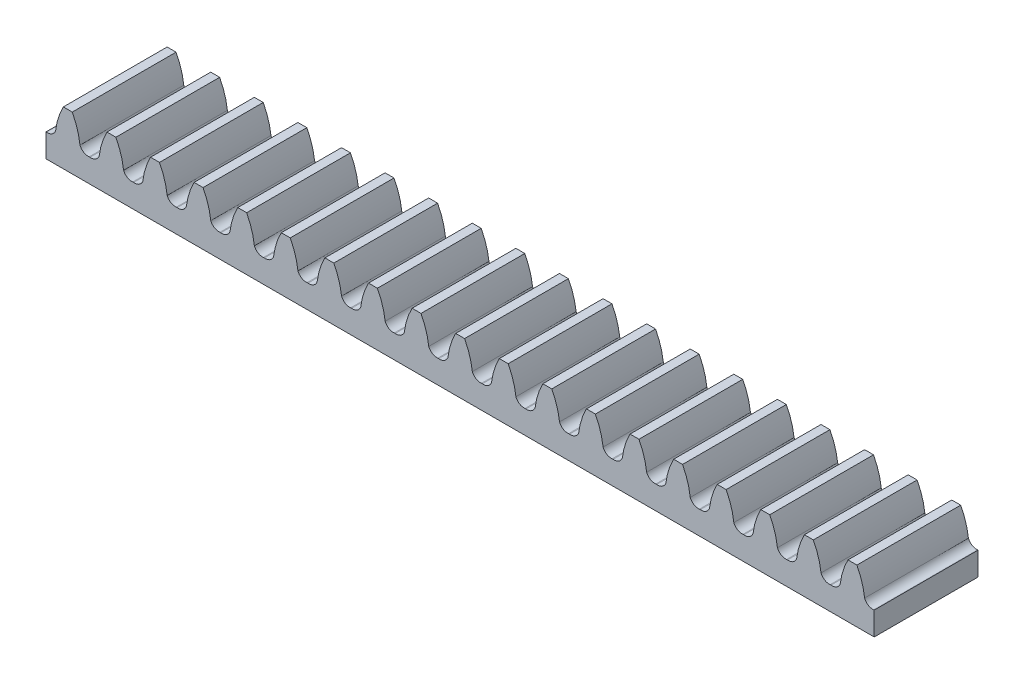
ISO-10303-21;
HEADER;
FILE_DESCRIPTION(('STEP AP214'),'2;1');
FILE_NAME('part.step','',(''),(''),'','','');
FILE_SCHEMA(('AUTOMOTIVE_DESIGN { 1 0 10303 214 1 1 1 1 }'));
ENDSEC;
DATA;
#1=APPLICATION_CONTEXT('core data for automotive mechanical design processes');
#2=APPLICATION_PROTOCOL_DEFINITION('international standard','automotive_design',2000,#1);
#3=PRODUCT_CONTEXT('',#1,'mechanical');
#4=PRODUCT('Part','Part','',(#3));
#5=PRODUCT_RELATED_PRODUCT_CATEGORY('part','',(#4));
#6=PRODUCT_DEFINITION_FORMATION('','',#4);
#7=PRODUCT_DEFINITION_CONTEXT('part definition',#1,'design');
#8=PRODUCT_DEFINITION('design','',#6,#7);
#9=PRODUCT_DEFINITION_SHAPE('','',#8);
#10=(LENGTH_UNIT() NAMED_UNIT(*) SI_UNIT(.MILLI.,.METRE.));
#11=(NAMED_UNIT(*) PLANE_ANGLE_UNIT() SI_UNIT($,.RADIAN.));
#12=(NAMED_UNIT(*) SI_UNIT($,.STERADIAN.) SOLID_ANGLE_UNIT());
#13=UNCERTAINTY_MEASURE_WITH_UNIT(LENGTH_MEASURE(1.E-05),#10,'distance_accuracy_value','');
#14=(GEOMETRIC_REPRESENTATION_CONTEXT(3) GLOBAL_UNCERTAINTY_ASSIGNED_CONTEXT((#13)) GLOBAL_UNIT_ASSIGNED_CONTEXT((#10,
#11,#12)) REPRESENTATION_CONTEXT('',''));
#15=CARTESIAN_POINT('',(0.,0.,0.));
#16=DIRECTION('',(0.,0.,1.));
#17=DIRECTION('',(1.,0.,0.));
#18=AXIS2_PLACEMENT_3D('',#15,#16,#17);
#19=CARTESIAN_POINT('',(-3.6129868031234E-13,8.99999999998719,40.));
#20=DIRECTION('',(0.,1.,0.));
#21=DIRECTION('',(-1.,0.,0.));
#22=AXIS2_PLACEMENT_3D('',#19,#20,#21);
#23=PLANE('',#22);
#24=DIRECTION('',(1.,0.,0.));
#25=VECTOR('',#24,1.);
#26=CARTESIAN_POINT('',(-3.6129868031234E-13,8.99999999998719,0.));
#27=LINE('',#26,#25);
#28=CARTESIAN_POINT('',(319.027151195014,8.99999999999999,0.));
#29=VERTEX_POINT('',#28);
#30=CARTESIAN_POINT('',(319.2,9.,0.));
#31=VERTEX_POINT('',#30);
#32=EDGE_CURVE('E796',#29,#31,#27,.T.);
#33=ORIENTED_EDGE('',*,*,#32,.F.);
#34=DIRECTION('',(0.,0.,-1.));
#35=VECTOR('',#34,1.);
#36=CARTESIAN_POINT('',(319.027151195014,8.99999999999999,40.));
#37=LINE('',#36,#35);
#38=CARTESIAN_POINT('',(319.027151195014,8.99999999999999,40.));
#39=VERTEX_POINT('',#38);
#40=EDGE_CURVE('E11',#39,#29,#37,.T.);
#41=ORIENTED_EDGE('',*,*,#40,.F.);
#42=DIRECTION('',(1.,0.,0.));
#43=VECTOR('',#42,1.);
#44=CARTESIAN_POINT('',(-3.6129868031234E-13,8.99999999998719,40.));
#45=LINE('',#44,#43);
#46=CARTESIAN_POINT('',(319.2,9.,40.));
#47=VERTEX_POINT('',#46);
#48=EDGE_CURVE('E1108',#39,#47,#45,.T.);
#49=ORIENTED_EDGE('',*,*,#48,.T.);
#50=DIRECTION('',(0.,0.,-1.));
#51=VECTOR('',#50,1.);
#52=CARTESIAN_POINT('',(319.2,9.,40.));
#53=LINE('',#52,#51);
#54=EDGE_CURVE('E421',#47,#31,#53,.T.);
#55=ORIENTED_EDGE('',*,*,#54,.T.);
#56=EDGE_LOOP('',(#33,#41,#49,#55));
#57=FACE_BOUND('',#56,.T.);
#58=ADVANCED_FACE('F41',(#57),#23,.T.);
#59=CARTESIAN_POINT('',(318.66,12.36,40.));
#60=DIRECTION('',(0.,0.,-1.));
#61=DIRECTION('',(-1.,0.,0.));
#62=AXIS2_PLACEMENT_3D('',#59,#60,#61);
#63=CYLINDRICAL_SURFACE('',#62,3.38000000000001);
#64=CARTESIAN_POINT('',(318.66,12.36,0.));
#65=DIRECTION('',(0.,0.,1.));
#66=DIRECTION('',(1.,0.,0.));
#67=AXIS2_PLACEMENT_3D('',#64,#65,#66);
#68=CIRCLE('',#67,3.38000000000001);
#69=CARTESIAN_POINT('',(315.510123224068,11.1341630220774,0.));
#70=VERTEX_POINT('',#69);
#71=EDGE_CURVE('E799',#29,#70,#68,.F.);
#72=ORIENTED_EDGE('',*,*,#71,.T.);
#73=DIRECTION('',(0.,0.,-1.));
#74=VECTOR('',#73,1.);
#75=CARTESIAN_POINT('',(315.510123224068,11.1341630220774,40.));
#76=LINE('',#75,#74);
#77=CARTESIAN_POINT('',(315.510123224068,11.1341630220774,40.));
#78=VERTEX_POINT('',#77);
#79=EDGE_CURVE('E49',#78,#70,#76,.T.);
#80=ORIENTED_EDGE('',*,*,#79,.F.);
#81=CARTESIAN_POINT('',(318.66,12.36,40.));
#82=DIRECTION('',(0.,0.,1.));
#83=DIRECTION('',(1.,0.,0.));
#84=AXIS2_PLACEMENT_3D('',#81,#82,#83);
#85=CIRCLE('',#84,3.38000000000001);
#86=EDGE_CURVE('E1683',#39,#78,#85,.F.);
#87=ORIENTED_EDGE('',*,*,#86,.F.);
#88=ORIENTED_EDGE('',*,*,#40,.T.);
#89=EDGE_LOOP('',(#72,#80,#87,#88));
#90=FACE_BOUND('',#89,.T.);
#91=ADVANCED_FACE('F1381',(#90),#63,.F.);
#92=CARTESIAN_POINT('',(288.57,7.92999999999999,40.));
#93=DIRECTION('',(0.,0.,-1.));
#94=DIRECTION('',(-1.,0.,0.));
#95=AXIS2_PLACEMENT_3D('',#92,#93,#94);
#96=CYLINDRICAL_SURFACE('',#95,27.13);
#97=CARTESIAN_POINT('',(288.57,7.92999999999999,0.));
#98=DIRECTION('',(0.,0.,1.));
#99=DIRECTION('',(1.,0.,0.));
#100=AXIS2_PLACEMENT_3D('',#97,#98,#99);
#101=CIRCLE('',#100,27.13);
#102=CARTESIAN_POINT('',(312.522188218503,20.67086259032,0.));
#103=VERTEX_POINT('',#102);
#104=EDGE_CURVE('E802',#103,#70,#101,.F.);
#105=ORIENTED_EDGE('',*,*,#104,.F.);
#106=DIRECTION('',(0.,0.,-1.));
#107=VECTOR('',#106,1.);
#108=CARTESIAN_POINT('',(312.522188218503,20.67086259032,40.));
#109=LINE('',#108,#107);
#110=CARTESIAN_POINT('',(312.522188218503,20.67086259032,40.));
#111=VERTEX_POINT('',#110);
#112=EDGE_CURVE('E1371',#111,#103,#109,.T.);
#113=ORIENTED_EDGE('',*,*,#112,.F.);
#114=CARTESIAN_POINT('',(288.57,7.92999999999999,40.));
#115=DIRECTION('',(0.,0.,1.));
#116=DIRECTION('',(1.,0.,0.));
#117=AXIS2_PLACEMENT_3D('',#114,#115,#116);
#118=CIRCLE('',#117,27.13);
#119=EDGE_CURVE('E1378',#111,#78,#118,.F.);
#120=ORIENTED_EDGE('',*,*,#119,.T.);
#121=ORIENTED_EDGE('',*,*,#79,.T.);
#122=EDGE_LOOP('',(#105,#113,#120,#121));
#123=FACE_BOUND('',#122,.T.);
#124=ADVANCED_FACE('F1376',(#123),#96,.T.);
#125=CARTESIAN_POINT('',(310.8,-56.81,40.));
#126=DIRECTION('',(0.,0.,-1.));
#127=DIRECTION('',(-1.,0.,0.));
#128=AXIS2_PLACEMENT_3D('',#125,#126,#127);
#129=CYLINDRICAL_SURFACE('',#128,77.5);
#130=CARTESIAN_POINT('',(310.8,-56.81,0.));
#131=DIRECTION('',(0.,0.,1.));
#132=DIRECTION('',(1.,0.,0.));
#133=AXIS2_PLACEMENT_3D('',#130,#131,#132);
#134=CIRCLE('',#133,77.5);
#135=CARTESIAN_POINT('',(309.077811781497,20.67086259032,0.));
#136=VERTEX_POINT('',#135);
#137=EDGE_CURVE('E805',#103,#136,#134,.T.);
#138=ORIENTED_EDGE('',*,*,#137,.T.);
#139=DIRECTION('',(0.,0.,-1.));
#140=VECTOR('',#139,1.);
#141=CARTESIAN_POINT('',(309.077811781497,20.67086259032,40.));
#142=LINE('',#141,#140);
#143=CARTESIAN_POINT('',(309.077811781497,20.67086259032,40.));
#144=VERTEX_POINT('',#143);
#145=EDGE_CURVE('E1368',#144,#136,#142,.T.);
#146=ORIENTED_EDGE('',*,*,#145,.F.);
#147=CARTESIAN_POINT('',(310.8,-56.81,40.));
#148=DIRECTION('',(0.,0.,1.));
#149=DIRECTION('',(1.,0.,0.));
#150=AXIS2_PLACEMENT_3D('',#147,#148,#149);
#151=CIRCLE('',#150,77.5);
#152=EDGE_CURVE('E1398',#111,#144,#151,.T.);
#153=ORIENTED_EDGE('',*,*,#152,.F.);
#154=ORIENTED_EDGE('',*,*,#112,.T.);
#155=EDGE_LOOP('',(#138,#146,#153,#154));
#156=FACE_BOUND('',#155,.T.);
#157=ADVANCED_FACE('F1388',(#156),#129,.T.);
#158=CARTESIAN_POINT('',(333.03,7.93,40.));
#159=DIRECTION('',(0.,0.,-1.));
#160=DIRECTION('',(-1.,0.,0.));
#161=AXIS2_PLACEMENT_3D('',#158,#159,#160);
#162=CYLINDRICAL_SURFACE('',#161,27.13);
#163=CARTESIAN_POINT('',(333.03,7.93,0.));
#164=DIRECTION('',(0.,0.,1.));
#165=DIRECTION('',(1.,0.,0.));
#166=AXIS2_PLACEMENT_3D('',#163,#164,#165);
#167=CIRCLE('',#166,27.13);
#168=CARTESIAN_POINT('',(306.089876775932,11.1341630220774,0.));
#169=VERTEX_POINT('',#168);
#170=EDGE_CURVE('E807',#136,#169,#167,.T.);
#171=ORIENTED_EDGE('',*,*,#170,.T.);
#172=DIRECTION('',(0.,0.,-1.));
#173=VECTOR('',#172,1.);
#174=CARTESIAN_POINT('',(306.089876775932,11.1341630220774,40.));
#175=LINE('',#174,#173);
#176=CARTESIAN_POINT('',(306.089876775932,11.1341630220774,40.));
#177=VERTEX_POINT('',#176);
#178=EDGE_CURVE('E1366',#177,#169,#175,.T.);
#179=ORIENTED_EDGE('',*,*,#178,.F.);
#180=CARTESIAN_POINT('',(333.03,7.93,40.));
#181=DIRECTION('',(0.,0.,1.));
#182=DIRECTION('',(1.,0.,0.));
#183=AXIS2_PLACEMENT_3D('',#180,#181,#182);
#184=CIRCLE('',#183,27.13);
#185=EDGE_CURVE('E1394',#144,#177,#184,.T.);
#186=ORIENTED_EDGE('',*,*,#185,.F.);
#187=ORIENTED_EDGE('',*,*,#145,.T.);
#188=EDGE_LOOP('',(#171,#179,#186,#187));
#189=FACE_BOUND('',#188,.T.);
#190=ADVANCED_FACE('F1392',(#189),#162,.T.);
#191=CARTESIAN_POINT('',(302.94,12.36,40.));
#192=DIRECTION('',(0.,0.,-1.));
#193=DIRECTION('',(-1.,0.,0.));
#194=AXIS2_PLACEMENT_3D('',#191,#192,#193);
#195=CYLINDRICAL_SURFACE('',#194,3.38000000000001);
#196=CARTESIAN_POINT('',(302.94,12.36,0.));
#197=DIRECTION('',(0.,0.,1.));
#198=DIRECTION('',(1.,0.,0.));
#199=AXIS2_PLACEMENT_3D('',#196,#197,#198);
#200=CIRCLE('',#199,3.38000000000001);
#201=CARTESIAN_POINT('',(302.572848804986,9.,0.));
#202=VERTEX_POINT('',#201);
#203=EDGE_CURVE('E810',#202,#169,#200,.T.);
#204=ORIENTED_EDGE('',*,*,#203,.F.);
#205=DIRECTION('',(0.,0.,-1.));
#206=VECTOR('',#205,1.);
#207=CARTESIAN_POINT('',(302.572848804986,9.,40.));
#208=LINE('',#207,#206);
#209=CARTESIAN_POINT('',(302.572848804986,9.,40.));
#210=VERTEX_POINT('',#209);
#211=EDGE_CURVE('E1364',#210,#202,#208,.T.);
#212=ORIENTED_EDGE('',*,*,#211,.F.);
#213=CARTESIAN_POINT('',(302.94,12.36,40.));
#214=DIRECTION('',(0.,0.,1.));
#215=DIRECTION('',(1.,0.,0.));
#216=AXIS2_PLACEMENT_3D('',#213,#214,#215);
#217=CIRCLE('',#216,3.38000000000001);
#218=EDGE_CURVE('E1397',#210,#177,#217,.T.);
#219=ORIENTED_EDGE('',*,*,#218,.T.);
#220=ORIENTED_EDGE('',*,*,#178,.T.);
#221=EDGE_LOOP('',(#204,#212,#219,#220));
#222=FACE_BOUND('',#221,.T.);
#223=ADVANCED_FACE('F2814',(#222),#195,.F.);
#224=CARTESIAN_POINT('',(-3.61298680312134E-13,8.99999999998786,40.));
#225=DIRECTION('',(0.,-1.,0.));
#226=DIRECTION('',(1.,0.,0.));
#227=AXIS2_PLACEMENT_3D('',#224,#225,#226);
#228=PLANE('',#227);
#229=DIRECTION('',(-1.,0.,0.));
#230=VECTOR('',#229,1.);
#231=CARTESIAN_POINT('',(-3.61298680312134E-13,8.99999999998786,0.));
#232=LINE('',#231,#230);
#233=CARTESIAN_POINT('',(302.227151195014,8.99999999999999,0.));
#234=VERTEX_POINT('',#233);
#235=EDGE_CURVE('E813',#202,#234,#232,.T.);
#236=ORIENTED_EDGE('',*,*,#235,.T.);
#237=DIRECTION('',(0.,0.,-1.));
#238=VECTOR('',#237,1.);
#239=CARTESIAN_POINT('',(302.227151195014,8.99999999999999,40.));
#240=LINE('',#239,#238);
#241=CARTESIAN_POINT('',(302.227151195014,8.99999999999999,40.));
#242=VERTEX_POINT('',#241);
#243=EDGE_CURVE('E1361',#242,#234,#240,.T.);
#244=ORIENTED_EDGE('',*,*,#243,.F.);
#245=DIRECTION('',(-1.,0.,0.));
#246=VECTOR('',#245,1.);
#247=CARTESIAN_POINT('',(-3.61298680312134E-13,8.99999999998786,40.));
#248=LINE('',#247,#246);
#249=EDGE_CURVE('E1400',#210,#242,#248,.T.);
#250=ORIENTED_EDGE('',*,*,#249,.F.);
#251=ORIENTED_EDGE('',*,*,#211,.T.);
#252=EDGE_LOOP('',(#236,#244,#250,#251));
#253=FACE_BOUND('',#252,.T.);
#254=ADVANCED_FACE('F2804',(#253),#228,.F.);
#255=CARTESIAN_POINT('',(301.86,12.36,40.));
#256=DIRECTION('',(0.,0.,-1.));
#257=DIRECTION('',(-1.,0.,0.));
#258=AXIS2_PLACEMENT_3D('',#255,#256,#257);
#259=CYLINDRICAL_SURFACE('',#258,3.38000000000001);
#260=CARTESIAN_POINT('',(301.86,12.36,0.));
#261=DIRECTION('',(0.,0.,1.));
#262=DIRECTION('',(1.,0.,0.));
#263=AXIS2_PLACEMENT_3D('',#260,#261,#262);
#264=CIRCLE('',#263,3.38000000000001);
#265=CARTESIAN_POINT('',(298.710123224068,11.1341630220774,0.));
#266=VERTEX_POINT('',#265);
#267=EDGE_CURVE('E815',#234,#266,#264,.F.);
#268=ORIENTED_EDGE('',*,*,#267,.T.);
#269=DIRECTION('',(0.,0.,-1.));
#270=VECTOR('',#269,1.);
#271=CARTESIAN_POINT('',(298.710123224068,11.1341630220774,40.));
#272=LINE('',#271,#270);
#273=CARTESIAN_POINT('',(298.710123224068,11.1341630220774,40.));
#274=VERTEX_POINT('',#273);
#275=EDGE_CURVE('E1359',#274,#266,#272,.T.);
#276=ORIENTED_EDGE('',*,*,#275,.F.);
#277=CARTESIAN_POINT('',(301.86,12.36,40.));
#278=DIRECTION('',(0.,0.,1.));
#279=DIRECTION('',(1.,0.,0.));
#280=AXIS2_PLACEMENT_3D('',#277,#278,#279);
#281=CIRCLE('',#280,3.38000000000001);
#282=EDGE_CURVE('E1406',#242,#274,#281,.F.);
#283=ORIENTED_EDGE('',*,*,#282,.F.);
#284=ORIENTED_EDGE('',*,*,#243,.T.);
#285=EDGE_LOOP('',(#268,#276,#283,#284));
#286=FACE_BOUND('',#285,.T.);
#287=ADVANCED_FACE('F2794',(#286),#259,.F.);
#288=CARTESIAN_POINT('',(271.77,7.92999999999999,40.));
#289=DIRECTION('',(0.,0.,-1.));
#290=DIRECTION('',(-1.,0.,0.));
#291=AXIS2_PLACEMENT_3D('',#288,#289,#290);
#292=CYLINDRICAL_SURFACE('',#291,27.13);
#293=CARTESIAN_POINT('',(271.77,7.92999999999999,0.));
#294=DIRECTION('',(0.,0.,1.));
#295=DIRECTION('',(1.,0.,0.));
#296=AXIS2_PLACEMENT_3D('',#293,#294,#295);
#297=CIRCLE('',#296,27.13);
#298=CARTESIAN_POINT('',(295.722188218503,20.67086259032,0.));
#299=VERTEX_POINT('',#298);
#300=EDGE_CURVE('E818',#299,#266,#297,.F.);
#301=ORIENTED_EDGE('',*,*,#300,.F.);
#302=DIRECTION('',(0.,0.,-1.));
#303=VECTOR('',#302,1.);
#304=CARTESIAN_POINT('',(295.722188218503,20.67086259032,40.));
#305=LINE('',#304,#303);
#306=CARTESIAN_POINT('',(295.722188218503,20.67086259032,40.));
#307=VERTEX_POINT('',#306);
#308=EDGE_CURVE('E1357',#307,#299,#305,.T.);
#309=ORIENTED_EDGE('',*,*,#308,.F.);
#310=CARTESIAN_POINT('',(271.77,7.92999999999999,40.));
#311=DIRECTION('',(0.,0.,1.));
#312=DIRECTION('',(1.,0.,0.));
#313=AXIS2_PLACEMENT_3D('',#310,#311,#312);
#314=CIRCLE('',#313,27.13);
#315=EDGE_CURVE('E1408',#307,#274,#314,.F.);
#316=ORIENTED_EDGE('',*,*,#315,.T.);
#317=ORIENTED_EDGE('',*,*,#275,.T.);
#318=EDGE_LOOP('',(#301,#309,#316,#317));
#319=FACE_BOUND('',#318,.T.);
#320=ADVANCED_FACE('F2784',(#319),#292,.T.);
#321=CARTESIAN_POINT('',(294.,-56.81,40.));
#322=DIRECTION('',(0.,0.,-1.));
#323=DIRECTION('',(-1.,0.,0.));
#324=AXIS2_PLACEMENT_3D('',#321,#322,#323);
#325=CYLINDRICAL_SURFACE('',#324,77.5);
#326=CARTESIAN_POINT('',(294.,-56.81,0.));
#327=DIRECTION('',(0.,0.,1.));
#328=DIRECTION('',(1.,0.,0.));
#329=AXIS2_PLACEMENT_3D('',#326,#327,#328);
#330=CIRCLE('',#329,77.5);
#331=CARTESIAN_POINT('',(292.277811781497,20.67086259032,0.));
#332=VERTEX_POINT('',#331);
#333=EDGE_CURVE('E821',#299,#332,#330,.T.);
#334=ORIENTED_EDGE('',*,*,#333,.T.);
#335=DIRECTION('',(0.,0.,-1.));
#336=VECTOR('',#335,1.);
#337=CARTESIAN_POINT('',(292.277811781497,20.67086259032,40.));
#338=LINE('',#337,#336);
#339=CARTESIAN_POINT('',(292.277811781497,20.67086259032,40.));
#340=VERTEX_POINT('',#339);
#341=EDGE_CURVE('E1354',#340,#332,#338,.T.);
#342=ORIENTED_EDGE('',*,*,#341,.F.);
#343=CARTESIAN_POINT('',(294.,-56.81,40.));
#344=DIRECTION('',(0.,0.,1.));
#345=DIRECTION('',(1.,0.,0.));
#346=AXIS2_PLACEMENT_3D('',#343,#344,#345);
#347=CIRCLE('',#346,77.5);
#348=EDGE_CURVE('E1411',#307,#340,#347,.T.);
#349=ORIENTED_EDGE('',*,*,#348,.F.);
#350=ORIENTED_EDGE('',*,*,#308,.T.);
#351=EDGE_LOOP('',(#334,#342,#349,#350));
#352=FACE_BOUND('',#351,.T.);
#353=ADVANCED_FACE('F2774',(#352),#325,.T.);
#354=CARTESIAN_POINT('',(316.23,7.93,40.));
#355=DIRECTION('',(0.,0.,-1.));
#356=DIRECTION('',(-1.,0.,0.));
#357=AXIS2_PLACEMENT_3D('',#354,#355,#356);
#358=CYLINDRICAL_SURFACE('',#357,27.13);
#359=CARTESIAN_POINT('',(316.23,7.93,0.));
#360=DIRECTION('',(0.,0.,1.));
#361=DIRECTION('',(1.,0.,0.));
#362=AXIS2_PLACEMENT_3D('',#359,#360,#361);
#363=CIRCLE('',#362,27.13);
#364=CARTESIAN_POINT('',(289.289876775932,11.1341630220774,0.));
#365=VERTEX_POINT('',#364);
#366=EDGE_CURVE('E823',#332,#365,#363,.T.);
#367=ORIENTED_EDGE('',*,*,#366,.T.);
#368=DIRECTION('',(0.,0.,-1.));
#369=VECTOR('',#368,1.);
#370=CARTESIAN_POINT('',(289.289876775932,11.1341630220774,40.));
#371=LINE('',#370,#369);
#372=CARTESIAN_POINT('',(289.289876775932,11.1341630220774,40.));
#373=VERTEX_POINT('',#372);
#374=EDGE_CURVE('E1352',#373,#365,#371,.T.);
#375=ORIENTED_EDGE('',*,*,#374,.F.);
#376=CARTESIAN_POINT('',(316.23,7.93,40.));
#377=DIRECTION('',(0.,0.,1.));
#378=DIRECTION('',(1.,0.,0.));
#379=AXIS2_PLACEMENT_3D('',#376,#377,#378);
#380=CIRCLE('',#379,27.13);
#381=EDGE_CURVE('E1413',#340,#373,#380,.T.);
#382=ORIENTED_EDGE('',*,*,#381,.F.);
#383=ORIENTED_EDGE('',*,*,#341,.T.);
#384=EDGE_LOOP('',(#367,#375,#382,#383));
#385=FACE_BOUND('',#384,.T.);
#386=ADVANCED_FACE('F2764',(#385),#358,.T.);
#387=CARTESIAN_POINT('',(286.14,12.36,40.));
#388=DIRECTION('',(0.,0.,-1.));
#389=DIRECTION('',(-1.,0.,0.));
#390=AXIS2_PLACEMENT_3D('',#387,#388,#389);
#391=CYLINDRICAL_SURFACE('',#390,3.38000000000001);
#392=CARTESIAN_POINT('',(286.14,12.36,0.));
#393=DIRECTION('',(0.,0.,1.));
#394=DIRECTION('',(1.,0.,0.));
#395=AXIS2_PLACEMENT_3D('',#392,#393,#394);
#396=CIRCLE('',#395,3.38000000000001);
#397=CARTESIAN_POINT('',(285.772848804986,9.,0.));
#398=VERTEX_POINT('',#397);
#399=EDGE_CURVE('E826',#398,#365,#396,.T.);
#400=ORIENTED_EDGE('',*,*,#399,.F.);
#401=DIRECTION('',(0.,0.,-1.));
#402=VECTOR('',#401,1.);
#403=CARTESIAN_POINT('',(285.772848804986,9.,40.));
#404=LINE('',#403,#402);
#405=CARTESIAN_POINT('',(285.772848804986,9.,40.));
#406=VERTEX_POINT('',#405);
#407=EDGE_CURVE('E1350',#406,#398,#404,.T.);
#408=ORIENTED_EDGE('',*,*,#407,.F.);
#409=CARTESIAN_POINT('',(286.14,12.36,40.));
#410=DIRECTION('',(0.,0.,1.));
#411=DIRECTION('',(1.,0.,0.));
#412=AXIS2_PLACEMENT_3D('',#409,#410,#411);
#413=CIRCLE('',#412,3.38000000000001);
#414=EDGE_CURVE('E1415',#406,#373,#413,.T.);
#415=ORIENTED_EDGE('',*,*,#414,.T.);
#416=ORIENTED_EDGE('',*,*,#374,.T.);
#417=EDGE_LOOP('',(#400,#408,#415,#416));
#418=FACE_BOUND('',#417,.T.);
#419=ADVANCED_FACE('F2753',(#418),#391,.F.);
#420=CARTESIAN_POINT('',(-3.61298680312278E-13,8.99999999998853,40.));
#421=DIRECTION('',(0.,-1.,0.));
#422=DIRECTION('',(1.,0.,0.));
#423=AXIS2_PLACEMENT_3D('',#420,#421,#422);
#424=PLANE('',#423);
#425=DIRECTION('',(-1.,0.,0.));
#426=VECTOR('',#425,1.);
#427=CARTESIAN_POINT('',(-3.61298680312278E-13,8.99999999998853,0.));
#428=LINE('',#427,#426);
#429=CARTESIAN_POINT('',(285.427151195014,8.99999999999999,0.));
#430=VERTEX_POINT('',#429);
#431=EDGE_CURVE('E829',#398,#430,#428,.T.);
#432=ORIENTED_EDGE('',*,*,#431,.T.);
#433=DIRECTION('',(0.,0.,-1.));
#434=VECTOR('',#433,1.);
#435=CARTESIAN_POINT('',(285.427151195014,8.99999999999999,40.));
#436=LINE('',#435,#434);
#437=CARTESIAN_POINT('',(285.427151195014,8.99999999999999,40.));
#438=VERTEX_POINT('',#437);
#439=EDGE_CURVE('E1347',#438,#430,#436,.T.);
#440=ORIENTED_EDGE('',*,*,#439,.F.);
#441=DIRECTION('',(-1.,0.,0.));
#442=VECTOR('',#441,1.);
#443=CARTESIAN_POINT('',(-3.61298680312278E-13,8.99999999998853,40.));
#444=LINE('',#443,#442);
#445=EDGE_CURVE('E1418',#406,#438,#444,.T.);
#446=ORIENTED_EDGE('',*,*,#445,.F.);
#447=ORIENTED_EDGE('',*,*,#407,.T.);
#448=EDGE_LOOP('',(#432,#440,#446,#447));
#449=FACE_BOUND('',#448,.T.);
#450=ADVANCED_FACE('F2743',(#449),#424,.F.);
#451=CARTESIAN_POINT('',(285.06,12.36,40.));
#452=DIRECTION('',(0.,0.,-1.));
#453=DIRECTION('',(-1.,0.,0.));
#454=AXIS2_PLACEMENT_3D('',#451,#452,#453);
#455=CYLINDRICAL_SURFACE('',#454,3.38000000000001);
#456=CARTESIAN_POINT('',(285.06,12.36,0.));
#457=DIRECTION('',(0.,0.,1.));
#458=DIRECTION('',(1.,0.,0.));
#459=AXIS2_PLACEMENT_3D('',#456,#457,#458);
#460=CIRCLE('',#459,3.38000000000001);
#461=CARTESIAN_POINT('',(281.910123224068,11.1341630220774,0.));
#462=VERTEX_POINT('',#461);
#463=EDGE_CURVE('E831',#430,#462,#460,.F.);
#464=ORIENTED_EDGE('',*,*,#463,.T.);
#465=DIRECTION('',(0.,0.,-1.));
#466=VECTOR('',#465,1.);
#467=CARTESIAN_POINT('',(281.910123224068,11.1341630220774,40.));
#468=LINE('',#467,#466);
#469=CARTESIAN_POINT('',(281.910123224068,11.1341630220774,40.));
#470=VERTEX_POINT('',#469);
#471=EDGE_CURVE('E1345',#470,#462,#468,.T.);
#472=ORIENTED_EDGE('',*,*,#471,.F.);
#473=CARTESIAN_POINT('',(285.06,12.36,40.));
#474=DIRECTION('',(0.,0.,1.));
#475=DIRECTION('',(1.,0.,0.));
#476=AXIS2_PLACEMENT_3D('',#473,#474,#475);
#477=CIRCLE('',#476,3.38000000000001);
#478=EDGE_CURVE('E1420',#438,#470,#477,.F.);
#479=ORIENTED_EDGE('',*,*,#478,.F.);
#480=ORIENTED_EDGE('',*,*,#439,.T.);
#481=EDGE_LOOP('',(#464,#472,#479,#480));
#482=FACE_BOUND('',#481,.T.);
#483=ADVANCED_FACE('F2733',(#482),#455,.F.);
#484=CARTESIAN_POINT('',(254.97,7.92999999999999,40.));
#485=DIRECTION('',(0.,0.,-1.));
#486=DIRECTION('',(-1.,0.,0.));
#487=AXIS2_PLACEMENT_3D('',#484,#485,#486);
#488=CYLINDRICAL_SURFACE('',#487,27.13);
#489=CARTESIAN_POINT('',(254.97,7.92999999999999,0.));
#490=DIRECTION('',(0.,0.,1.));
#491=DIRECTION('',(1.,0.,0.));
#492=AXIS2_PLACEMENT_3D('',#489,#490,#491);
#493=CIRCLE('',#492,27.13);
#494=CARTESIAN_POINT('',(278.922188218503,20.67086259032,0.));
#495=VERTEX_POINT('',#494);
#496=EDGE_CURVE('E834',#495,#462,#493,.F.);
#497=ORIENTED_EDGE('',*,*,#496,.F.);
#498=DIRECTION('',(0.,0.,-1.));
#499=VECTOR('',#498,1.);
#500=CARTESIAN_POINT('',(278.922188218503,20.67086259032,40.));
#501=LINE('',#500,#499);
#502=CARTESIAN_POINT('',(278.922188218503,20.67086259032,40.));
#503=VERTEX_POINT('',#502);
#504=EDGE_CURVE('E1343',#503,#495,#501,.T.);
#505=ORIENTED_EDGE('',*,*,#504,.F.);
#506=CARTESIAN_POINT('',(254.97,7.92999999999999,40.));
#507=DIRECTION('',(0.,0.,1.));
#508=DIRECTION('',(1.,0.,0.));
#509=AXIS2_PLACEMENT_3D('',#506,#507,#508);
#510=CIRCLE('',#509,27.13);
#511=EDGE_CURVE('E1422',#503,#470,#510,.F.);
#512=ORIENTED_EDGE('',*,*,#511,.T.);
#513=ORIENTED_EDGE('',*,*,#471,.T.);
#514=EDGE_LOOP('',(#497,#505,#512,#513));
#515=FACE_BOUND('',#514,.T.);
#516=ADVANCED_FACE('F2723',(#515),#488,.T.);
#517=CARTESIAN_POINT('',(277.2,-56.81,40.));
#518=DIRECTION('',(0.,0.,-1.));
#519=DIRECTION('',(-1.,0.,0.));
#520=AXIS2_PLACEMENT_3D('',#517,#518,#519);
#521=CYLINDRICAL_SURFACE('',#520,77.5);
#522=CARTESIAN_POINT('',(277.2,-56.81,0.));
#523=DIRECTION('',(0.,0.,1.));
#524=DIRECTION('',(1.,0.,0.));
#525=AXIS2_PLACEMENT_3D('',#522,#523,#524);
#526=CIRCLE('',#525,77.5);
#527=CARTESIAN_POINT('',(275.477811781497,20.67086259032,0.));
#528=VERTEX_POINT('',#527);
#529=EDGE_CURVE('E837',#495,#528,#526,.T.);
#530=ORIENTED_EDGE('',*,*,#529,.T.);
#531=DIRECTION('',(0.,0.,-1.));
#532=VECTOR('',#531,1.);
#533=CARTESIAN_POINT('',(275.477811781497,20.67086259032,40.));
#534=LINE('',#533,#532);
#535=CARTESIAN_POINT('',(275.477811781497,20.67086259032,40.));
#536=VERTEX_POINT('',#535);
#537=EDGE_CURVE('E1340',#536,#528,#534,.T.);
#538=ORIENTED_EDGE('',*,*,#537,.F.);
#539=CARTESIAN_POINT('',(277.2,-56.81,40.));
#540=DIRECTION('',(0.,0.,1.));
#541=DIRECTION('',(1.,0.,0.));
#542=AXIS2_PLACEMENT_3D('',#539,#540,#541);
#543=CIRCLE('',#542,77.5);
#544=EDGE_CURVE('E1425',#503,#536,#543,.T.);
#545=ORIENTED_EDGE('',*,*,#544,.F.);
#546=ORIENTED_EDGE('',*,*,#504,.T.);
#547=EDGE_LOOP('',(#530,#538,#545,#546));
#548=FACE_BOUND('',#547,.T.);
#549=ADVANCED_FACE('F2713',(#548),#521,.T.);
#550=CARTESIAN_POINT('',(299.43,7.93,40.));
#551=DIRECTION('',(0.,0.,-1.));
#552=DIRECTION('',(-1.,0.,0.));
#553=AXIS2_PLACEMENT_3D('',#550,#551,#552);
#554=CYLINDRICAL_SURFACE('',#553,27.13);
#555=CARTESIAN_POINT('',(299.43,7.93,0.));
#556=DIRECTION('',(0.,0.,1.));
#557=DIRECTION('',(1.,0.,0.));
#558=AXIS2_PLACEMENT_3D('',#555,#556,#557);
#559=CIRCLE('',#558,27.13);
#560=CARTESIAN_POINT('',(272.489876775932,11.1341630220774,0.));
#561=VERTEX_POINT('',#560);
#562=EDGE_CURVE('E839',#528,#561,#559,.T.);
#563=ORIENTED_EDGE('',*,*,#562,.T.);
#564=DIRECTION('',(0.,0.,-1.));
#565=VECTOR('',#564,1.);
#566=CARTESIAN_POINT('',(272.489876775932,11.1341630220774,40.));
#567=LINE('',#566,#565);
#568=CARTESIAN_POINT('',(272.489876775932,11.1341630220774,40.));
#569=VERTEX_POINT('',#568);
#570=EDGE_CURVE('E1338',#569,#561,#567,.T.);
#571=ORIENTED_EDGE('',*,*,#570,.F.);
#572=CARTESIAN_POINT('',(299.43,7.93,40.));
#573=DIRECTION('',(0.,0.,1.));
#574=DIRECTION('',(1.,0.,0.));
#575=AXIS2_PLACEMENT_3D('',#572,#573,#574);
#576=CIRCLE('',#575,27.13);
#577=EDGE_CURVE('E1427',#536,#569,#576,.T.);
#578=ORIENTED_EDGE('',*,*,#577,.F.);
#579=ORIENTED_EDGE('',*,*,#537,.T.);
#580=EDGE_LOOP('',(#563,#571,#578,#579));
#581=FACE_BOUND('',#580,.T.);
#582=ADVANCED_FACE('F2703',(#581),#554,.T.);
#583=CARTESIAN_POINT('',(269.34,12.36,40.));
#584=DIRECTION('',(0.,0.,-1.));
#585=DIRECTION('',(-1.,0.,0.));
#586=AXIS2_PLACEMENT_3D('',#583,#584,#585);
#587=CYLINDRICAL_SURFACE('',#586,3.38000000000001);
#588=CARTESIAN_POINT('',(269.34,12.36,0.));
#589=DIRECTION('',(0.,0.,1.));
#590=DIRECTION('',(1.,0.,0.));
#591=AXIS2_PLACEMENT_3D('',#588,#589,#590);
#592=CIRCLE('',#591,3.38000000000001);
#593=CARTESIAN_POINT('',(268.972848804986,9.,0.));
#594=VERTEX_POINT('',#593);
#595=EDGE_CURVE('E842',#594,#561,#592,.T.);
#596=ORIENTED_EDGE('',*,*,#595,.F.);
#597=DIRECTION('',(0.,0.,-1.));
#598=VECTOR('',#597,1.);
#599=CARTESIAN_POINT('',(268.972848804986,9.,40.));
#600=LINE('',#599,#598);
#601=CARTESIAN_POINT('',(268.972848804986,9.,40.));
#602=VERTEX_POINT('',#601);
#603=EDGE_CURVE('E1336',#602,#594,#600,.T.);
#604=ORIENTED_EDGE('',*,*,#603,.F.);
#605=CARTESIAN_POINT('',(269.34,12.36,40.));
#606=DIRECTION('',(0.,0.,1.));
#607=DIRECTION('',(1.,0.,0.));
#608=AXIS2_PLACEMENT_3D('',#605,#606,#607);
#609=CIRCLE('',#608,3.38000000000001);
#610=EDGE_CURVE('E1429',#602,#569,#609,.T.);
#611=ORIENTED_EDGE('',*,*,#610,.T.);
#612=ORIENTED_EDGE('',*,*,#570,.T.);
#613=EDGE_LOOP('',(#596,#604,#611,#612));
#614=FACE_BOUND('',#613,.T.);
#615=ADVANCED_FACE('F2692',(#614),#587,.F.);
#616=CARTESIAN_POINT('',(-3.61298680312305E-13,8.9999999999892,40.));
#617=DIRECTION('',(0.,-1.,0.));
#618=DIRECTION('',(1.,0.,0.));
#619=AXIS2_PLACEMENT_3D('',#616,#617,#618);
#620=PLANE('',#619);
#621=DIRECTION('',(-1.,0.,0.));
#622=VECTOR('',#621,1.);
#623=CARTESIAN_POINT('',(-3.61298680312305E-13,8.9999999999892,0.));
#624=LINE('',#623,#622);
#625=CARTESIAN_POINT('',(268.627151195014,8.99999999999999,0.));
#626=VERTEX_POINT('',#625);
#627=EDGE_CURVE('E845',#594,#626,#624,.T.);
#628=ORIENTED_EDGE('',*,*,#627,.T.);
#629=DIRECTION('',(0.,0.,-1.));
#630=VECTOR('',#629,1.);
#631=CARTESIAN_POINT('',(268.627151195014,8.99999999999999,40.));
#632=LINE('',#631,#630);
#633=CARTESIAN_POINT('',(268.627151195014,8.99999999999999,40.));
#634=VERTEX_POINT('',#633);
#635=EDGE_CURVE('E1333',#634,#626,#632,.T.);
#636=ORIENTED_EDGE('',*,*,#635,.F.);
#637=DIRECTION('',(-1.,0.,0.));
#638=VECTOR('',#637,1.);
#639=CARTESIAN_POINT('',(-3.61298680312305E-13,8.9999999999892,40.));
#640=LINE('',#639,#638);
#641=EDGE_CURVE('E1432',#602,#634,#640,.T.);
#642=ORIENTED_EDGE('',*,*,#641,.F.);
#643=ORIENTED_EDGE('',*,*,#603,.T.);
#644=EDGE_LOOP('',(#628,#636,#642,#643));
#645=FACE_BOUND('',#644,.T.);
#646=ADVANCED_FACE('F2682',(#645),#620,.F.);
#647=CARTESIAN_POINT('',(268.26,12.36,40.));
#648=DIRECTION('',(0.,0.,-1.));
#649=DIRECTION('',(-1.,0.,0.));
#650=AXIS2_PLACEMENT_3D('',#647,#648,#649);
#651=CYLINDRICAL_SURFACE('',#650,3.38000000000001);
#652=CARTESIAN_POINT('',(268.26,12.36,0.));
#653=DIRECTION('',(0.,0.,1.));
#654=DIRECTION('',(1.,0.,0.));
#655=AXIS2_PLACEMENT_3D('',#652,#653,#654);
#656=CIRCLE('',#655,3.38000000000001);
#657=CARTESIAN_POINT('',(265.110123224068,11.1341630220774,0.));
#658=VERTEX_POINT('',#657);
#659=EDGE_CURVE('E847',#626,#658,#656,.F.);
#660=ORIENTED_EDGE('',*,*,#659,.T.);
#661=DIRECTION('',(0.,0.,-1.));
#662=VECTOR('',#661,1.);
#663=CARTESIAN_POINT('',(265.110123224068,11.1341630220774,40.));
#664=LINE('',#663,#662);
#665=CARTESIAN_POINT('',(265.110123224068,11.1341630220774,40.));
#666=VERTEX_POINT('',#665);
#667=EDGE_CURVE('E1331',#666,#658,#664,.T.);
#668=ORIENTED_EDGE('',*,*,#667,.F.);
#669=CARTESIAN_POINT('',(268.26,12.36,40.));
#670=DIRECTION('',(0.,0.,1.));
#671=DIRECTION('',(1.,0.,0.));
#672=AXIS2_PLACEMENT_3D('',#669,#670,#671);
#673=CIRCLE('',#672,3.38000000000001);
#674=EDGE_CURVE('E1434',#634,#666,#673,.F.);
#675=ORIENTED_EDGE('',*,*,#674,.F.);
#676=ORIENTED_EDGE('',*,*,#635,.T.);
#677=EDGE_LOOP('',(#660,#668,#675,#676));
#678=FACE_BOUND('',#677,.T.);
#679=ADVANCED_FACE('F2672',(#678),#651,.F.);
#680=CARTESIAN_POINT('',(238.17,7.92999999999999,40.));
#681=DIRECTION('',(0.,0.,-1.));
#682=DIRECTION('',(-1.,0.,0.));
#683=AXIS2_PLACEMENT_3D('',#680,#681,#682);
#684=CYLINDRICAL_SURFACE('',#683,27.13);
#685=CARTESIAN_POINT('',(238.17,7.92999999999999,0.));
#686=DIRECTION('',(0.,0.,1.));
#687=DIRECTION('',(1.,0.,0.));
#688=AXIS2_PLACEMENT_3D('',#685,#686,#687);
#689=CIRCLE('',#688,27.13);
#690=CARTESIAN_POINT('',(262.122188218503,20.67086259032,0.));
#691=VERTEX_POINT('',#690);
#692=EDGE_CURVE('E850',#691,#658,#689,.F.);
#693=ORIENTED_EDGE('',*,*,#692,.F.);
#694=DIRECTION('',(0.,0.,-1.));
#695=VECTOR('',#694,1.);
#696=CARTESIAN_POINT('',(262.122188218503,20.67086259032,40.));
#697=LINE('',#696,#695);
#698=CARTESIAN_POINT('',(262.122188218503,20.67086259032,40.));
#699=VERTEX_POINT('',#698);
#700=EDGE_CURVE('E1329',#699,#691,#697,.T.);
#701=ORIENTED_EDGE('',*,*,#700,.F.);
#702=CARTESIAN_POINT('',(238.17,7.92999999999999,40.));
#703=DIRECTION('',(0.,0.,1.));
#704=DIRECTION('',(1.,0.,0.));
#705=AXIS2_PLACEMENT_3D('',#702,#703,#704);
#706=CIRCLE('',#705,27.13);
#707=EDGE_CURVE('E1436',#699,#666,#706,.F.);
#708=ORIENTED_EDGE('',*,*,#707,.T.);
#709=ORIENTED_EDGE('',*,*,#667,.T.);
#710=EDGE_LOOP('',(#693,#701,#708,#709));
#711=FACE_BOUND('',#710,.T.);
#712=ADVANCED_FACE('F2662',(#711),#684,.T.);
#713=CARTESIAN_POINT('',(260.4,-56.81,40.));
#714=DIRECTION('',(0.,0.,-1.));
#715=DIRECTION('',(-1.,0.,0.));
#716=AXIS2_PLACEMENT_3D('',#713,#714,#715);
#717=CYLINDRICAL_SURFACE('',#716,77.5);
#718=CARTESIAN_POINT('',(260.4,-56.81,0.));
#719=DIRECTION('',(0.,0.,1.));
#720=DIRECTION('',(1.,0.,0.));
#721=AXIS2_PLACEMENT_3D('',#718,#719,#720);
#722=CIRCLE('',#721,77.5);
#723=CARTESIAN_POINT('',(258.677811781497,20.67086259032,0.));
#724=VERTEX_POINT('',#723);
#725=EDGE_CURVE('E853',#691,#724,#722,.T.);
#726=ORIENTED_EDGE('',*,*,#725,.T.);
#727=DIRECTION('',(0.,0.,-1.));
#728=VECTOR('',#727,1.);
#729=CARTESIAN_POINT('',(258.677811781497,20.67086259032,40.));
#730=LINE('',#729,#728);
#731=CARTESIAN_POINT('',(258.677811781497,20.67086259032,40.));
#732=VERTEX_POINT('',#731);
#733=EDGE_CURVE('E1326',#732,#724,#730,.T.);
#734=ORIENTED_EDGE('',*,*,#733,.F.);
#735=CARTESIAN_POINT('',(260.4,-56.81,40.));
#736=DIRECTION('',(0.,0.,1.));
#737=DIRECTION('',(1.,0.,0.));
#738=AXIS2_PLACEMENT_3D('',#735,#736,#737);
#739=CIRCLE('',#738,77.5);
#740=EDGE_CURVE('E1439',#699,#732,#739,.T.);
#741=ORIENTED_EDGE('',*,*,#740,.F.);
#742=ORIENTED_EDGE('',*,*,#700,.T.);
#743=EDGE_LOOP('',(#726,#734,#741,#742));
#744=FACE_BOUND('',#743,.T.);
#745=ADVANCED_FACE('F2652',(#744),#717,.T.);
#746=CARTESIAN_POINT('',(282.63,7.93,40.));
#747=DIRECTION('',(0.,0.,-1.));
#748=DIRECTION('',(-1.,0.,0.));
#749=AXIS2_PLACEMENT_3D('',#746,#747,#748);
#750=CYLINDRICAL_SURFACE('',#749,27.13);
#751=CARTESIAN_POINT('',(282.63,7.93,0.));
#752=DIRECTION('',(0.,0.,1.));
#753=DIRECTION('',(1.,0.,0.));
#754=AXIS2_PLACEMENT_3D('',#751,#752,#753);
#755=CIRCLE('',#754,27.13);
#756=CARTESIAN_POINT('',(255.689876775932,11.1341630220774,0.));
#757=VERTEX_POINT('',#756);
#758=EDGE_CURVE('E855',#724,#757,#755,.T.);
#759=ORIENTED_EDGE('',*,*,#758,.T.);
#760=DIRECTION('',(0.,0.,-1.));
#761=VECTOR('',#760,1.);
#762=CARTESIAN_POINT('',(255.689876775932,11.1341630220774,40.));
#763=LINE('',#762,#761);
#764=CARTESIAN_POINT('',(255.689876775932,11.1341630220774,40.));
#765=VERTEX_POINT('',#764);
#766=EDGE_CURVE('E1324',#765,#757,#763,.T.);
#767=ORIENTED_EDGE('',*,*,#766,.F.);
#768=CARTESIAN_POINT('',(282.63,7.93,40.));
#769=DIRECTION('',(0.,0.,1.));
#770=DIRECTION('',(1.,0.,0.));
#771=AXIS2_PLACEMENT_3D('',#768,#769,#770);
#772=CIRCLE('',#771,27.13);
#773=EDGE_CURVE('E1441',#732,#765,#772,.T.);
#774=ORIENTED_EDGE('',*,*,#773,.F.);
#775=ORIENTED_EDGE('',*,*,#733,.T.);
#776=EDGE_LOOP('',(#759,#767,#774,#775));
#777=FACE_BOUND('',#776,.T.);
#778=ADVANCED_FACE('F2642',(#777),#750,.T.);
#779=CARTESIAN_POINT('',(252.54,12.36,40.));
#780=DIRECTION('',(0.,0.,-1.));
#781=DIRECTION('',(-1.,0.,0.));
#782=AXIS2_PLACEMENT_3D('',#779,#780,#781);
#783=CYLINDRICAL_SURFACE('',#782,3.38000000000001);
#784=CARTESIAN_POINT('',(252.54,12.36,0.));
#785=DIRECTION('',(0.,0.,1.));
#786=DIRECTION('',(1.,0.,0.));
#787=AXIS2_PLACEMENT_3D('',#784,#785,#786);
#788=CIRCLE('',#787,3.38000000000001);
#789=CARTESIAN_POINT('',(252.172848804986,9.,0.));
#790=VERTEX_POINT('',#789);
#791=EDGE_CURVE('E858',#790,#757,#788,.T.);
#792=ORIENTED_EDGE('',*,*,#791,.F.);
#793=DIRECTION('',(0.,0.,-1.));
#794=VECTOR('',#793,1.);
#795=CARTESIAN_POINT('',(252.172848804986,9.,40.));
#796=LINE('',#795,#794);
#797=CARTESIAN_POINT('',(252.172848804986,9.,40.));
#798=VERTEX_POINT('',#797);
#799=EDGE_CURVE('E1322',#798,#790,#796,.T.);
#800=ORIENTED_EDGE('',*,*,#799,.F.);
#801=CARTESIAN_POINT('',(252.54,12.36,40.));
#802=DIRECTION('',(0.,0.,1.));
#803=DIRECTION('',(1.,0.,0.));
#804=AXIS2_PLACEMENT_3D('',#801,#802,#803);
#805=CIRCLE('',#804,3.38000000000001);
#806=EDGE_CURVE('E1443',#798,#765,#805,.T.);
#807=ORIENTED_EDGE('',*,*,#806,.T.);
#808=ORIENTED_EDGE('',*,*,#766,.T.);
#809=EDGE_LOOP('',(#792,#800,#807,#808));
#810=FACE_BOUND('',#809,.T.);
#811=ADVANCED_FACE('F2631',(#810),#783,.F.);
#812=CARTESIAN_POINT('',(-3.61298680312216E-13,8.99999999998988,40.));
#813=DIRECTION('',(0.,-1.,0.));
#814=DIRECTION('',(1.,0.,0.));
#815=AXIS2_PLACEMENT_3D('',#812,#813,#814);
#816=PLANE('',#815);
#817=DIRECTION('',(-1.,0.,0.));
#818=VECTOR('',#817,1.);
#819=CARTESIAN_POINT('',(-3.61298680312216E-13,8.99999999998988,0.));
#820=LINE('',#819,#818);
#821=CARTESIAN_POINT('',(251.827151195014,8.99999999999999,0.));
#822=VERTEX_POINT('',#821);
#823=EDGE_CURVE('E861',#790,#822,#820,.T.);
#824=ORIENTED_EDGE('',*,*,#823,.T.);
#825=DIRECTION('',(0.,0.,-1.));
#826=VECTOR('',#825,1.);
#827=CARTESIAN_POINT('',(251.827151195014,8.99999999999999,40.));
#828=LINE('',#827,#826);
#829=CARTESIAN_POINT('',(251.827151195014,8.99999999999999,40.));
#830=VERTEX_POINT('',#829);
#831=EDGE_CURVE('E1319',#830,#822,#828,.T.);
#832=ORIENTED_EDGE('',*,*,#831,.F.);
#833=DIRECTION('',(-1.,0.,0.));
#834=VECTOR('',#833,1.);
#835=CARTESIAN_POINT('',(-3.61298680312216E-13,8.99999999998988,40.));
#836=LINE('',#835,#834);
#837=EDGE_CURVE('E1446',#798,#830,#836,.T.);
#838=ORIENTED_EDGE('',*,*,#837,.F.);
#839=ORIENTED_EDGE('',*,*,#799,.T.);
#840=EDGE_LOOP('',(#824,#832,#838,#839));
#841=FACE_BOUND('',#840,.T.);
#842=ADVANCED_FACE('F2621',(#841),#816,.F.);
#843=CARTESIAN_POINT('',(251.46,12.36,40.));
#844=DIRECTION('',(0.,0.,-1.));
#845=DIRECTION('',(-1.,0.,0.));
#846=AXIS2_PLACEMENT_3D('',#843,#844,#845);
#847=CYLINDRICAL_SURFACE('',#846,3.37999999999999);
#848=CARTESIAN_POINT('',(251.46,12.36,0.));
#849=DIRECTION('',(0.,0.,1.));
#850=DIRECTION('',(1.,0.,0.));
#851=AXIS2_PLACEMENT_3D('',#848,#849,#850);
#852=CIRCLE('',#851,3.37999999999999);
#853=CARTESIAN_POINT('',(248.310123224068,11.1341630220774,0.));
#854=VERTEX_POINT('',#853);
#855=EDGE_CURVE('E863',#822,#854,#852,.F.);
#856=ORIENTED_EDGE('',*,*,#855,.T.);
#857=DIRECTION('',(0.,0.,-1.));
#858=VECTOR('',#857,1.);
#859=CARTESIAN_POINT('',(248.310123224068,11.1341630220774,40.));
#860=LINE('',#859,#858);
#861=CARTESIAN_POINT('',(248.310123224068,11.1341630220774,40.));
#862=VERTEX_POINT('',#861);
#863=EDGE_CURVE('E1317',#862,#854,#860,.T.);
#864=ORIENTED_EDGE('',*,*,#863,.F.);
#865=CARTESIAN_POINT('',(251.46,12.36,40.));
#866=DIRECTION('',(0.,0.,1.));
#867=DIRECTION('',(1.,0.,0.));
#868=AXIS2_PLACEMENT_3D('',#865,#866,#867);
#869=CIRCLE('',#868,3.37999999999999);
#870=EDGE_CURVE('E1448',#830,#862,#869,.F.);
#871=ORIENTED_EDGE('',*,*,#870,.F.);
#872=ORIENTED_EDGE('',*,*,#831,.T.);
#873=EDGE_LOOP('',(#856,#864,#871,#872));
#874=FACE_BOUND('',#873,.T.);
#875=ADVANCED_FACE('F2611',(#874),#847,.F.);
#876=CARTESIAN_POINT('',(221.37,7.92999999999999,40.));
#877=DIRECTION('',(0.,0.,-1.));
#878=DIRECTION('',(-1.,0.,0.));
#879=AXIS2_PLACEMENT_3D('',#876,#877,#878);
#880=CYLINDRICAL_SURFACE('',#879,27.13);
#881=CARTESIAN_POINT('',(221.37,7.92999999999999,0.));
#882=DIRECTION('',(0.,0.,1.));
#883=DIRECTION('',(1.,0.,0.));
#884=AXIS2_PLACEMENT_3D('',#881,#882,#883);
#885=CIRCLE('',#884,27.13);
#886=CARTESIAN_POINT('',(245.322188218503,20.67086259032,0.));
#887=VERTEX_POINT('',#886);
#888=EDGE_CURVE('E866',#887,#854,#885,.F.);
#889=ORIENTED_EDGE('',*,*,#888,.F.);
#890=DIRECTION('',(0.,0.,-1.));
#891=VECTOR('',#890,1.);
#892=CARTESIAN_POINT('',(245.322188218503,20.67086259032,40.));
#893=LINE('',#892,#891);
#894=CARTESIAN_POINT('',(245.322188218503,20.67086259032,40.));
#895=VERTEX_POINT('',#894);
#896=EDGE_CURVE('E1315',#895,#887,#893,.T.);
#897=ORIENTED_EDGE('',*,*,#896,.F.);
#898=CARTESIAN_POINT('',(221.37,7.92999999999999,40.));
#899=DIRECTION('',(0.,0.,1.));
#900=DIRECTION('',(1.,0.,0.));
#901=AXIS2_PLACEMENT_3D('',#898,#899,#900);
#902=CIRCLE('',#901,27.13);
#903=EDGE_CURVE('E1450',#895,#862,#902,.F.);
#904=ORIENTED_EDGE('',*,*,#903,.T.);
#905=ORIENTED_EDGE('',*,*,#863,.T.);
#906=EDGE_LOOP('',(#889,#897,#904,#905));
#907=FACE_BOUND('',#906,.T.);
#908=ADVANCED_FACE('F2601',(#907),#880,.T.);
#909=CARTESIAN_POINT('',(243.6,-56.81,40.));
#910=DIRECTION('',(0.,0.,-1.));
#911=DIRECTION('',(-1.,0.,0.));
#912=AXIS2_PLACEMENT_3D('',#909,#910,#911);
#913=CYLINDRICAL_SURFACE('',#912,77.5);
#914=CARTESIAN_POINT('',(243.6,-56.81,0.));
#915=DIRECTION('',(0.,0.,1.));
#916=DIRECTION('',(1.,0.,0.));
#917=AXIS2_PLACEMENT_3D('',#914,#915,#916);
#918=CIRCLE('',#917,77.5);
#919=CARTESIAN_POINT('',(241.877811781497,20.67086259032,0.));
#920=VERTEX_POINT('',#919);
#921=EDGE_CURVE('E869',#887,#920,#918,.T.);
#922=ORIENTED_EDGE('',*,*,#921,.T.);
#923=DIRECTION('',(0.,0.,-1.));
#924=VECTOR('',#923,1.);
#925=CARTESIAN_POINT('',(241.877811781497,20.67086259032,40.));
#926=LINE('',#925,#924);
#927=CARTESIAN_POINT('',(241.877811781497,20.67086259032,40.));
#928=VERTEX_POINT('',#927);
#929=EDGE_CURVE('E1312',#928,#920,#926,.T.);
#930=ORIENTED_EDGE('',*,*,#929,.F.);
#931=CARTESIAN_POINT('',(243.6,-56.81,40.));
#932=DIRECTION('',(0.,0.,1.));
#933=DIRECTION('',(1.,0.,0.));
#934=AXIS2_PLACEMENT_3D('',#931,#932,#933);
#935=CIRCLE('',#934,77.5);
#936=EDGE_CURVE('E1453',#895,#928,#935,.T.);
#937=ORIENTED_EDGE('',*,*,#936,.F.);
#938=ORIENTED_EDGE('',*,*,#896,.T.);
#939=EDGE_LOOP('',(#922,#930,#937,#938));
#940=FACE_BOUND('',#939,.T.);
#941=ADVANCED_FACE('F2591',(#940),#913,.T.);
#942=CARTESIAN_POINT('',(265.83,7.93,40.));
#943=DIRECTION('',(0.,0.,-1.));
#944=DIRECTION('',(-1.,0.,0.));
#945=AXIS2_PLACEMENT_3D('',#942,#943,#944);
#946=CYLINDRICAL_SURFACE('',#945,27.13);
#947=CARTESIAN_POINT('',(265.83,7.93,0.));
#948=DIRECTION('',(0.,0.,1.));
#949=DIRECTION('',(1.,0.,0.));
#950=AXIS2_PLACEMENT_3D('',#947,#948,#949);
#951=CIRCLE('',#950,27.13);
#952=CARTESIAN_POINT('',(238.889876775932,11.1341630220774,0.));
#953=VERTEX_POINT('',#952);
#954=EDGE_CURVE('E871',#920,#953,#951,.T.);
#955=ORIENTED_EDGE('',*,*,#954,.T.);
#956=DIRECTION('',(0.,0.,-1.));
#957=VECTOR('',#956,1.);
#958=CARTESIAN_POINT('',(238.889876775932,11.1341630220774,40.));
#959=LINE('',#958,#957);
#960=CARTESIAN_POINT('',(238.889876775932,11.1341630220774,40.));
#961=VERTEX_POINT('',#960);
#962=EDGE_CURVE('E1310',#961,#953,#959,.T.);
#963=ORIENTED_EDGE('',*,*,#962,.F.);
#964=CARTESIAN_POINT('',(265.83,7.93,40.));
#965=DIRECTION('',(0.,0.,1.));
#966=DIRECTION('',(1.,0.,0.));
#967=AXIS2_PLACEMENT_3D('',#964,#965,#966);
#968=CIRCLE('',#967,27.13);
#969=EDGE_CURVE('E1455',#928,#961,#968,.T.);
#970=ORIENTED_EDGE('',*,*,#969,.F.);
#971=ORIENTED_EDGE('',*,*,#929,.T.);
#972=EDGE_LOOP('',(#955,#963,#970,#971));
#973=FACE_BOUND('',#972,.T.);
#974=ADVANCED_FACE('F2581',(#973),#946,.T.);
#975=CARTESIAN_POINT('',(235.74,12.36,40.));
#976=DIRECTION('',(0.,0.,-1.));
#977=DIRECTION('',(-1.,0.,0.));
#978=AXIS2_PLACEMENT_3D('',#975,#976,#977);
#979=CYLINDRICAL_SURFACE('',#978,3.37999999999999);
#980=CARTESIAN_POINT('',(235.74,12.36,0.));
#981=DIRECTION('',(0.,0.,1.));
#982=DIRECTION('',(1.,0.,0.));
#983=AXIS2_PLACEMENT_3D('',#980,#981,#982);
#984=CIRCLE('',#983,3.37999999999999);
#985=CARTESIAN_POINT('',(235.372848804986,9.,0.));
#986=VERTEX_POINT('',#985);
#987=EDGE_CURVE('E874',#986,#953,#984,.T.);
#988=ORIENTED_EDGE('',*,*,#987,.F.);
#989=DIRECTION('',(0.,0.,-1.));
#990=VECTOR('',#989,1.);
#991=CARTESIAN_POINT('',(235.372848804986,9.,40.));
#992=LINE('',#991,#990);
#993=CARTESIAN_POINT('',(235.372848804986,9.,40.));
#994=VERTEX_POINT('',#993);
#995=EDGE_CURVE('E1308',#994,#986,#992,.T.);
#996=ORIENTED_EDGE('',*,*,#995,.F.);
#997=CARTESIAN_POINT('',(235.74,12.36,40.));
#998=DIRECTION('',(0.,0.,1.));
#999=DIRECTION('',(1.,0.,0.));
#1000=AXIS2_PLACEMENT_3D('',#997,#998,#999);
#1001=CIRCLE('',#1000,3.37999999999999);
#1002=EDGE_CURVE('E1457',#994,#961,#1001,.T.);
#1003=ORIENTED_EDGE('',*,*,#1002,.T.);
#1004=ORIENTED_EDGE('',*,*,#962,.T.);
#1005=EDGE_LOOP('',(#988,#996,#1003,#1004));
#1006=FACE_BOUND('',#1005,.T.);
#1007=ADVANCED_FACE('F2570',(#1006),#979,.F.);
#1008=CARTESIAN_POINT('',(-3.61298680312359E-13,8.99999999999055,40.));
#1009=DIRECTION('',(0.,-1.,0.));
#1010=DIRECTION('',(1.,0.,0.));
#1011=AXIS2_PLACEMENT_3D('',#1008,#1009,#1010);
#1012=PLANE('',#1011);
#1013=DIRECTION('',(-1.,0.,0.));
#1014=VECTOR('',#1013,1.);
#1015=CARTESIAN_POINT('',(-3.61298680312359E-13,8.99999999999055,0.));
#1016=LINE('',#1015,#1014);
#1017=CARTESIAN_POINT('',(235.027151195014,8.99999999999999,0.));
#1018=VERTEX_POINT('',#1017);
#1019=EDGE_CURVE('E877',#986,#1018,#1016,.T.);
#1020=ORIENTED_EDGE('',*,*,#1019,.T.);
#1021=DIRECTION('',(0.,0.,-1.));
#1022=VECTOR('',#1021,1.);
#1023=CARTESIAN_POINT('',(235.027151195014,8.99999999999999,40.));
#1024=LINE('',#1023,#1022);
#1025=CARTESIAN_POINT('',(235.027151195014,8.99999999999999,40.));
#1026=VERTEX_POINT('',#1025);
#1027=EDGE_CURVE('E1305',#1026,#1018,#1024,.T.);
#1028=ORIENTED_EDGE('',*,*,#1027,.F.);
#1029=DIRECTION('',(-1.,0.,0.));
#1030=VECTOR('',#1029,1.);
#1031=CARTESIAN_POINT('',(-3.61298680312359E-13,8.99999999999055,40.));
#1032=LINE('',#1031,#1030);
#1033=EDGE_CURVE('E1460',#994,#1026,#1032,.T.);
#1034=ORIENTED_EDGE('',*,*,#1033,.F.);
#1035=ORIENTED_EDGE('',*,*,#995,.T.);
#1036=EDGE_LOOP('',(#1020,#1028,#1034,#1035));
#1037=FACE_BOUND('',#1036,.T.);
#1038=ADVANCED_FACE('F2560',(#1037),#1012,.F.);
#1039=CARTESIAN_POINT('',(234.66,12.36,40.));
#1040=DIRECTION('',(0.,0.,-1.));
#1041=DIRECTION('',(-1.,0.,0.));
#1042=AXIS2_PLACEMENT_3D('',#1039,#1040,#1041);
#1043=CYLINDRICAL_SURFACE('',#1042,3.37999999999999);
#1044=CARTESIAN_POINT('',(234.66,12.36,0.));
#1045=DIRECTION('',(0.,0.,1.));
#1046=DIRECTION('',(1.,0.,0.));
#1047=AXIS2_PLACEMENT_3D('',#1044,#1045,#1046);
#1048=CIRCLE('',#1047,3.37999999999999);
#1049=CARTESIAN_POINT('',(231.510123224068,11.1341630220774,0.));
#1050=VERTEX_POINT('',#1049);
#1051=EDGE_CURVE('E879',#1018,#1050,#1048,.F.);
#1052=ORIENTED_EDGE('',*,*,#1051,.T.);
#1053=DIRECTION('',(0.,0.,-1.));
#1054=VECTOR('',#1053,1.);
#1055=CARTESIAN_POINT('',(231.510123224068,11.1341630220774,40.));
#1056=LINE('',#1055,#1054);
#1057=CARTESIAN_POINT('',(231.510123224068,11.1341630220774,40.));
#1058=VERTEX_POINT('',#1057);
#1059=EDGE_CURVE('E1303',#1058,#1050,#1056,.T.);
#1060=ORIENTED_EDGE('',*,*,#1059,.F.);
#1061=CARTESIAN_POINT('',(234.66,12.36,40.));
#1062=DIRECTION('',(0.,0.,1.));
#1063=DIRECTION('',(1.,0.,0.));
#1064=AXIS2_PLACEMENT_3D('',#1061,#1062,#1063);
#1065=CIRCLE('',#1064,3.37999999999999);
#1066=EDGE_CURVE('E1462',#1026,#1058,#1065,.F.);
#1067=ORIENTED_EDGE('',*,*,#1066,.F.);
#1068=ORIENTED_EDGE('',*,*,#1027,.T.);
#1069=EDGE_LOOP('',(#1052,#1060,#1067,#1068));
#1070=FACE_BOUND('',#1069,.T.);
#1071=ADVANCED_FACE('F2550',(#1070),#1043,.F.);
#1072=CARTESIAN_POINT('',(204.57,7.92999999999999,40.));
#1073=DIRECTION('',(0.,0.,-1.));
#1074=DIRECTION('',(-1.,0.,0.));
#1075=AXIS2_PLACEMENT_3D('',#1072,#1073,#1074);
#1076=CYLINDRICAL_SURFACE('',#1075,27.13);
#1077=CARTESIAN_POINT('',(204.57,7.92999999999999,0.));
#1078=DIRECTION('',(0.,0.,1.));
#1079=DIRECTION('',(1.,0.,0.));
#1080=AXIS2_PLACEMENT_3D('',#1077,#1078,#1079);
#1081=CIRCLE('',#1080,27.13);
#1082=CARTESIAN_POINT('',(228.522188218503,20.67086259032,0.));
#1083=VERTEX_POINT('',#1082);
#1084=EDGE_CURVE('E882',#1083,#1050,#1081,.F.);
#1085=ORIENTED_EDGE('',*,*,#1084,.F.);
#1086=DIRECTION('',(0.,0.,-1.));
#1087=VECTOR('',#1086,1.);
#1088=CARTESIAN_POINT('',(228.522188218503,20.67086259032,40.));
#1089=LINE('',#1088,#1087);
#1090=CARTESIAN_POINT('',(228.522188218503,20.67086259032,40.));
#1091=VERTEX_POINT('',#1090);
#1092=EDGE_CURVE('E1301',#1091,#1083,#1089,.T.);
#1093=ORIENTED_EDGE('',*,*,#1092,.F.);
#1094=CARTESIAN_POINT('',(204.57,7.92999999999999,40.));
#1095=DIRECTION('',(0.,0.,1.));
#1096=DIRECTION('',(1.,0.,0.));
#1097=AXIS2_PLACEMENT_3D('',#1094,#1095,#1096);
#1098=CIRCLE('',#1097,27.13);
#1099=EDGE_CURVE('E1464',#1091,#1058,#1098,.F.);
#1100=ORIENTED_EDGE('',*,*,#1099,.T.);
#1101=ORIENTED_EDGE('',*,*,#1059,.T.);
#1102=EDGE_LOOP('',(#1085,#1093,#1100,#1101));
#1103=FACE_BOUND('',#1102,.T.);
#1104=ADVANCED_FACE('F2540',(#1103),#1076,.T.);
#1105=CARTESIAN_POINT('',(226.8,-56.81,40.));
#1106=DIRECTION('',(0.,0.,-1.));
#1107=DIRECTION('',(-1.,0.,0.));
#1108=AXIS2_PLACEMENT_3D('',#1105,#1106,#1107);
#1109=CYLINDRICAL_SURFACE('',#1108,77.5);
#1110=CARTESIAN_POINT('',(226.8,-56.81,0.));
#1111=DIRECTION('',(0.,0.,1.));
#1112=DIRECTION('',(1.,0.,0.));
#1113=AXIS2_PLACEMENT_3D('',#1110,#1111,#1112);
#1114=CIRCLE('',#1113,77.5);
#1115=CARTESIAN_POINT('',(225.077811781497,20.67086259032,0.));
#1116=VERTEX_POINT('',#1115);
#1117=EDGE_CURVE('E885',#1083,#1116,#1114,.T.);
#1118=ORIENTED_EDGE('',*,*,#1117,.T.);
#1119=DIRECTION('',(0.,0.,-1.));
#1120=VECTOR('',#1119,1.);
#1121=CARTESIAN_POINT('',(225.077811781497,20.67086259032,40.));
#1122=LINE('',#1121,#1120);
#1123=CARTESIAN_POINT('',(225.077811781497,20.67086259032,40.));
#1124=VERTEX_POINT('',#1123);
#1125=EDGE_CURVE('E1298',#1124,#1116,#1122,.T.);
#1126=ORIENTED_EDGE('',*,*,#1125,.F.);
#1127=CARTESIAN_POINT('',(226.8,-56.81,40.));
#1128=DIRECTION('',(0.,0.,1.));
#1129=DIRECTION('',(1.,0.,0.));
#1130=AXIS2_PLACEMENT_3D('',#1127,#1128,#1129);
#1131=CIRCLE('',#1130,77.5);
#1132=EDGE_CURVE('E1467',#1091,#1124,#1131,.T.);
#1133=ORIENTED_EDGE('',*,*,#1132,.F.);
#1134=ORIENTED_EDGE('',*,*,#1092,.T.);
#1135=EDGE_LOOP('',(#1118,#1126,#1133,#1134));
#1136=FACE_BOUND('',#1135,.T.);
#1137=ADVANCED_FACE('F2530',(#1136),#1109,.T.);
#1138=CARTESIAN_POINT('',(249.03,7.93,40.));
#1139=DIRECTION('',(0.,0.,-1.));
#1140=DIRECTION('',(-1.,0.,0.));
#1141=AXIS2_PLACEMENT_3D('',#1138,#1139,#1140);
#1142=CYLINDRICAL_SURFACE('',#1141,27.13);
#1143=CARTESIAN_POINT('',(249.03,7.93,0.));
#1144=DIRECTION('',(0.,0.,1.));
#1145=DIRECTION('',(1.,0.,0.));
#1146=AXIS2_PLACEMENT_3D('',#1143,#1144,#1145);
#1147=CIRCLE('',#1146,27.13);
#1148=CARTESIAN_POINT('',(222.089876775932,11.1341630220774,0.));
#1149=VERTEX_POINT('',#1148);
#1150=EDGE_CURVE('E887',#1116,#1149,#1147,.T.);
#1151=ORIENTED_EDGE('',*,*,#1150,.T.);
#1152=DIRECTION('',(0.,0.,-1.));
#1153=VECTOR('',#1152,1.);
#1154=CARTESIAN_POINT('',(222.089876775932,11.1341630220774,40.));
#1155=LINE('',#1154,#1153);
#1156=CARTESIAN_POINT('',(222.089876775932,11.1341630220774,40.));
#1157=VERTEX_POINT('',#1156);
#1158=EDGE_CURVE('E1296',#1157,#1149,#1155,.T.);
#1159=ORIENTED_EDGE('',*,*,#1158,.F.);
#1160=CARTESIAN_POINT('',(249.03,7.93,40.));
#1161=DIRECTION('',(0.,0.,1.));
#1162=DIRECTION('',(1.,0.,0.));
#1163=AXIS2_PLACEMENT_3D('',#1160,#1161,#1162);
#1164=CIRCLE('',#1163,27.13);
#1165=EDGE_CURVE('E1469',#1124,#1157,#1164,.T.);
#1166=ORIENTED_EDGE('',*,*,#1165,.F.);
#1167=ORIENTED_EDGE('',*,*,#1125,.T.);
#1168=EDGE_LOOP('',(#1151,#1159,#1166,#1167));
#1169=FACE_BOUND('',#1168,.T.);
#1170=ADVANCED_FACE('F2520',(#1169),#1142,.T.);
#1171=CARTESIAN_POINT('',(218.94,12.36,40.));
#1172=DIRECTION('',(0.,0.,-1.));
#1173=DIRECTION('',(-1.,0.,0.));
#1174=AXIS2_PLACEMENT_3D('',#1171,#1172,#1173);
#1175=CYLINDRICAL_SURFACE('',#1174,3.37999999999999);
#1176=CARTESIAN_POINT('',(218.94,12.36,0.));
#1177=DIRECTION('',(0.,0.,1.));
#1178=DIRECTION('',(1.,0.,0.));
#1179=AXIS2_PLACEMENT_3D('',#1176,#1177,#1178);
#1180=CIRCLE('',#1179,3.37999999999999);
#1181=CARTESIAN_POINT('',(218.572848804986,9.,0.));
#1182=VERTEX_POINT('',#1181);
#1183=EDGE_CURVE('E890',#1182,#1149,#1180,.T.);
#1184=ORIENTED_EDGE('',*,*,#1183,.F.);
#1185=DIRECTION('',(0.,0.,-1.));
#1186=VECTOR('',#1185,1.);
#1187=CARTESIAN_POINT('',(218.572848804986,9.,40.));
#1188=LINE('',#1187,#1186);
#1189=CARTESIAN_POINT('',(218.572848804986,9.,40.));
#1190=VERTEX_POINT('',#1189);
#1191=EDGE_CURVE('E1294',#1190,#1182,#1188,.T.);
#1192=ORIENTED_EDGE('',*,*,#1191,.F.);
#1193=CARTESIAN_POINT('',(218.94,12.36,40.));
#1194=DIRECTION('',(0.,0.,1.));
#1195=DIRECTION('',(1.,0.,0.));
#1196=AXIS2_PLACEMENT_3D('',#1193,#1194,#1195);
#1197=CIRCLE('',#1196,3.37999999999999);
#1198=EDGE_CURVE('E1471',#1190,#1157,#1197,.T.);
#1199=ORIENTED_EDGE('',*,*,#1198,.T.);
#1200=ORIENTED_EDGE('',*,*,#1158,.T.);
#1201=EDGE_LOOP('',(#1184,#1192,#1199,#1200));
#1202=FACE_BOUND('',#1201,.T.);
#1203=ADVANCED_FACE('F2509',(#1202),#1175,.F.);
#1204=CARTESIAN_POINT('',(-3.61298680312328E-13,8.99999999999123,40.));
#1205=DIRECTION('',(0.,-1.,0.));
#1206=DIRECTION('',(1.,0.,0.));
#1207=AXIS2_PLACEMENT_3D('',#1204,#1205,#1206);
#1208=PLANE('',#1207);
#1209=DIRECTION('',(-1.,0.,0.));
#1210=VECTOR('',#1209,1.);
#1211=CARTESIAN_POINT('',(-3.61298680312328E-13,8.99999999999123,0.));
#1212=LINE('',#1211,#1210);
#1213=CARTESIAN_POINT('',(218.227151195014,8.99999999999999,0.));
#1214=VERTEX_POINT('',#1213);
#1215=EDGE_CURVE('E893',#1182,#1214,#1212,.T.);
#1216=ORIENTED_EDGE('',*,*,#1215,.T.);
#1217=DIRECTION('',(0.,0.,-1.));
#1218=VECTOR('',#1217,1.);
#1219=CARTESIAN_POINT('',(218.227151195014,8.99999999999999,40.));
#1220=LINE('',#1219,#1218);
#1221=CARTESIAN_POINT('',(218.227151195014,8.99999999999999,40.));
#1222=VERTEX_POINT('',#1221);
#1223=EDGE_CURVE('E1291',#1222,#1214,#1220,.T.);
#1224=ORIENTED_EDGE('',*,*,#1223,.F.);
#1225=DIRECTION('',(-1.,0.,0.));
#1226=VECTOR('',#1225,1.);
#1227=CARTESIAN_POINT('',(-3.61298680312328E-13,8.99999999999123,40.));
#1228=LINE('',#1227,#1226);
#1229=EDGE_CURVE('E1474',#1190,#1222,#1228,.T.);
#1230=ORIENTED_EDGE('',*,*,#1229,.F.);
#1231=ORIENTED_EDGE('',*,*,#1191,.T.);
#1232=EDGE_LOOP('',(#1216,#1224,#1230,#1231));
#1233=FACE_BOUND('',#1232,.T.);
#1234=ADVANCED_FACE('F2499',(#1233),#1208,.F.);
#1235=CARTESIAN_POINT('',(217.86,12.36,40.));
#1236=DIRECTION('',(0.,0.,-1.));
#1237=DIRECTION('',(-1.,0.,0.));
#1238=AXIS2_PLACEMENT_3D('',#1235,#1236,#1237);
#1239=CYLINDRICAL_SURFACE('',#1238,3.37999999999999);
#1240=CARTESIAN_POINT('',(217.86,12.36,0.));
#1241=DIRECTION('',(0.,0.,1.));
#1242=DIRECTION('',(1.,0.,0.));
#1243=AXIS2_PLACEMENT_3D('',#1240,#1241,#1242);
#1244=CIRCLE('',#1243,3.37999999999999);
#1245=CARTESIAN_POINT('',(214.710123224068,11.1341630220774,0.));
#1246=VERTEX_POINT('',#1245);
#1247=EDGE_CURVE('E895',#1214,#1246,#1244,.F.);
#1248=ORIENTED_EDGE('',*,*,#1247,.T.);
#1249=DIRECTION('',(0.,0.,-1.));
#1250=VECTOR('',#1249,1.);
#1251=CARTESIAN_POINT('',(214.710123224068,11.1341630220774,40.));
#1252=LINE('',#1251,#1250);
#1253=CARTESIAN_POINT('',(214.710123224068,11.1341630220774,40.));
#1254=VERTEX_POINT('',#1253);
#1255=EDGE_CURVE('E1289',#1254,#1246,#1252,.T.);
#1256=ORIENTED_EDGE('',*,*,#1255,.F.);
#1257=CARTESIAN_POINT('',(217.86,12.36,40.));
#1258=DIRECTION('',(0.,0.,1.));
#1259=DIRECTION('',(1.,0.,0.));
#1260=AXIS2_PLACEMENT_3D('',#1257,#1258,#1259);
#1261=CIRCLE('',#1260,3.37999999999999);
#1262=EDGE_CURVE('E1476',#1222,#1254,#1261,.F.);
#1263=ORIENTED_EDGE('',*,*,#1262,.F.);
#1264=ORIENTED_EDGE('',*,*,#1223,.T.);
#1265=EDGE_LOOP('',(#1248,#1256,#1263,#1264));
#1266=FACE_BOUND('',#1265,.T.);
#1267=ADVANCED_FACE('F2489',(#1266),#1239,.F.);
#1268=CARTESIAN_POINT('',(187.77,7.92999999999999,40.));
#1269=DIRECTION('',(0.,0.,-1.));
#1270=DIRECTION('',(-1.,0.,0.));
#1271=AXIS2_PLACEMENT_3D('',#1268,#1269,#1270);
#1272=CYLINDRICAL_SURFACE('',#1271,27.13);
#1273=CARTESIAN_POINT('',(187.77,7.92999999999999,0.));
#1274=DIRECTION('',(0.,0.,1.));
#1275=DIRECTION('',(1.,0.,0.));
#1276=AXIS2_PLACEMENT_3D('',#1273,#1274,#1275);
#1277=CIRCLE('',#1276,27.13);
#1278=CARTESIAN_POINT('',(211.722188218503,20.67086259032,0.));
#1279=VERTEX_POINT('',#1278);
#1280=EDGE_CURVE('E898',#1279,#1246,#1277,.F.);
#1281=ORIENTED_EDGE('',*,*,#1280,.F.);
#1282=DIRECTION('',(0.,0.,-1.));
#1283=VECTOR('',#1282,1.);
#1284=CARTESIAN_POINT('',(211.722188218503,20.67086259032,40.));
#1285=LINE('',#1284,#1283);
#1286=CARTESIAN_POINT('',(211.722188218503,20.67086259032,40.));
#1287=VERTEX_POINT('',#1286);
#1288=EDGE_CURVE('E1287',#1287,#1279,#1285,.T.);
#1289=ORIENTED_EDGE('',*,*,#1288,.F.);
#1290=CARTESIAN_POINT('',(187.77,7.92999999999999,40.));
#1291=DIRECTION('',(0.,0.,1.));
#1292=DIRECTION('',(1.,0.,0.));
#1293=AXIS2_PLACEMENT_3D('',#1290,#1291,#1292);
#1294=CIRCLE('',#1293,27.13);
#1295=EDGE_CURVE('E1478',#1287,#1254,#1294,.F.);
#1296=ORIENTED_EDGE('',*,*,#1295,.T.);
#1297=ORIENTED_EDGE('',*,*,#1255,.T.);
#1298=EDGE_LOOP('',(#1281,#1289,#1296,#1297));
#1299=FACE_BOUND('',#1298,.T.);
#1300=ADVANCED_FACE('F2479',(#1299),#1272,.T.);
#1301=CARTESIAN_POINT('',(210.,-56.81,40.));
#1302=DIRECTION('',(0.,0.,-1.));
#1303=DIRECTION('',(-1.,0.,0.));
#1304=AXIS2_PLACEMENT_3D('',#1301,#1302,#1303);
#1305=CYLINDRICAL_SURFACE('',#1304,77.5);
#1306=CARTESIAN_POINT('',(210.,-56.81,0.));
#1307=DIRECTION('',(0.,0.,1.));
#1308=DIRECTION('',(1.,0.,0.));
#1309=AXIS2_PLACEMENT_3D('',#1306,#1307,#1308);
#1310=CIRCLE('',#1309,77.5);
#1311=CARTESIAN_POINT('',(208.277811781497,20.67086259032,0.));
#1312=VERTEX_POINT('',#1311);
#1313=EDGE_CURVE('E901',#1279,#1312,#1310,.T.);
#1314=ORIENTED_EDGE('',*,*,#1313,.T.);
#1315=DIRECTION('',(0.,0.,-1.));
#1316=VECTOR('',#1315,1.);
#1317=CARTESIAN_POINT('',(208.277811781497,20.67086259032,40.));
#1318=LINE('',#1317,#1316);
#1319=CARTESIAN_POINT('',(208.277811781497,20.67086259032,40.));
#1320=VERTEX_POINT('',#1319);
#1321=EDGE_CURVE('E1284',#1320,#1312,#1318,.T.);
#1322=ORIENTED_EDGE('',*,*,#1321,.F.);
#1323=CARTESIAN_POINT('',(210.,-56.81,40.));
#1324=DIRECTION('',(0.,0.,1.));
#1325=DIRECTION('',(1.,0.,0.));
#1326=AXIS2_PLACEMENT_3D('',#1323,#1324,#1325);
#1327=CIRCLE('',#1326,77.5);
#1328=EDGE_CURVE('E1481',#1287,#1320,#1327,.T.);
#1329=ORIENTED_EDGE('',*,*,#1328,.F.);
#1330=ORIENTED_EDGE('',*,*,#1288,.T.);
#1331=EDGE_LOOP('',(#1314,#1322,#1329,#1330));
#1332=FACE_BOUND('',#1331,.T.);
#1333=ADVANCED_FACE('F2469',(#1332),#1305,.T.);
#1334=CARTESIAN_POINT('',(232.23,7.93,40.));
#1335=DIRECTION('',(0.,0.,-1.));
#1336=DIRECTION('',(-1.,0.,0.));
#1337=AXIS2_PLACEMENT_3D('',#1334,#1335,#1336);
#1338=CYLINDRICAL_SURFACE('',#1337,27.13);
#1339=CARTESIAN_POINT('',(232.23,7.93,0.));
#1340=DIRECTION('',(0.,0.,1.));
#1341=DIRECTION('',(1.,0.,0.));
#1342=AXIS2_PLACEMENT_3D('',#1339,#1340,#1341);
#1343=CIRCLE('',#1342,27.13);
#1344=CARTESIAN_POINT('',(205.289876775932,11.1341630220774,0.));
#1345=VERTEX_POINT('',#1344);
#1346=EDGE_CURVE('E903',#1312,#1345,#1343,.T.);
#1347=ORIENTED_EDGE('',*,*,#1346,.T.);
#1348=DIRECTION('',(0.,0.,-1.));
#1349=VECTOR('',#1348,1.);
#1350=CARTESIAN_POINT('',(205.289876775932,11.1341630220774,40.));
#1351=LINE('',#1350,#1349);
#1352=CARTESIAN_POINT('',(205.289876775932,11.1341630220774,40.));
#1353=VERTEX_POINT('',#1352);
#1354=EDGE_CURVE('E1282',#1353,#1345,#1351,.T.);
#1355=ORIENTED_EDGE('',*,*,#1354,.F.);
#1356=CARTESIAN_POINT('',(232.23,7.93,40.));
#1357=DIRECTION('',(0.,0.,1.));
#1358=DIRECTION('',(1.,0.,0.));
#1359=AXIS2_PLACEMENT_3D('',#1356,#1357,#1358);
#1360=CIRCLE('',#1359,27.13);
#1361=EDGE_CURVE('E1483',#1320,#1353,#1360,.T.);
#1362=ORIENTED_EDGE('',*,*,#1361,.F.);
#1363=ORIENTED_EDGE('',*,*,#1321,.T.);
#1364=EDGE_LOOP('',(#1347,#1355,#1362,#1363));
#1365=FACE_BOUND('',#1364,.T.);
#1366=ADVANCED_FACE('F2459',(#1365),#1338,.T.);
#1367=CARTESIAN_POINT('',(202.14,12.36,40.));
#1368=DIRECTION('',(0.,0.,-1.));
#1369=DIRECTION('',(-1.,0.,0.));
#1370=AXIS2_PLACEMENT_3D('',#1367,#1368,#1369);
#1371=CYLINDRICAL_SURFACE('',#1370,3.37999999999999);
#1372=CARTESIAN_POINT('',(202.14,12.36,0.));
#1373=DIRECTION('',(0.,0.,1.));
#1374=DIRECTION('',(1.,0.,0.));
#1375=AXIS2_PLACEMENT_3D('',#1372,#1373,#1374);
#1376=CIRCLE('',#1375,3.37999999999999);
#1377=CARTESIAN_POINT('',(201.772848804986,9.,0.));
#1378=VERTEX_POINT('',#1377);
#1379=EDGE_CURVE('E906',#1378,#1345,#1376,.T.);
#1380=ORIENTED_EDGE('',*,*,#1379,.F.);
#1381=DIRECTION('',(0.,0.,-1.));
#1382=VECTOR('',#1381,1.);
#1383=CARTESIAN_POINT('',(201.772848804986,9.,40.));
#1384=LINE('',#1383,#1382);
#1385=CARTESIAN_POINT('',(201.772848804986,9.,40.));
#1386=VERTEX_POINT('',#1385);
#1387=EDGE_CURVE('E1280',#1386,#1378,#1384,.T.);
#1388=ORIENTED_EDGE('',*,*,#1387,.F.);
#1389=CARTESIAN_POINT('',(202.14,12.36,40.));
#1390=DIRECTION('',(0.,0.,1.));
#1391=DIRECTION('',(1.,0.,0.));
#1392=AXIS2_PLACEMENT_3D('',#1389,#1390,#1391);
#1393=CIRCLE('',#1392,3.37999999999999);
#1394=EDGE_CURVE('E1485',#1386,#1353,#1393,.T.);
#1395=ORIENTED_EDGE('',*,*,#1394,.T.);
#1396=ORIENTED_EDGE('',*,*,#1354,.T.);
#1397=EDGE_LOOP('',(#1380,#1388,#1395,#1396));
#1398=FACE_BOUND('',#1397,.T.);
#1399=ADVANCED_FACE('F2448',(#1398),#1371,.F.);
#1400=CARTESIAN_POINT('',(-3.61298680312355E-13,8.9999999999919,40.));
#1401=DIRECTION('',(0.,-1.,0.));
#1402=DIRECTION('',(1.,0.,0.));
#1403=AXIS2_PLACEMENT_3D('',#1400,#1401,#1402);
#1404=PLANE('',#1403);
#1405=DIRECTION('',(-1.,0.,0.));
#1406=VECTOR('',#1405,1.);
#1407=CARTESIAN_POINT('',(-3.61298680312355E-13,8.9999999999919,0.));
#1408=LINE('',#1407,#1406);
#1409=CARTESIAN_POINT('',(201.427151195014,8.99999999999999,0.));
#1410=VERTEX_POINT('',#1409);
#1411=EDGE_CURVE('E909',#1378,#1410,#1408,.T.);
#1412=ORIENTED_EDGE('',*,*,#1411,.T.);
#1413=DIRECTION('',(0.,0.,-1.));
#1414=VECTOR('',#1413,1.);
#1415=CARTESIAN_POINT('',(201.427151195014,8.99999999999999,40.));
#1416=LINE('',#1415,#1414);
#1417=CARTESIAN_POINT('',(201.427151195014,8.99999999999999,40.));
#1418=VERTEX_POINT('',#1417);
#1419=EDGE_CURVE('E1277',#1418,#1410,#1416,.T.);
#1420=ORIENTED_EDGE('',*,*,#1419,.F.);
#1421=DIRECTION('',(-1.,0.,0.));
#1422=VECTOR('',#1421,1.);
#1423=CARTESIAN_POINT('',(-3.61298680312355E-13,8.9999999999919,40.));
#1424=LINE('',#1423,#1422);
#1425=EDGE_CURVE('E1488',#1386,#1418,#1424,.T.);
#1426=ORIENTED_EDGE('',*,*,#1425,.F.);
#1427=ORIENTED_EDGE('',*,*,#1387,.T.);
#1428=EDGE_LOOP('',(#1412,#1420,#1426,#1427));
#1429=FACE_BOUND('',#1428,.T.);
#1430=ADVANCED_FACE('F2438',(#1429),#1404,.F.);
#1431=CARTESIAN_POINT('',(201.06,12.36,40.));
#1432=DIRECTION('',(0.,0.,-1.));
#1433=DIRECTION('',(-1.,0.,0.));
#1434=AXIS2_PLACEMENT_3D('',#1431,#1432,#1433);
#1435=CYLINDRICAL_SURFACE('',#1434,3.37999999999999);
#1436=CARTESIAN_POINT('',(201.06,12.36,0.));
#1437=DIRECTION('',(0.,0.,1.));
#1438=DIRECTION('',(1.,0.,0.));
#1439=AXIS2_PLACEMENT_3D('',#1436,#1437,#1438);
#1440=CIRCLE('',#1439,3.37999999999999);
#1441=CARTESIAN_POINT('',(197.910123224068,11.1341630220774,0.));
#1442=VERTEX_POINT('',#1441);
#1443=EDGE_CURVE('E911',#1410,#1442,#1440,.F.);
#1444=ORIENTED_EDGE('',*,*,#1443,.T.);
#1445=DIRECTION('',(0.,0.,-1.));
#1446=VECTOR('',#1445,1.);
#1447=CARTESIAN_POINT('',(197.910123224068,11.1341630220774,40.));
#1448=LINE('',#1447,#1446);
#1449=CARTESIAN_POINT('',(197.910123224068,11.1341630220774,40.));
#1450=VERTEX_POINT('',#1449);
#1451=EDGE_CURVE('E1275',#1450,#1442,#1448,.T.);
#1452=ORIENTED_EDGE('',*,*,#1451,.F.);
#1453=CARTESIAN_POINT('',(201.06,12.36,40.));
#1454=DIRECTION('',(0.,0.,1.));
#1455=DIRECTION('',(1.,0.,0.));
#1456=AXIS2_PLACEMENT_3D('',#1453,#1454,#1455);
#1457=CIRCLE('',#1456,3.37999999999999);
#1458=EDGE_CURVE('E1490',#1418,#1450,#1457,.F.);
#1459=ORIENTED_EDGE('',*,*,#1458,.F.);
#1460=ORIENTED_EDGE('',*,*,#1419,.T.);
#1461=EDGE_LOOP('',(#1444,#1452,#1459,#1460));
#1462=FACE_BOUND('',#1461,.T.);
#1463=ADVANCED_FACE('F2428',(#1462),#1435,.F.);
#1464=CARTESIAN_POINT('',(170.97,7.92999999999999,40.));
#1465=DIRECTION('',(0.,0.,-1.));
#1466=DIRECTION('',(-1.,0.,0.));
#1467=AXIS2_PLACEMENT_3D('',#1464,#1465,#1466);
#1468=CYLINDRICAL_SURFACE('',#1467,27.13);
#1469=CARTESIAN_POINT('',(170.97,7.92999999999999,0.));
#1470=DIRECTION('',(0.,0.,1.));
#1471=DIRECTION('',(1.,0.,0.));
#1472=AXIS2_PLACEMENT_3D('',#1469,#1470,#1471);
#1473=CIRCLE('',#1472,27.13);
#1474=CARTESIAN_POINT('',(194.922188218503,20.67086259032,0.));
#1475=VERTEX_POINT('',#1474);
#1476=EDGE_CURVE('E914',#1475,#1442,#1473,.F.);
#1477=ORIENTED_EDGE('',*,*,#1476,.F.);
#1478=DIRECTION('',(0.,0.,-1.));
#1479=VECTOR('',#1478,1.);
#1480=CARTESIAN_POINT('',(194.922188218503,20.67086259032,40.));
#1481=LINE('',#1480,#1479);
#1482=CARTESIAN_POINT('',(194.922188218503,20.67086259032,40.));
#1483=VERTEX_POINT('',#1482);
#1484=EDGE_CURVE('E1273',#1483,#1475,#1481,.T.);
#1485=ORIENTED_EDGE('',*,*,#1484,.F.);
#1486=CARTESIAN_POINT('',(170.97,7.92999999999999,40.));
#1487=DIRECTION('',(0.,0.,1.));
#1488=DIRECTION('',(1.,0.,0.));
#1489=AXIS2_PLACEMENT_3D('',#1486,#1487,#1488);
#1490=CIRCLE('',#1489,27.13);
#1491=EDGE_CURVE('E1492',#1483,#1450,#1490,.F.);
#1492=ORIENTED_EDGE('',*,*,#1491,.T.);
#1493=ORIENTED_EDGE('',*,*,#1451,.T.);
#1494=EDGE_LOOP('',(#1477,#1485,#1492,#1493));
#1495=FACE_BOUND('',#1494,.T.);
#1496=ADVANCED_FACE('F2418',(#1495),#1468,.T.);
#1497=CARTESIAN_POINT('',(193.2,-56.81,40.));
#1498=DIRECTION('',(0.,0.,-1.));
#1499=DIRECTION('',(-1.,0.,0.));
#1500=AXIS2_PLACEMENT_3D('',#1497,#1498,#1499);
#1501=CYLINDRICAL_SURFACE('',#1500,77.5);
#1502=CARTESIAN_POINT('',(193.2,-56.81,0.));
#1503=DIRECTION('',(0.,0.,1.));
#1504=DIRECTION('',(1.,0.,0.));
#1505=AXIS2_PLACEMENT_3D('',#1502,#1503,#1504);
#1506=CIRCLE('',#1505,77.5);
#1507=CARTESIAN_POINT('',(191.477811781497,20.67086259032,0.));
#1508=VERTEX_POINT('',#1507);
#1509=EDGE_CURVE('E917',#1475,#1508,#1506,.T.);
#1510=ORIENTED_EDGE('',*,*,#1509,.T.);
#1511=DIRECTION('',(0.,0.,-1.));
#1512=VECTOR('',#1511,1.);
#1513=CARTESIAN_POINT('',(191.477811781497,20.67086259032,40.));
#1514=LINE('',#1513,#1512);
#1515=CARTESIAN_POINT('',(191.477811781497,20.67086259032,40.));
#1516=VERTEX_POINT('',#1515);
#1517=EDGE_CURVE('E1270',#1516,#1508,#1514,.T.);
#1518=ORIENTED_EDGE('',*,*,#1517,.F.);
#1519=CARTESIAN_POINT('',(193.2,-56.81,40.));
#1520=DIRECTION('',(0.,0.,1.));
#1521=DIRECTION('',(1.,0.,0.));
#1522=AXIS2_PLACEMENT_3D('',#1519,#1520,#1521);
#1523=CIRCLE('',#1522,77.5);
#1524=EDGE_CURVE('E1495',#1483,#1516,#1523,.T.);
#1525=ORIENTED_EDGE('',*,*,#1524,.F.);
#1526=ORIENTED_EDGE('',*,*,#1484,.T.);
#1527=EDGE_LOOP('',(#1510,#1518,#1525,#1526));
#1528=FACE_BOUND('',#1527,.T.);
#1529=ADVANCED_FACE('F2408',(#1528),#1501,.T.);
#1530=CARTESIAN_POINT('',(215.43,7.93,40.));
#1531=DIRECTION('',(0.,0.,-1.));
#1532=DIRECTION('',(-1.,0.,0.));
#1533=AXIS2_PLACEMENT_3D('',#1530,#1531,#1532);
#1534=CYLINDRICAL_SURFACE('',#1533,27.13);
#1535=CARTESIAN_POINT('',(215.43,7.93,0.));
#1536=DIRECTION('',(0.,0.,1.));
#1537=DIRECTION('',(1.,0.,0.));
#1538=AXIS2_PLACEMENT_3D('',#1535,#1536,#1537);
#1539=CIRCLE('',#1538,27.13);
#1540=CARTESIAN_POINT('',(188.489876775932,11.1341630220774,0.));
#1541=VERTEX_POINT('',#1540);
#1542=EDGE_CURVE('E919',#1508,#1541,#1539,.T.);
#1543=ORIENTED_EDGE('',*,*,#1542,.T.);
#1544=DIRECTION('',(0.,0.,-1.));
#1545=VECTOR('',#1544,1.);
#1546=CARTESIAN_POINT('',(188.489876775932,11.1341630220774,40.));
#1547=LINE('',#1546,#1545);
#1548=CARTESIAN_POINT('',(188.489876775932,11.1341630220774,40.));
#1549=VERTEX_POINT('',#1548);
#1550=EDGE_CURVE('E1268',#1549,#1541,#1547,.T.);
#1551=ORIENTED_EDGE('',*,*,#1550,.F.);
#1552=CARTESIAN_POINT('',(215.43,7.93,40.));
#1553=DIRECTION('',(0.,0.,1.));
#1554=DIRECTION('',(1.,0.,0.));
#1555=AXIS2_PLACEMENT_3D('',#1552,#1553,#1554);
#1556=CIRCLE('',#1555,27.13);
#1557=EDGE_CURVE('E1497',#1516,#1549,#1556,.T.);
#1558=ORIENTED_EDGE('',*,*,#1557,.F.);
#1559=ORIENTED_EDGE('',*,*,#1517,.T.);
#1560=EDGE_LOOP('',(#1543,#1551,#1558,#1559));
#1561=FACE_BOUND('',#1560,.T.);
#1562=ADVANCED_FACE('F2398',(#1561),#1534,.T.);
#1563=CARTESIAN_POINT('',(185.34,12.36,40.));
#1564=DIRECTION('',(0.,0.,-1.));
#1565=DIRECTION('',(-1.,0.,0.));
#1566=AXIS2_PLACEMENT_3D('',#1563,#1564,#1565);
#1567=CYLINDRICAL_SURFACE('',#1566,3.37999999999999);
#1568=CARTESIAN_POINT('',(185.34,12.36,0.));
#1569=DIRECTION('',(0.,0.,1.));
#1570=DIRECTION('',(1.,0.,0.));
#1571=AXIS2_PLACEMENT_3D('',#1568,#1569,#1570);
#1572=CIRCLE('',#1571,3.37999999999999);
#1573=CARTESIAN_POINT('',(184.972848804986,9.,0.));
#1574=VERTEX_POINT('',#1573);
#1575=EDGE_CURVE('E922',#1574,#1541,#1572,.T.);
#1576=ORIENTED_EDGE('',*,*,#1575,.F.);
#1577=DIRECTION('',(0.,0.,-1.));
#1578=VECTOR('',#1577,1.);
#1579=CARTESIAN_POINT('',(184.972848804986,9.,40.));
#1580=LINE('',#1579,#1578);
#1581=CARTESIAN_POINT('',(184.972848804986,9.,40.));
#1582=VERTEX_POINT('',#1581);
#1583=EDGE_CURVE('E1266',#1582,#1574,#1580,.T.);
#1584=ORIENTED_EDGE('',*,*,#1583,.F.);
#1585=CARTESIAN_POINT('',(185.34,12.36,40.));
#1586=DIRECTION('',(0.,0.,1.));
#1587=DIRECTION('',(1.,0.,0.));
#1588=AXIS2_PLACEMENT_3D('',#1585,#1586,#1587);
#1589=CIRCLE('',#1588,3.37999999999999);
#1590=EDGE_CURVE('E1499',#1582,#1549,#1589,.T.);
#1591=ORIENTED_EDGE('',*,*,#1590,.T.);
#1592=ORIENTED_EDGE('',*,*,#1550,.T.);
#1593=EDGE_LOOP('',(#1576,#1584,#1591,#1592));
#1594=FACE_BOUND('',#1593,.T.);
#1595=ADVANCED_FACE('F2387',(#1594),#1567,.F.);
#1596=CARTESIAN_POINT('',(-3.6129868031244E-13,8.99999999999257,40.));
#1597=DIRECTION('',(0.,-1.,0.));
#1598=DIRECTION('',(1.,0.,0.));
#1599=AXIS2_PLACEMENT_3D('',#1596,#1597,#1598);
#1600=PLANE('',#1599);
#1601=DIRECTION('',(-1.,0.,0.));
#1602=VECTOR('',#1601,1.);
#1603=CARTESIAN_POINT('',(-3.6129868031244E-13,8.99999999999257,0.));
#1604=LINE('',#1603,#1602);
#1605=CARTESIAN_POINT('',(184.627151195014,8.99999999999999,0.));
#1606=VERTEX_POINT('',#1605);
#1607=EDGE_CURVE('E925',#1574,#1606,#1604,.T.);
#1608=ORIENTED_EDGE('',*,*,#1607,.T.);
#1609=DIRECTION('',(0.,0.,-1.));
#1610=VECTOR('',#1609,1.);
#1611=CARTESIAN_POINT('',(184.627151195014,8.99999999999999,40.));
#1612=LINE('',#1611,#1610);
#1613=CARTESIAN_POINT('',(184.627151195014,8.99999999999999,40.));
#1614=VERTEX_POINT('',#1613);
#1615=EDGE_CURVE('E1263',#1614,#1606,#1612,.T.);
#1616=ORIENTED_EDGE('',*,*,#1615,.F.);
#1617=DIRECTION('',(-1.,0.,0.));
#1618=VECTOR('',#1617,1.);
#1619=CARTESIAN_POINT('',(-3.6129868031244E-13,8.99999999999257,40.));
#1620=LINE('',#1619,#1618);
#1621=EDGE_CURVE('E1502',#1582,#1614,#1620,.T.);
#1622=ORIENTED_EDGE('',*,*,#1621,.F.);
#1623=ORIENTED_EDGE('',*,*,#1583,.T.);
#1624=EDGE_LOOP('',(#1608,#1616,#1622,#1623));
#1625=FACE_BOUND('',#1624,.T.);
#1626=ADVANCED_FACE('F2377',(#1625),#1600,.F.);
#1627=CARTESIAN_POINT('',(184.26,12.36,40.));
#1628=DIRECTION('',(0.,0.,-1.));
#1629=DIRECTION('',(-1.,0.,0.));
#1630=AXIS2_PLACEMENT_3D('',#1627,#1628,#1629);
#1631=CYLINDRICAL_SURFACE('',#1630,3.37999999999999);
#1632=CARTESIAN_POINT('',(184.26,12.36,0.));
#1633=DIRECTION('',(0.,0.,1.));
#1634=DIRECTION('',(1.,0.,0.));
#1635=AXIS2_PLACEMENT_3D('',#1632,#1633,#1634);
#1636=CIRCLE('',#1635,3.37999999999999);
#1637=CARTESIAN_POINT('',(181.110123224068,11.1341630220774,0.));
#1638=VERTEX_POINT('',#1637);
#1639=EDGE_CURVE('E927',#1606,#1638,#1636,.F.);
#1640=ORIENTED_EDGE('',*,*,#1639,.T.);
#1641=DIRECTION('',(0.,0.,-1.));
#1642=VECTOR('',#1641,1.);
#1643=CARTESIAN_POINT('',(181.110123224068,11.1341630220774,40.));
#1644=LINE('',#1643,#1642);
#1645=CARTESIAN_POINT('',(181.110123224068,11.1341630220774,40.));
#1646=VERTEX_POINT('',#1645);
#1647=EDGE_CURVE('E1261',#1646,#1638,#1644,.T.);
#1648=ORIENTED_EDGE('',*,*,#1647,.F.);
#1649=CARTESIAN_POINT('',(184.26,12.36,40.));
#1650=DIRECTION('',(0.,0.,1.));
#1651=DIRECTION('',(1.,0.,0.));
#1652=AXIS2_PLACEMENT_3D('',#1649,#1650,#1651);
#1653=CIRCLE('',#1652,3.37999999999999);
#1654=EDGE_CURVE('E1504',#1614,#1646,#1653,.F.);
#1655=ORIENTED_EDGE('',*,*,#1654,.F.);
#1656=ORIENTED_EDGE('',*,*,#1615,.T.);
#1657=EDGE_LOOP('',(#1640,#1648,#1655,#1656));
#1658=FACE_BOUND('',#1657,.T.);
#1659=ADVANCED_FACE('F2367',(#1658),#1631,.F.);
#1660=CARTESIAN_POINT('',(154.17,7.92999999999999,40.));
#1661=DIRECTION('',(0.,0.,-1.));
#1662=DIRECTION('',(-1.,0.,0.));
#1663=AXIS2_PLACEMENT_3D('',#1660,#1661,#1662);
#1664=CYLINDRICAL_SURFACE('',#1663,27.13);
#1665=CARTESIAN_POINT('',(154.17,7.92999999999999,0.));
#1666=DIRECTION('',(0.,0.,1.));
#1667=DIRECTION('',(1.,0.,0.));
#1668=AXIS2_PLACEMENT_3D('',#1665,#1666,#1667);
#1669=CIRCLE('',#1668,27.13);
#1670=CARTESIAN_POINT('',(178.122188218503,20.67086259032,0.));
#1671=VERTEX_POINT('',#1670);
#1672=EDGE_CURVE('E930',#1671,#1638,#1669,.F.);
#1673=ORIENTED_EDGE('',*,*,#1672,.F.);
#1674=DIRECTION('',(0.,0.,-1.));
#1675=VECTOR('',#1674,1.);
#1676=CARTESIAN_POINT('',(178.122188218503,20.67086259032,40.));
#1677=LINE('',#1676,#1675);
#1678=CARTESIAN_POINT('',(178.122188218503,20.67086259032,40.));
#1679=VERTEX_POINT('',#1678);
#1680=EDGE_CURVE('E1259',#1679,#1671,#1677,.T.);
#1681=ORIENTED_EDGE('',*,*,#1680,.F.);
#1682=CARTESIAN_POINT('',(154.17,7.92999999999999,40.));
#1683=DIRECTION('',(0.,0.,1.));
#1684=DIRECTION('',(1.,0.,0.));
#1685=AXIS2_PLACEMENT_3D('',#1682,#1683,#1684);
#1686=CIRCLE('',#1685,27.13);
#1687=EDGE_CURVE('E1506',#1679,#1646,#1686,.F.);
#1688=ORIENTED_EDGE('',*,*,#1687,.T.);
#1689=ORIENTED_EDGE('',*,*,#1647,.T.);
#1690=EDGE_LOOP('',(#1673,#1681,#1688,#1689));
#1691=FACE_BOUND('',#1690,.T.);
#1692=ADVANCED_FACE('F2357',(#1691),#1664,.T.);
#1693=CARTESIAN_POINT('',(176.4,-56.81,40.));
#1694=DIRECTION('',(0.,0.,-1.));
#1695=DIRECTION('',(-1.,0.,0.));
#1696=AXIS2_PLACEMENT_3D('',#1693,#1694,#1695);
#1697=CYLINDRICAL_SURFACE('',#1696,77.5);
#1698=CARTESIAN_POINT('',(176.4,-56.81,0.));
#1699=DIRECTION('',(0.,0.,1.));
#1700=DIRECTION('',(1.,0.,0.));
#1701=AXIS2_PLACEMENT_3D('',#1698,#1699,#1700);
#1702=CIRCLE('',#1701,77.5);
#1703=CARTESIAN_POINT('',(174.677811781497,20.67086259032,0.));
#1704=VERTEX_POINT('',#1703);
#1705=EDGE_CURVE('E933',#1671,#1704,#1702,.T.);
#1706=ORIENTED_EDGE('',*,*,#1705,.T.);
#1707=DIRECTION('',(0.,0.,-1.));
#1708=VECTOR('',#1707,1.);
#1709=CARTESIAN_POINT('',(174.677811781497,20.67086259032,40.));
#1710=LINE('',#1709,#1708);
#1711=CARTESIAN_POINT('',(174.677811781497,20.67086259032,40.));
#1712=VERTEX_POINT('',#1711);
#1713=EDGE_CURVE('E1256',#1712,#1704,#1710,.T.);
#1714=ORIENTED_EDGE('',*,*,#1713,.F.);
#1715=CARTESIAN_POINT('',(176.4,-56.81,40.));
#1716=DIRECTION('',(0.,0.,1.));
#1717=DIRECTION('',(1.,0.,0.));
#1718=AXIS2_PLACEMENT_3D('',#1715,#1716,#1717);
#1719=CIRCLE('',#1718,77.5);
#1720=EDGE_CURVE('E1509',#1679,#1712,#1719,.T.);
#1721=ORIENTED_EDGE('',*,*,#1720,.F.);
#1722=ORIENTED_EDGE('',*,*,#1680,.T.);
#1723=EDGE_LOOP('',(#1706,#1714,#1721,#1722));
#1724=FACE_BOUND('',#1723,.T.);
#1725=ADVANCED_FACE('F2347',(#1724),#1697,.T.);
#1726=CARTESIAN_POINT('',(198.63,7.93,40.));
#1727=DIRECTION('',(0.,0.,-1.));
#1728=DIRECTION('',(-1.,0.,0.));
#1729=AXIS2_PLACEMENT_3D('',#1726,#1727,#1728);
#1730=CYLINDRICAL_SURFACE('',#1729,27.13);
#1731=CARTESIAN_POINT('',(198.63,7.93,0.));
#1732=DIRECTION('',(0.,0.,1.));
#1733=DIRECTION('',(1.,0.,0.));
#1734=AXIS2_PLACEMENT_3D('',#1731,#1732,#1733);
#1735=CIRCLE('',#1734,27.13);
#1736=CARTESIAN_POINT('',(171.689876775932,11.1341630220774,0.));
#1737=VERTEX_POINT('',#1736);
#1738=EDGE_CURVE('E935',#1704,#1737,#1735,.T.);
#1739=ORIENTED_EDGE('',*,*,#1738,.T.);
#1740=DIRECTION('',(0.,0.,-1.));
#1741=VECTOR('',#1740,1.);
#1742=CARTESIAN_POINT('',(171.689876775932,11.1341630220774,40.));
#1743=LINE('',#1742,#1741);
#1744=CARTESIAN_POINT('',(171.689876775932,11.1341630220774,40.));
#1745=VERTEX_POINT('',#1744);
#1746=EDGE_CURVE('E1254',#1745,#1737,#1743,.T.);
#1747=ORIENTED_EDGE('',*,*,#1746,.F.);
#1748=CARTESIAN_POINT('',(198.63,7.93,40.));
#1749=DIRECTION('',(0.,0.,1.));
#1750=DIRECTION('',(1.,0.,0.));
#1751=AXIS2_PLACEMENT_3D('',#1748,#1749,#1750);
#1752=CIRCLE('',#1751,27.13);
#1753=EDGE_CURVE('E1511',#1712,#1745,#1752,.T.);
#1754=ORIENTED_EDGE('',*,*,#1753,.F.);
#1755=ORIENTED_EDGE('',*,*,#1713,.T.);
#1756=EDGE_LOOP('',(#1739,#1747,#1754,#1755));
#1757=FACE_BOUND('',#1756,.T.);
#1758=ADVANCED_FACE('F2337',(#1757),#1730,.T.);
#1759=CARTESIAN_POINT('',(168.54,12.36,40.));
#1760=DIRECTION('',(0.,0.,-1.));
#1761=DIRECTION('',(-1.,0.,0.));
#1762=AXIS2_PLACEMENT_3D('',#1759,#1760,#1761);
#1763=CYLINDRICAL_SURFACE('',#1762,3.37999999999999);
#1764=CARTESIAN_POINT('',(168.54,12.36,0.));
#1765=DIRECTION('',(0.,0.,1.));
#1766=DIRECTION('',(1.,0.,0.));
#1767=AXIS2_PLACEMENT_3D('',#1764,#1765,#1766);
#1768=CIRCLE('',#1767,3.37999999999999);
#1769=CARTESIAN_POINT('',(168.172848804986,9.,0.));
#1770=VERTEX_POINT('',#1769);
#1771=EDGE_CURVE('E938',#1770,#1737,#1768,.T.);
#1772=ORIENTED_EDGE('',*,*,#1771,.F.);
#1773=DIRECTION('',(0.,0.,-1.));
#1774=VECTOR('',#1773,1.);
#1775=CARTESIAN_POINT('',(168.172848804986,9.,40.));
#1776=LINE('',#1775,#1774);
#1777=CARTESIAN_POINT('',(168.172848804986,9.,40.));
#1778=VERTEX_POINT('',#1777);
#1779=EDGE_CURVE('E1252',#1778,#1770,#1776,.T.);
#1780=ORIENTED_EDGE('',*,*,#1779,.F.);
#1781=CARTESIAN_POINT('',(168.54,12.36,40.));
#1782=DIRECTION('',(0.,0.,1.));
#1783=DIRECTION('',(1.,0.,0.));
#1784=AXIS2_PLACEMENT_3D('',#1781,#1782,#1783);
#1785=CIRCLE('',#1784,3.37999999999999);
#1786=EDGE_CURVE('E1513',#1778,#1745,#1785,.T.);
#1787=ORIENTED_EDGE('',*,*,#1786,.T.);
#1788=ORIENTED_EDGE('',*,*,#1746,.T.);
#1789=EDGE_LOOP('',(#1772,#1780,#1787,#1788));
#1790=FACE_BOUND('',#1789,.T.);
#1791=ADVANCED_FACE('F2326',(#1790),#1763,.F.);
#1792=CARTESIAN_POINT('',(-3.61298680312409E-13,8.99999999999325,40.));
#1793=DIRECTION('',(0.,-1.,0.));
#1794=DIRECTION('',(1.,0.,0.));
#1795=AXIS2_PLACEMENT_3D('',#1792,#1793,#1794);
#1796=PLANE('',#1795);
#1797=DIRECTION('',(-1.,0.,0.));
#1798=VECTOR('',#1797,1.);
#1799=CARTESIAN_POINT('',(-3.61298680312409E-13,8.99999999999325,0.));
#1800=LINE('',#1799,#1798);
#1801=CARTESIAN_POINT('',(167.827151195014,8.99999999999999,0.));
#1802=VERTEX_POINT('',#1801);
#1803=EDGE_CURVE('E941',#1770,#1802,#1800,.T.);
#1804=ORIENTED_EDGE('',*,*,#1803,.T.);
#1805=DIRECTION('',(0.,0.,-1.));
#1806=VECTOR('',#1805,1.);
#1807=CARTESIAN_POINT('',(167.827151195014,8.99999999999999,40.));
#1808=LINE('',#1807,#1806);
#1809=CARTESIAN_POINT('',(167.827151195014,8.99999999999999,40.));
#1810=VERTEX_POINT('',#1809);
#1811=EDGE_CURVE('E1249',#1810,#1802,#1808,.T.);
#1812=ORIENTED_EDGE('',*,*,#1811,.F.);
#1813=DIRECTION('',(-1.,0.,0.));
#1814=VECTOR('',#1813,1.);
#1815=CARTESIAN_POINT('',(-3.61298680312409E-13,8.99999999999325,40.));
#1816=LINE('',#1815,#1814);
#1817=EDGE_CURVE('E1516',#1778,#1810,#1816,.T.);
#1818=ORIENTED_EDGE('',*,*,#1817,.F.);
#1819=ORIENTED_EDGE('',*,*,#1779,.T.);
#1820=EDGE_LOOP('',(#1804,#1812,#1818,#1819));
#1821=FACE_BOUND('',#1820,.T.);
#1822=ADVANCED_FACE('F2316',(#1821),#1796,.F.);
#1823=CARTESIAN_POINT('',(167.46,12.36,40.));
#1824=DIRECTION('',(0.,0.,-1.));
#1825=DIRECTION('',(-1.,0.,0.));
#1826=AXIS2_PLACEMENT_3D('',#1823,#1824,#1825);
#1827=CYLINDRICAL_SURFACE('',#1826,3.37999999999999);
#1828=CARTESIAN_POINT('',(167.46,12.36,0.));
#1829=DIRECTION('',(0.,0.,1.));
#1830=DIRECTION('',(1.,0.,0.));
#1831=AXIS2_PLACEMENT_3D('',#1828,#1829,#1830);
#1832=CIRCLE('',#1831,3.37999999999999);
#1833=CARTESIAN_POINT('',(164.310123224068,11.1341630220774,0.));
#1834=VERTEX_POINT('',#1833);
#1835=EDGE_CURVE('E943',#1802,#1834,#1832,.F.);
#1836=ORIENTED_EDGE('',*,*,#1835,.T.);
#1837=DIRECTION('',(0.,0.,-1.));
#1838=VECTOR('',#1837,1.);
#1839=CARTESIAN_POINT('',(164.310123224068,11.1341630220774,40.));
#1840=LINE('',#1839,#1838);
#1841=CARTESIAN_POINT('',(164.310123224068,11.1341630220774,40.));
#1842=VERTEX_POINT('',#1841);
#1843=EDGE_CURVE('E1247',#1842,#1834,#1840,.T.);
#1844=ORIENTED_EDGE('',*,*,#1843,.F.);
#1845=CARTESIAN_POINT('',(167.46,12.36,40.));
#1846=DIRECTION('',(0.,0.,1.));
#1847=DIRECTION('',(1.,0.,0.));
#1848=AXIS2_PLACEMENT_3D('',#1845,#1846,#1847);
#1849=CIRCLE('',#1848,3.37999999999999);
#1850=EDGE_CURVE('E1518',#1810,#1842,#1849,.F.);
#1851=ORIENTED_EDGE('',*,*,#1850,.F.);
#1852=ORIENTED_EDGE('',*,*,#1811,.T.);
#1853=EDGE_LOOP('',(#1836,#1844,#1851,#1852));
#1854=FACE_BOUND('',#1853,.T.);
#1855=ADVANCED_FACE('F2306',(#1854),#1827,.F.);
#1856=CARTESIAN_POINT('',(137.37,7.92999999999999,40.));
#1857=DIRECTION('',(0.,0.,-1.));
#1858=DIRECTION('',(-1.,0.,0.));
#1859=AXIS2_PLACEMENT_3D('',#1856,#1857,#1858);
#1860=CYLINDRICAL_SURFACE('',#1859,27.13);
#1861=CARTESIAN_POINT('',(137.37,7.92999999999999,0.));
#1862=DIRECTION('',(0.,0.,1.));
#1863=DIRECTION('',(1.,0.,0.));
#1864=AXIS2_PLACEMENT_3D('',#1861,#1862,#1863);
#1865=CIRCLE('',#1864,27.13);
#1866=CARTESIAN_POINT('',(161.322188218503,20.67086259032,0.));
#1867=VERTEX_POINT('',#1866);
#1868=EDGE_CURVE('E946',#1867,#1834,#1865,.F.);
#1869=ORIENTED_EDGE('',*,*,#1868,.F.);
#1870=DIRECTION('',(0.,0.,-1.));
#1871=VECTOR('',#1870,1.);
#1872=CARTESIAN_POINT('',(161.322188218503,20.67086259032,40.));
#1873=LINE('',#1872,#1871);
#1874=CARTESIAN_POINT('',(161.322188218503,20.67086259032,40.));
#1875=VERTEX_POINT('',#1874);
#1876=EDGE_CURVE('E1245',#1875,#1867,#1873,.T.);
#1877=ORIENTED_EDGE('',*,*,#1876,.F.);
#1878=CARTESIAN_POINT('',(137.37,7.92999999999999,40.));
#1879=DIRECTION('',(0.,0.,1.));
#1880=DIRECTION('',(1.,0.,0.));
#1881=AXIS2_PLACEMENT_3D('',#1878,#1879,#1880);
#1882=CIRCLE('',#1881,27.13);
#1883=EDGE_CURVE('E1520',#1875,#1842,#1882,.F.);
#1884=ORIENTED_EDGE('',*,*,#1883,.T.);
#1885=ORIENTED_EDGE('',*,*,#1843,.T.);
#1886=EDGE_LOOP('',(#1869,#1877,#1884,#1885));
#1887=FACE_BOUND('',#1886,.T.);
#1888=ADVANCED_FACE('F2296',(#1887),#1860,.T.);
#1889=CARTESIAN_POINT('',(159.6,-56.81,40.));
#1890=DIRECTION('',(0.,0.,-1.));
#1891=DIRECTION('',(-1.,0.,0.));
#1892=AXIS2_PLACEMENT_3D('',#1889,#1890,#1891);
#1893=CYLINDRICAL_SURFACE('',#1892,77.5);
#1894=CARTESIAN_POINT('',(159.6,-56.81,0.));
#1895=DIRECTION('',(0.,0.,1.));
#1896=DIRECTION('',(1.,0.,0.));
#1897=AXIS2_PLACEMENT_3D('',#1894,#1895,#1896);
#1898=CIRCLE('',#1897,77.5);
#1899=CARTESIAN_POINT('',(157.877811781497,20.67086259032,0.));
#1900=VERTEX_POINT('',#1899);
#1901=EDGE_CURVE('E949',#1867,#1900,#1898,.T.);
#1902=ORIENTED_EDGE('',*,*,#1901,.T.);
#1903=DIRECTION('',(0.,0.,-1.));
#1904=VECTOR('',#1903,1.);
#1905=CARTESIAN_POINT('',(157.877811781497,20.67086259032,40.));
#1906=LINE('',#1905,#1904);
#1907=CARTESIAN_POINT('',(157.877811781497,20.67086259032,40.));
#1908=VERTEX_POINT('',#1907);
#1909=EDGE_CURVE('E1242',#1908,#1900,#1906,.T.);
#1910=ORIENTED_EDGE('',*,*,#1909,.F.);
#1911=CARTESIAN_POINT('',(159.6,-56.81,40.));
#1912=DIRECTION('',(0.,0.,1.));
#1913=DIRECTION('',(1.,0.,0.));
#1914=AXIS2_PLACEMENT_3D('',#1911,#1912,#1913);
#1915=CIRCLE('',#1914,77.5);
#1916=EDGE_CURVE('E1523',#1875,#1908,#1915,.T.);
#1917=ORIENTED_EDGE('',*,*,#1916,.F.);
#1918=ORIENTED_EDGE('',*,*,#1876,.T.);
#1919=EDGE_LOOP('',(#1902,#1910,#1917,#1918));
#1920=FACE_BOUND('',#1919,.T.);
#1921=ADVANCED_FACE('F2286',(#1920),#1893,.T.);
#1922=CARTESIAN_POINT('',(181.83,7.93,40.));
#1923=DIRECTION('',(0.,0.,-1.));
#1924=DIRECTION('',(-1.,0.,0.));
#1925=AXIS2_PLACEMENT_3D('',#1922,#1923,#1924);
#1926=CYLINDRICAL_SURFACE('',#1925,27.13);
#1927=CARTESIAN_POINT('',(181.83,7.93,0.));
#1928=DIRECTION('',(0.,0.,1.));
#1929=DIRECTION('',(1.,0.,0.));
#1930=AXIS2_PLACEMENT_3D('',#1927,#1928,#1929);
#1931=CIRCLE('',#1930,27.13);
#1932=CARTESIAN_POINT('',(154.889876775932,11.1341630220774,0.));
#1933=VERTEX_POINT('',#1932);
#1934=EDGE_CURVE('E951',#1900,#1933,#1931,.T.);
#1935=ORIENTED_EDGE('',*,*,#1934,.T.);
#1936=DIRECTION('',(0.,0.,-1.));
#1937=VECTOR('',#1936,1.);
#1938=CARTESIAN_POINT('',(154.889876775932,11.1341630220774,40.));
#1939=LINE('',#1938,#1937);
#1940=CARTESIAN_POINT('',(154.889876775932,11.1341630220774,40.));
#1941=VERTEX_POINT('',#1940);
#1942=EDGE_CURVE('E1240',#1941,#1933,#1939,.T.);
#1943=ORIENTED_EDGE('',*,*,#1942,.F.);
#1944=CARTESIAN_POINT('',(181.83,7.93,40.));
#1945=DIRECTION('',(0.,0.,1.));
#1946=DIRECTION('',(1.,0.,0.));
#1947=AXIS2_PLACEMENT_3D('',#1944,#1945,#1946);
#1948=CIRCLE('',#1947,27.13);
#1949=EDGE_CURVE('E1525',#1908,#1941,#1948,.T.);
#1950=ORIENTED_EDGE('',*,*,#1949,.F.);
#1951=ORIENTED_EDGE('',*,*,#1909,.T.);
#1952=EDGE_LOOP('',(#1935,#1943,#1950,#1951));
#1953=FACE_BOUND('',#1952,.T.);
#1954=ADVANCED_FACE('F2276',(#1953),#1926,.T.);
#1955=CARTESIAN_POINT('',(151.74,12.36,40.));
#1956=DIRECTION('',(0.,0.,-1.));
#1957=DIRECTION('',(-1.,0.,0.));
#1958=AXIS2_PLACEMENT_3D('',#1955,#1956,#1957);
#1959=CYLINDRICAL_SURFACE('',#1958,3.37999999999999);
#1960=CARTESIAN_POINT('',(151.74,12.36,0.));
#1961=DIRECTION('',(0.,0.,1.));
#1962=DIRECTION('',(1.,0.,0.));
#1963=AXIS2_PLACEMENT_3D('',#1960,#1961,#1962);
#1964=CIRCLE('',#1963,3.37999999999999);
#1965=CARTESIAN_POINT('',(151.372848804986,9.,0.));
#1966=VERTEX_POINT('',#1965);
#1967=EDGE_CURVE('E954',#1966,#1933,#1964,.T.);
#1968=ORIENTED_EDGE('',*,*,#1967,.F.);
#1969=DIRECTION('',(0.,0.,-1.));
#1970=VECTOR('',#1969,1.);
#1971=CARTESIAN_POINT('',(151.372848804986,9.,40.));
#1972=LINE('',#1971,#1970);
#1973=CARTESIAN_POINT('',(151.372848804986,9.,40.));
#1974=VERTEX_POINT('',#1973);
#1975=EDGE_CURVE('E1238',#1974,#1966,#1972,.T.);
#1976=ORIENTED_EDGE('',*,*,#1975,.F.);
#1977=CARTESIAN_POINT('',(151.74,12.36,40.));
#1978=DIRECTION('',(0.,0.,1.));
#1979=DIRECTION('',(1.,0.,0.));
#1980=AXIS2_PLACEMENT_3D('',#1977,#1978,#1979);
#1981=CIRCLE('',#1980,3.37999999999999);
#1982=EDGE_CURVE('E1527',#1974,#1941,#1981,.T.);
#1983=ORIENTED_EDGE('',*,*,#1982,.T.);
#1984=ORIENTED_EDGE('',*,*,#1942,.T.);
#1985=EDGE_LOOP('',(#1968,#1976,#1983,#1984));
#1986=FACE_BOUND('',#1985,.T.);
#1987=ADVANCED_FACE('F2265',(#1986),#1959,.F.);
#1988=CARTESIAN_POINT('',(-3.61298680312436E-13,8.99999999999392,40.));
#1989=DIRECTION('',(0.,-1.,0.));
#1990=DIRECTION('',(1.,0.,0.));
#1991=AXIS2_PLACEMENT_3D('',#1988,#1989,#1990);
#1992=PLANE('',#1991);
#1993=DIRECTION('',(-1.,0.,0.));
#1994=VECTOR('',#1993,1.);
#1995=CARTESIAN_POINT('',(-3.61298680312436E-13,8.99999999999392,0.));
#1996=LINE('',#1995,#1994);
#1997=CARTESIAN_POINT('',(151.027151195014,8.99999999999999,0.));
#1998=VERTEX_POINT('',#1997);
#1999=EDGE_CURVE('E957',#1966,#1998,#1996,.T.);
#2000=ORIENTED_EDGE('',*,*,#1999,.T.);
#2001=DIRECTION('',(0.,0.,-1.));
#2002=VECTOR('',#2001,1.);
#2003=CARTESIAN_POINT('',(151.027151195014,8.99999999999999,40.));
#2004=LINE('',#2003,#2002);
#2005=CARTESIAN_POINT('',(151.027151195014,8.99999999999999,40.));
#2006=VERTEX_POINT('',#2005);
#2007=EDGE_CURVE('E1235',#2006,#1998,#2004,.T.);
#2008=ORIENTED_EDGE('',*,*,#2007,.F.);
#2009=DIRECTION('',(-1.,0.,0.));
#2010=VECTOR('',#2009,1.);
#2011=CARTESIAN_POINT('',(-3.61298680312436E-13,8.99999999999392,40.));
#2012=LINE('',#2011,#2010);
#2013=EDGE_CURVE('E1530',#1974,#2006,#2012,.T.);
#2014=ORIENTED_EDGE('',*,*,#2013,.F.);
#2015=ORIENTED_EDGE('',*,*,#1975,.T.);
#2016=EDGE_LOOP('',(#2000,#2008,#2014,#2015));
#2017=FACE_BOUND('',#2016,.T.);
#2018=ADVANCED_FACE('F2255',(#2017),#1992,.F.);
#2019=CARTESIAN_POINT('',(150.66,12.36,40.));
#2020=DIRECTION('',(0.,0.,-1.));
#2021=DIRECTION('',(-1.,0.,0.));
#2022=AXIS2_PLACEMENT_3D('',#2019,#2020,#2021);
#2023=CYLINDRICAL_SURFACE('',#2022,3.37999999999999);
#2024=CARTESIAN_POINT('',(150.66,12.36,0.));
#2025=DIRECTION('',(0.,0.,1.));
#2026=DIRECTION('',(1.,0.,0.));
#2027=AXIS2_PLACEMENT_3D('',#2024,#2025,#2026);
#2028=CIRCLE('',#2027,3.37999999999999);
#2029=CARTESIAN_POINT('',(147.510123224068,11.1341630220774,0.));
#2030=VERTEX_POINT('',#2029);
#2031=EDGE_CURVE('E959',#1998,#2030,#2028,.F.);
#2032=ORIENTED_EDGE('',*,*,#2031,.T.);
#2033=DIRECTION('',(0.,0.,-1.));
#2034=VECTOR('',#2033,1.);
#2035=CARTESIAN_POINT('',(147.510123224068,11.1341630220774,40.));
#2036=LINE('',#2035,#2034);
#2037=CARTESIAN_POINT('',(147.510123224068,11.1341630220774,40.));
#2038=VERTEX_POINT('',#2037);
#2039=EDGE_CURVE('E1233',#2038,#2030,#2036,.T.);
#2040=ORIENTED_EDGE('',*,*,#2039,.F.);
#2041=CARTESIAN_POINT('',(150.66,12.36,40.));
#2042=DIRECTION('',(0.,0.,1.));
#2043=DIRECTION('',(1.,0.,0.));
#2044=AXIS2_PLACEMENT_3D('',#2041,#2042,#2043);
#2045=CIRCLE('',#2044,3.37999999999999);
#2046=EDGE_CURVE('E1532',#2006,#2038,#2045,.F.);
#2047=ORIENTED_EDGE('',*,*,#2046,.F.);
#2048=ORIENTED_EDGE('',*,*,#2007,.T.);
#2049=EDGE_LOOP('',(#2032,#2040,#2047,#2048));
#2050=FACE_BOUND('',#2049,.T.);
#2051=ADVANCED_FACE('F2245',(#2050),#2023,.F.);
#2052=CARTESIAN_POINT('',(120.57,7.92999999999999,40.));
#2053=DIRECTION('',(0.,0.,-1.));
#2054=DIRECTION('',(-1.,0.,0.));
#2055=AXIS2_PLACEMENT_3D('',#2052,#2053,#2054);
#2056=CYLINDRICAL_SURFACE('',#2055,27.13);
#2057=CARTESIAN_POINT('',(120.57,7.92999999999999,0.));
#2058=DIRECTION('',(0.,0.,1.));
#2059=DIRECTION('',(1.,0.,0.));
#2060=AXIS2_PLACEMENT_3D('',#2057,#2058,#2059);
#2061=CIRCLE('',#2060,27.13);
#2062=CARTESIAN_POINT('',(144.522188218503,20.67086259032,0.));
#2063=VERTEX_POINT('',#2062);
#2064=EDGE_CURVE('E962',#2063,#2030,#2061,.F.);
#2065=ORIENTED_EDGE('',*,*,#2064,.F.);
#2066=DIRECTION('',(0.,0.,-1.));
#2067=VECTOR('',#2066,1.);
#2068=CARTESIAN_POINT('',(144.522188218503,20.67086259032,40.));
#2069=LINE('',#2068,#2067);
#2070=CARTESIAN_POINT('',(144.522188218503,20.67086259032,40.));
#2071=VERTEX_POINT('',#2070);
#2072=EDGE_CURVE('E1231',#2071,#2063,#2069,.T.);
#2073=ORIENTED_EDGE('',*,*,#2072,.F.);
#2074=CARTESIAN_POINT('',(120.57,7.92999999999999,40.));
#2075=DIRECTION('',(0.,0.,1.));
#2076=DIRECTION('',(1.,0.,0.));
#2077=AXIS2_PLACEMENT_3D('',#2074,#2075,#2076);
#2078=CIRCLE('',#2077,27.13);
#2079=EDGE_CURVE('E1534',#2071,#2038,#2078,.F.);
#2080=ORIENTED_EDGE('',*,*,#2079,.T.);
#2081=ORIENTED_EDGE('',*,*,#2039,.T.);
#2082=EDGE_LOOP('',(#2065,#2073,#2080,#2081));
#2083=FACE_BOUND('',#2082,.T.);
#2084=ADVANCED_FACE('F2235',(#2083),#2056,.T.);
#2085=CARTESIAN_POINT('',(142.8,-56.81,40.));
#2086=DIRECTION('',(0.,0.,-1.));
#2087=DIRECTION('',(-1.,0.,0.));
#2088=AXIS2_PLACEMENT_3D('',#2085,#2086,#2087);
#2089=CYLINDRICAL_SURFACE('',#2088,77.5);
#2090=CARTESIAN_POINT('',(142.8,-56.81,0.));
#2091=DIRECTION('',(0.,0.,1.));
#2092=DIRECTION('',(1.,0.,0.));
#2093=AXIS2_PLACEMENT_3D('',#2090,#2091,#2092);
#2094=CIRCLE('',#2093,77.5);
#2095=CARTESIAN_POINT('',(141.077811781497,20.67086259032,0.));
#2096=VERTEX_POINT('',#2095);
#2097=EDGE_CURVE('E965',#2063,#2096,#2094,.T.);
#2098=ORIENTED_EDGE('',*,*,#2097,.T.);
#2099=DIRECTION('',(0.,0.,-1.));
#2100=VECTOR('',#2099,1.);
#2101=CARTESIAN_POINT('',(141.077811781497,20.67086259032,40.));
#2102=LINE('',#2101,#2100);
#2103=CARTESIAN_POINT('',(141.077811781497,20.67086259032,40.));
#2104=VERTEX_POINT('',#2103);
#2105=EDGE_CURVE('E1228',#2104,#2096,#2102,.T.);
#2106=ORIENTED_EDGE('',*,*,#2105,.F.);
#2107=CARTESIAN_POINT('',(142.8,-56.81,40.));
#2108=DIRECTION('',(0.,0.,1.));
#2109=DIRECTION('',(1.,0.,0.));
#2110=AXIS2_PLACEMENT_3D('',#2107,#2108,#2109);
#2111=CIRCLE('',#2110,77.5);
#2112=EDGE_CURVE('E1537',#2071,#2104,#2111,.T.);
#2113=ORIENTED_EDGE('',*,*,#2112,.F.);
#2114=ORIENTED_EDGE('',*,*,#2072,.T.);
#2115=EDGE_LOOP('',(#2098,#2106,#2113,#2114));
#2116=FACE_BOUND('',#2115,.T.);
#2117=ADVANCED_FACE('F2225',(#2116),#2089,.T.);
#2118=CARTESIAN_POINT('',(165.03,7.93,40.));
#2119=DIRECTION('',(0.,0.,-1.));
#2120=DIRECTION('',(-1.,0.,0.));
#2121=AXIS2_PLACEMENT_3D('',#2118,#2119,#2120);
#2122=CYLINDRICAL_SURFACE('',#2121,27.13);
#2123=CARTESIAN_POINT('',(165.03,7.93,0.));
#2124=DIRECTION('',(0.,0.,1.));
#2125=DIRECTION('',(1.,0.,0.));
#2126=AXIS2_PLACEMENT_3D('',#2123,#2124,#2125);
#2127=CIRCLE('',#2126,27.13);
#2128=CARTESIAN_POINT('',(138.089876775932,11.1341630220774,0.));
#2129=VERTEX_POINT('',#2128);
#2130=EDGE_CURVE('E967',#2096,#2129,#2127,.T.);
#2131=ORIENTED_EDGE('',*,*,#2130,.T.);
#2132=DIRECTION('',(0.,0.,-1.));
#2133=VECTOR('',#2132,1.);
#2134=CARTESIAN_POINT('',(138.089876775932,11.1341630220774,40.));
#2135=LINE('',#2134,#2133);
#2136=CARTESIAN_POINT('',(138.089876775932,11.1341630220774,40.));
#2137=VERTEX_POINT('',#2136);
#2138=EDGE_CURVE('E1226',#2137,#2129,#2135,.T.);
#2139=ORIENTED_EDGE('',*,*,#2138,.F.);
#2140=CARTESIAN_POINT('',(165.03,7.93,40.));
#2141=DIRECTION('',(0.,0.,1.));
#2142=DIRECTION('',(1.,0.,0.));
#2143=AXIS2_PLACEMENT_3D('',#2140,#2141,#2142);
#2144=CIRCLE('',#2143,27.13);
#2145=EDGE_CURVE('E1539',#2104,#2137,#2144,.T.);
#2146=ORIENTED_EDGE('',*,*,#2145,.F.);
#2147=ORIENTED_EDGE('',*,*,#2105,.T.);
#2148=EDGE_LOOP('',(#2131,#2139,#2146,#2147));
#2149=FACE_BOUND('',#2148,.T.);
#2150=ADVANCED_FACE('F2215',(#2149),#2122,.T.);
#2151=CARTESIAN_POINT('',(134.94,12.36,40.));
#2152=DIRECTION('',(0.,0.,-1.));
#2153=DIRECTION('',(-1.,0.,0.));
#2154=AXIS2_PLACEMENT_3D('',#2151,#2152,#2153);
#2155=CYLINDRICAL_SURFACE('',#2154,3.37999999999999);
#2156=CARTESIAN_POINT('',(134.94,12.36,0.));
#2157=DIRECTION('',(0.,0.,1.));
#2158=DIRECTION('',(1.,0.,0.));
#2159=AXIS2_PLACEMENT_3D('',#2156,#2157,#2158);
#2160=CIRCLE('',#2159,3.37999999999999);
#2161=CARTESIAN_POINT('',(134.572848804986,9.,0.));
#2162=VERTEX_POINT('',#2161);
#2163=EDGE_CURVE('E970',#2162,#2129,#2160,.T.);
#2164=ORIENTED_EDGE('',*,*,#2163,.F.);
#2165=DIRECTION('',(0.,0.,-1.));
#2166=VECTOR('',#2165,1.);
#2167=CARTESIAN_POINT('',(134.572848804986,9.,40.));
#2168=LINE('',#2167,#2166);
#2169=CARTESIAN_POINT('',(134.572848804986,9.,40.));
#2170=VERTEX_POINT('',#2169);
#2171=EDGE_CURVE('E1224',#2170,#2162,#2168,.T.);
#2172=ORIENTED_EDGE('',*,*,#2171,.F.);
#2173=CARTESIAN_POINT('',(134.94,12.36,40.));
#2174=DIRECTION('',(0.,0.,1.));
#2175=DIRECTION('',(1.,0.,0.));
#2176=AXIS2_PLACEMENT_3D('',#2173,#2174,#2175);
#2177=CIRCLE('',#2176,3.37999999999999);
#2178=EDGE_CURVE('E1541',#2170,#2137,#2177,.T.);
#2179=ORIENTED_EDGE('',*,*,#2178,.T.);
#2180=ORIENTED_EDGE('',*,*,#2138,.T.);
#2181=EDGE_LOOP('',(#2164,#2172,#2179,#2180));
#2182=FACE_BOUND('',#2181,.T.);
#2183=ADVANCED_FACE('F2204',(#2182),#2155,.F.);
#2184=CARTESIAN_POINT('',(-3.61298680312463E-13,8.9999999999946,40.));
#2185=DIRECTION('',(0.,-1.,0.));
#2186=DIRECTION('',(1.,0.,0.));
#2187=AXIS2_PLACEMENT_3D('',#2184,#2185,#2186);
#2188=PLANE('',#2187);
#2189=DIRECTION('',(-1.,0.,0.));
#2190=VECTOR('',#2189,1.);
#2191=CARTESIAN_POINT('',(-3.61298680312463E-13,8.9999999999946,0.));
#2192=LINE('',#2191,#2190);
#2193=CARTESIAN_POINT('',(134.227151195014,8.99999999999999,0.));
#2194=VERTEX_POINT('',#2193);
#2195=EDGE_CURVE('E973',#2162,#2194,#2192,.T.);
#2196=ORIENTED_EDGE('',*,*,#2195,.T.);
#2197=DIRECTION('',(0.,0.,-1.));
#2198=VECTOR('',#2197,1.);
#2199=CARTESIAN_POINT('',(134.227151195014,8.99999999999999,40.));
#2200=LINE('',#2199,#2198);
#2201=CARTESIAN_POINT('',(134.227151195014,8.99999999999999,40.));
#2202=VERTEX_POINT('',#2201);
#2203=EDGE_CURVE('E1221',#2202,#2194,#2200,.T.);
#2204=ORIENTED_EDGE('',*,*,#2203,.F.);
#2205=DIRECTION('',(-1.,0.,0.));
#2206=VECTOR('',#2205,1.);
#2207=CARTESIAN_POINT('',(-3.61298680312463E-13,8.9999999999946,40.));
#2208=LINE('',#2207,#2206);
#2209=EDGE_CURVE('E1544',#2170,#2202,#2208,.T.);
#2210=ORIENTED_EDGE('',*,*,#2209,.F.);
#2211=ORIENTED_EDGE('',*,*,#2171,.T.);
#2212=EDGE_LOOP('',(#2196,#2204,#2210,#2211));
#2213=FACE_BOUND('',#2212,.T.);
#2214=ADVANCED_FACE('F2194',(#2213),#2188,.F.);
#2215=CARTESIAN_POINT('',(133.86,12.36,40.));
#2216=DIRECTION('',(0.,0.,-1.));
#2217=DIRECTION('',(-1.,0.,0.));
#2218=AXIS2_PLACEMENT_3D('',#2215,#2216,#2217);
#2219=CYLINDRICAL_SURFACE('',#2218,3.37999999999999);
#2220=CARTESIAN_POINT('',(133.86,12.36,0.));
#2221=DIRECTION('',(0.,0.,1.));
#2222=DIRECTION('',(1.,0.,0.));
#2223=AXIS2_PLACEMENT_3D('',#2220,#2221,#2222);
#2224=CIRCLE('',#2223,3.37999999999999);
#2225=CARTESIAN_POINT('',(130.710123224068,11.1341630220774,0.));
#2226=VERTEX_POINT('',#2225);
#2227=EDGE_CURVE('E975',#2194,#2226,#2224,.F.);
#2228=ORIENTED_EDGE('',*,*,#2227,.T.);
#2229=DIRECTION('',(0.,0.,-1.));
#2230=VECTOR('',#2229,1.);
#2231=CARTESIAN_POINT('',(130.710123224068,11.1341630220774,40.));
#2232=LINE('',#2231,#2230);
#2233=CARTESIAN_POINT('',(130.710123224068,11.1341630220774,40.));
#2234=VERTEX_POINT('',#2233);
#2235=EDGE_CURVE('E1219',#2234,#2226,#2232,.T.);
#2236=ORIENTED_EDGE('',*,*,#2235,.F.);
#2237=CARTESIAN_POINT('',(133.86,12.36,40.));
#2238=DIRECTION('',(0.,0.,1.));
#2239=DIRECTION('',(1.,0.,0.));
#2240=AXIS2_PLACEMENT_3D('',#2237,#2238,#2239);
#2241=CIRCLE('',#2240,3.37999999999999);
#2242=EDGE_CURVE('E1546',#2202,#2234,#2241,.F.);
#2243=ORIENTED_EDGE('',*,*,#2242,.F.);
#2244=ORIENTED_EDGE('',*,*,#2203,.T.);
#2245=EDGE_LOOP('',(#2228,#2236,#2243,#2244));
#2246=FACE_BOUND('',#2245,.T.);
#2247=ADVANCED_FACE('F2184',(#2246),#2219,.F.);
#2248=CARTESIAN_POINT('',(103.77,7.92999999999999,40.));
#2249=DIRECTION('',(0.,0.,-1.));
#2250=DIRECTION('',(-1.,0.,0.));
#2251=AXIS2_PLACEMENT_3D('',#2248,#2249,#2250);
#2252=CYLINDRICAL_SURFACE('',#2251,27.13);
#2253=CARTESIAN_POINT('',(103.77,7.92999999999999,0.));
#2254=DIRECTION('',(0.,0.,1.));
#2255=DIRECTION('',(1.,0.,0.));
#2256=AXIS2_PLACEMENT_3D('',#2253,#2254,#2255);
#2257=CIRCLE('',#2256,27.13);
#2258=CARTESIAN_POINT('',(127.722188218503,20.67086259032,0.));
#2259=VERTEX_POINT('',#2258);
#2260=EDGE_CURVE('E978',#2259,#2226,#2257,.F.);
#2261=ORIENTED_EDGE('',*,*,#2260,.F.);
#2262=DIRECTION('',(0.,0.,-1.));
#2263=VECTOR('',#2262,1.);
#2264=CARTESIAN_POINT('',(127.722188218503,20.67086259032,40.));
#2265=LINE('',#2264,#2263);
#2266=CARTESIAN_POINT('',(127.722188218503,20.67086259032,40.));
#2267=VERTEX_POINT('',#2266);
#2268=EDGE_CURVE('E1217',#2267,#2259,#2265,.T.);
#2269=ORIENTED_EDGE('',*,*,#2268,.F.);
#2270=CARTESIAN_POINT('',(103.77,7.92999999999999,40.));
#2271=DIRECTION('',(0.,0.,1.));
#2272=DIRECTION('',(1.,0.,0.));
#2273=AXIS2_PLACEMENT_3D('',#2270,#2271,#2272);
#2274=CIRCLE('',#2273,27.13);
#2275=EDGE_CURVE('E1548',#2267,#2234,#2274,.F.);
#2276=ORIENTED_EDGE('',*,*,#2275,.T.);
#2277=ORIENTED_EDGE('',*,*,#2235,.T.);
#2278=EDGE_LOOP('',(#2261,#2269,#2276,#2277));
#2279=FACE_BOUND('',#2278,.T.);
#2280=ADVANCED_FACE('F2174',(#2279),#2252,.T.);
#2281=CARTESIAN_POINT('',(126.,-56.81,40.));
#2282=DIRECTION('',(0.,0.,-1.));
#2283=DIRECTION('',(-1.,0.,0.));
#2284=AXIS2_PLACEMENT_3D('',#2281,#2282,#2283);
#2285=CYLINDRICAL_SURFACE('',#2284,77.5);
#2286=CARTESIAN_POINT('',(126.,-56.81,0.));
#2287=DIRECTION('',(0.,0.,1.));
#2288=DIRECTION('',(1.,0.,0.));
#2289=AXIS2_PLACEMENT_3D('',#2286,#2287,#2288);
#2290=CIRCLE('',#2289,77.5);
#2291=CARTESIAN_POINT('',(124.277811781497,20.67086259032,0.));
#2292=VERTEX_POINT('',#2291);
#2293=EDGE_CURVE('E981',#2259,#2292,#2290,.T.);
#2294=ORIENTED_EDGE('',*,*,#2293,.T.);
#2295=DIRECTION('',(0.,0.,-1.));
#2296=VECTOR('',#2295,1.);
#2297=CARTESIAN_POINT('',(124.277811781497,20.67086259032,40.));
#2298=LINE('',#2297,#2296);
#2299=CARTESIAN_POINT('',(124.277811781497,20.67086259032,40.));
#2300=VERTEX_POINT('',#2299);
#2301=EDGE_CURVE('E1214',#2300,#2292,#2298,.T.);
#2302=ORIENTED_EDGE('',*,*,#2301,.F.);
#2303=CARTESIAN_POINT('',(126.,-56.81,40.));
#2304=DIRECTION('',(0.,0.,1.));
#2305=DIRECTION('',(1.,0.,0.));
#2306=AXIS2_PLACEMENT_3D('',#2303,#2304,#2305);
#2307=CIRCLE('',#2306,77.5);
#2308=EDGE_CURVE('E1551',#2267,#2300,#2307,.T.);
#2309=ORIENTED_EDGE('',*,*,#2308,.F.);
#2310=ORIENTED_EDGE('',*,*,#2268,.T.);
#2311=EDGE_LOOP('',(#2294,#2302,#2309,#2310));
#2312=FACE_BOUND('',#2311,.T.);
#2313=ADVANCED_FACE('F2164',(#2312),#2285,.T.);
#2314=CARTESIAN_POINT('',(148.23,7.93,40.));
#2315=DIRECTION('',(0.,0.,-1.));
#2316=DIRECTION('',(-1.,0.,0.));
#2317=AXIS2_PLACEMENT_3D('',#2314,#2315,#2316);
#2318=CYLINDRICAL_SURFACE('',#2317,27.13);
#2319=CARTESIAN_POINT('',(148.23,7.93,0.));
#2320=DIRECTION('',(0.,0.,1.));
#2321=DIRECTION('',(1.,0.,0.));
#2322=AXIS2_PLACEMENT_3D('',#2319,#2320,#2321);
#2323=CIRCLE('',#2322,27.13);
#2324=CARTESIAN_POINT('',(121.289876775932,11.1341630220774,0.));
#2325=VERTEX_POINT('',#2324);
#2326=EDGE_CURVE('E983',#2292,#2325,#2323,.T.);
#2327=ORIENTED_EDGE('',*,*,#2326,.T.);
#2328=DIRECTION('',(0.,0.,-1.));
#2329=VECTOR('',#2328,1.);
#2330=CARTESIAN_POINT('',(121.289876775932,11.1341630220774,40.));
#2331=LINE('',#2330,#2329);
#2332=CARTESIAN_POINT('',(121.289876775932,11.1341630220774,40.));
#2333=VERTEX_POINT('',#2332);
#2334=EDGE_CURVE('E1212',#2333,#2325,#2331,.T.);
#2335=ORIENTED_EDGE('',*,*,#2334,.F.);
#2336=CARTESIAN_POINT('',(148.23,7.93,40.));
#2337=DIRECTION('',(0.,0.,1.));
#2338=DIRECTION('',(1.,0.,0.));
#2339=AXIS2_PLACEMENT_3D('',#2336,#2337,#2338);
#2340=CIRCLE('',#2339,27.13);
#2341=EDGE_CURVE('E1553',#2300,#2333,#2340,.T.);
#2342=ORIENTED_EDGE('',*,*,#2341,.F.);
#2343=ORIENTED_EDGE('',*,*,#2301,.T.);
#2344=EDGE_LOOP('',(#2327,#2335,#2342,#2343));
#2345=FACE_BOUND('',#2344,.T.);
#2346=ADVANCED_FACE('F2154',(#2345),#2318,.T.);
#2347=CARTESIAN_POINT('',(118.14,12.36,40.));
#2348=DIRECTION('',(0.,0.,-1.));
#2349=DIRECTION('',(-1.,0.,0.));
#2350=AXIS2_PLACEMENT_3D('',#2347,#2348,#2349);
#2351=CYLINDRICAL_SURFACE('',#2350,3.38);
#2352=CARTESIAN_POINT('',(118.14,12.36,0.));
#2353=DIRECTION('',(0.,0.,1.));
#2354=DIRECTION('',(1.,0.,0.));
#2355=AXIS2_PLACEMENT_3D('',#2352,#2353,#2354);
#2356=CIRCLE('',#2355,3.38);
#2357=CARTESIAN_POINT('',(117.772848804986,9.,0.));
#2358=VERTEX_POINT('',#2357);
#2359=EDGE_CURVE('E986',#2358,#2325,#2356,.T.);
#2360=ORIENTED_EDGE('',*,*,#2359,.F.);
#2361=DIRECTION('',(0.,0.,-1.));
#2362=VECTOR('',#2361,1.);
#2363=CARTESIAN_POINT('',(117.772848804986,9.,40.));
#2364=LINE('',#2363,#2362);
#2365=CARTESIAN_POINT('',(117.772848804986,9.,40.));
#2366=VERTEX_POINT('',#2365);
#2367=EDGE_CURVE('E1210',#2366,#2358,#2364,.T.);
#2368=ORIENTED_EDGE('',*,*,#2367,.F.);
#2369=CARTESIAN_POINT('',(118.14,12.36,40.));
#2370=DIRECTION('',(0.,0.,1.));
#2371=DIRECTION('',(1.,0.,0.));
#2372=AXIS2_PLACEMENT_3D('',#2369,#2370,#2371);
#2373=CIRCLE('',#2372,3.38);
#2374=EDGE_CURVE('E1555',#2366,#2333,#2373,.T.);
#2375=ORIENTED_EDGE('',*,*,#2374,.T.);
#2376=ORIENTED_EDGE('',*,*,#2334,.T.);
#2377=EDGE_LOOP('',(#2360,#2368,#2375,#2376));
#2378=FACE_BOUND('',#2377,.T.);
#2379=ADVANCED_FACE('F2143',(#2378),#2351,.F.);
#2380=CARTESIAN_POINT('',(-3.61298680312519E-13,8.99999999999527,40.));
#2381=DIRECTION('',(0.,-1.,0.));
#2382=DIRECTION('',(1.,0.,0.));
#2383=AXIS2_PLACEMENT_3D('',#2380,#2381,#2382);
#2384=PLANE('',#2383);
#2385=DIRECTION('',(-1.,0.,0.));
#2386=VECTOR('',#2385,1.);
#2387=CARTESIAN_POINT('',(-3.61298680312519E-13,8.99999999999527,0.));
#2388=LINE('',#2387,#2386);
#2389=CARTESIAN_POINT('',(117.427151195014,8.99999999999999,0.));
#2390=VERTEX_POINT('',#2389);
#2391=EDGE_CURVE('E989',#2358,#2390,#2388,.T.);
#2392=ORIENTED_EDGE('',*,*,#2391,.T.);
#2393=DIRECTION('',(0.,0.,-1.));
#2394=VECTOR('',#2393,1.);
#2395=CARTESIAN_POINT('',(117.427151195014,8.99999999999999,40.));
#2396=LINE('',#2395,#2394);
#2397=CARTESIAN_POINT('',(117.427151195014,8.99999999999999,40.));
#2398=VERTEX_POINT('',#2397);
#2399=EDGE_CURVE('E1207',#2398,#2390,#2396,.T.);
#2400=ORIENTED_EDGE('',*,*,#2399,.F.);
#2401=DIRECTION('',(-1.,0.,0.));
#2402=VECTOR('',#2401,1.);
#2403=CARTESIAN_POINT('',(-3.61298680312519E-13,8.99999999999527,40.));
#2404=LINE('',#2403,#2402);
#2405=EDGE_CURVE('E1558',#2366,#2398,#2404,.T.);
#2406=ORIENTED_EDGE('',*,*,#2405,.F.);
#2407=ORIENTED_EDGE('',*,*,#2367,.T.);
#2408=EDGE_LOOP('',(#2392,#2400,#2406,#2407));
#2409=FACE_BOUND('',#2408,.T.);
#2410=ADVANCED_FACE('F2133',(#2409),#2384,.F.);
#2411=CARTESIAN_POINT('',(117.06,12.36,40.));
#2412=DIRECTION('',(0.,0.,-1.));
#2413=DIRECTION('',(-1.,0.,0.));
#2414=AXIS2_PLACEMENT_3D('',#2411,#2412,#2413);
#2415=CYLINDRICAL_SURFACE('',#2414,3.38);
#2416=CARTESIAN_POINT('',(117.06,12.36,0.));
#2417=DIRECTION('',(0.,0.,1.));
#2418=DIRECTION('',(1.,0.,0.));
#2419=AXIS2_PLACEMENT_3D('',#2416,#2417,#2418);
#2420=CIRCLE('',#2419,3.38);
#2421=CARTESIAN_POINT('',(113.910123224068,11.1341630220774,0.));
#2422=VERTEX_POINT('',#2421);
#2423=EDGE_CURVE('E991',#2390,#2422,#2420,.F.);
#2424=ORIENTED_EDGE('',*,*,#2423,.T.);
#2425=DIRECTION('',(0.,0.,-1.));
#2426=VECTOR('',#2425,1.);
#2427=CARTESIAN_POINT('',(113.910123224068,11.1341630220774,40.));
#2428=LINE('',#2427,#2426);
#2429=CARTESIAN_POINT('',(113.910123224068,11.1341630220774,40.));
#2430=VERTEX_POINT('',#2429);
#2431=EDGE_CURVE('E1205',#2430,#2422,#2428,.T.);
#2432=ORIENTED_EDGE('',*,*,#2431,.F.);
#2433=CARTESIAN_POINT('',(117.06,12.36,40.));
#2434=DIRECTION('',(0.,0.,1.));
#2435=DIRECTION('',(1.,0.,0.));
#2436=AXIS2_PLACEMENT_3D('',#2433,#2434,#2435);
#2437=CIRCLE('',#2436,3.38);
#2438=EDGE_CURVE('E1560',#2398,#2430,#2437,.F.);
#2439=ORIENTED_EDGE('',*,*,#2438,.F.);
#2440=ORIENTED_EDGE('',*,*,#2399,.T.);
#2441=EDGE_LOOP('',(#2424,#2432,#2439,#2440));
#2442=FACE_BOUND('',#2441,.T.);
#2443=ADVANCED_FACE('F2123',(#2442),#2415,.F.);
#2444=CARTESIAN_POINT('',(86.97,7.92999999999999,40.));
#2445=DIRECTION('',(0.,0.,-1.));
#2446=DIRECTION('',(-1.,0.,0.));
#2447=AXIS2_PLACEMENT_3D('',#2444,#2445,#2446);
#2448=CYLINDRICAL_SURFACE('',#2447,27.13);
#2449=CARTESIAN_POINT('',(86.97,7.92999999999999,0.));
#2450=DIRECTION('',(0.,0.,1.));
#2451=DIRECTION('',(1.,0.,0.));
#2452=AXIS2_PLACEMENT_3D('',#2449,#2450,#2451);
#2453=CIRCLE('',#2452,27.13);
#2454=CARTESIAN_POINT('',(110.922188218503,20.67086259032,0.));
#2455=VERTEX_POINT('',#2454);
#2456=EDGE_CURVE('E994',#2455,#2422,#2453,.F.);
#2457=ORIENTED_EDGE('',*,*,#2456,.F.);
#2458=DIRECTION('',(0.,0.,-1.));
#2459=VECTOR('',#2458,1.);
#2460=CARTESIAN_POINT('',(110.922188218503,20.67086259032,40.));
#2461=LINE('',#2460,#2459);
#2462=CARTESIAN_POINT('',(110.922188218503,20.67086259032,40.));
#2463=VERTEX_POINT('',#2462);
#2464=EDGE_CURVE('E1203',#2463,#2455,#2461,.T.);
#2465=ORIENTED_EDGE('',*,*,#2464,.F.);
#2466=CARTESIAN_POINT('',(86.97,7.92999999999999,40.));
#2467=DIRECTION('',(0.,0.,1.));
#2468=DIRECTION('',(1.,0.,0.));
#2469=AXIS2_PLACEMENT_3D('',#2466,#2467,#2468);
#2470=CIRCLE('',#2469,27.13);
#2471=EDGE_CURVE('E1562',#2463,#2430,#2470,.F.);
#2472=ORIENTED_EDGE('',*,*,#2471,.T.);
#2473=ORIENTED_EDGE('',*,*,#2431,.T.);
#2474=EDGE_LOOP('',(#2457,#2465,#2472,#2473));
#2475=FACE_BOUND('',#2474,.T.);
#2476=ADVANCED_FACE('F2113',(#2475),#2448,.T.);
#2477=CARTESIAN_POINT('',(109.2,-56.81,40.));
#2478=DIRECTION('',(0.,0.,-1.));
#2479=DIRECTION('',(-1.,0.,0.));
#2480=AXIS2_PLACEMENT_3D('',#2477,#2478,#2479);
#2481=CYLINDRICAL_SURFACE('',#2480,77.5);
#2482=CARTESIAN_POINT('',(109.2,-56.81,0.));
#2483=DIRECTION('',(0.,0.,1.));
#2484=DIRECTION('',(1.,0.,0.));
#2485=AXIS2_PLACEMENT_3D('',#2482,#2483,#2484);
#2486=CIRCLE('',#2485,77.5);
#2487=CARTESIAN_POINT('',(107.477811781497,20.67086259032,0.));
#2488=VERTEX_POINT('',#2487);
#2489=EDGE_CURVE('E997',#2455,#2488,#2486,.T.);
#2490=ORIENTED_EDGE('',*,*,#2489,.T.);
#2491=DIRECTION('',(0.,0.,-1.));
#2492=VECTOR('',#2491,1.);
#2493=CARTESIAN_POINT('',(107.477811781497,20.67086259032,40.));
#2494=LINE('',#2493,#2492);
#2495=CARTESIAN_POINT('',(107.477811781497,20.67086259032,40.));
#2496=VERTEX_POINT('',#2495);
#2497=EDGE_CURVE('E1200',#2496,#2488,#2494,.T.);
#2498=ORIENTED_EDGE('',*,*,#2497,.F.);
#2499=CARTESIAN_POINT('',(109.2,-56.81,40.));
#2500=DIRECTION('',(0.,0.,1.));
#2501=DIRECTION('',(1.,0.,0.));
#2502=AXIS2_PLACEMENT_3D('',#2499,#2500,#2501);
#2503=CIRCLE('',#2502,77.5);
#2504=EDGE_CURVE('E1565',#2463,#2496,#2503,.T.);
#2505=ORIENTED_EDGE('',*,*,#2504,.F.);
#2506=ORIENTED_EDGE('',*,*,#2464,.T.);
#2507=EDGE_LOOP('',(#2490,#2498,#2505,#2506));
#2508=FACE_BOUND('',#2507,.T.);
#2509=ADVANCED_FACE('F2103',(#2508),#2481,.T.);
#2510=CARTESIAN_POINT('',(131.43,7.93,40.));
#2511=DIRECTION('',(0.,0.,-1.));
#2512=DIRECTION('',(-1.,0.,0.));
#2513=AXIS2_PLACEMENT_3D('',#2510,#2511,#2512);
#2514=CYLINDRICAL_SURFACE('',#2513,27.13);
#2515=CARTESIAN_POINT('',(131.43,7.93,0.));
#2516=DIRECTION('',(0.,0.,1.));
#2517=DIRECTION('',(1.,0.,0.));
#2518=AXIS2_PLACEMENT_3D('',#2515,#2516,#2517);
#2519=CIRCLE('',#2518,27.13);
#2520=CARTESIAN_POINT('',(104.489876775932,11.1341630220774,0.));
#2521=VERTEX_POINT('',#2520);
#2522=EDGE_CURVE('E999',#2488,#2521,#2519,.T.);
#2523=ORIENTED_EDGE('',*,*,#2522,.T.);
#2524=DIRECTION('',(0.,0.,-1.));
#2525=VECTOR('',#2524,1.);
#2526=CARTESIAN_POINT('',(104.489876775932,11.1341630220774,40.));
#2527=LINE('',#2526,#2525);
#2528=CARTESIAN_POINT('',(104.489876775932,11.1341630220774,40.));
#2529=VERTEX_POINT('',#2528);
#2530=EDGE_CURVE('E1198',#2529,#2521,#2527,.T.);
#2531=ORIENTED_EDGE('',*,*,#2530,.F.);
#2532=CARTESIAN_POINT('',(131.43,7.93,40.));
#2533=DIRECTION('',(0.,0.,1.));
#2534=DIRECTION('',(1.,0.,0.));
#2535=AXIS2_PLACEMENT_3D('',#2532,#2533,#2534);
#2536=CIRCLE('',#2535,27.13);
#2537=EDGE_CURVE('E1567',#2496,#2529,#2536,.T.);
#2538=ORIENTED_EDGE('',*,*,#2537,.F.);
#2539=ORIENTED_EDGE('',*,*,#2497,.T.);
#2540=EDGE_LOOP('',(#2523,#2531,#2538,#2539));
#2541=FACE_BOUND('',#2540,.T.);
#2542=ADVANCED_FACE('F2093',(#2541),#2514,.T.);
#2543=CARTESIAN_POINT('',(101.34,12.36,40.));
#2544=DIRECTION('',(0.,0.,-1.));
#2545=DIRECTION('',(-1.,0.,0.));
#2546=AXIS2_PLACEMENT_3D('',#2543,#2544,#2545);
#2547=CYLINDRICAL_SURFACE('',#2546,3.38);
#2548=CARTESIAN_POINT('',(101.34,12.36,0.));
#2549=DIRECTION('',(0.,0.,1.));
#2550=DIRECTION('',(1.,0.,0.));
#2551=AXIS2_PLACEMENT_3D('',#2548,#2549,#2550);
#2552=CIRCLE('',#2551,3.38);
#2553=CARTESIAN_POINT('',(100.972848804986,9.,0.));
#2554=VERTEX_POINT('',#2553);
#2555=EDGE_CURVE('E1002',#2554,#2521,#2552,.T.);
#2556=ORIENTED_EDGE('',*,*,#2555,.F.);
#2557=DIRECTION('',(0.,0.,-1.));
#2558=VECTOR('',#2557,1.);
#2559=CARTESIAN_POINT('',(100.972848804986,9.,40.));
#2560=LINE('',#2559,#2558);
#2561=CARTESIAN_POINT('',(100.972848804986,9.,40.));
#2562=VERTEX_POINT('',#2561);
#2563=EDGE_CURVE('E1196',#2562,#2554,#2560,.T.);
#2564=ORIENTED_EDGE('',*,*,#2563,.F.);
#2565=CARTESIAN_POINT('',(101.34,12.36,40.));
#2566=DIRECTION('',(0.,0.,1.));
#2567=DIRECTION('',(1.,0.,0.));
#2568=AXIS2_PLACEMENT_3D('',#2565,#2566,#2567);
#2569=CIRCLE('',#2568,3.38);
#2570=EDGE_CURVE('E1569',#2562,#2529,#2569,.T.);
#2571=ORIENTED_EDGE('',*,*,#2570,.T.);
#2572=ORIENTED_EDGE('',*,*,#2530,.T.);
#2573=EDGE_LOOP('',(#2556,#2564,#2571,#2572));
#2574=FACE_BOUND('',#2573,.T.);
#2575=ADVANCED_FACE('F2082',(#2574),#2547,.F.);
#2576=CARTESIAN_POINT('',(-3.61298680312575E-13,8.99999999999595,40.));
#2577=DIRECTION('',(0.,-1.,0.));
#2578=DIRECTION('',(1.,0.,0.));
#2579=AXIS2_PLACEMENT_3D('',#2576,#2577,#2578);
#2580=PLANE('',#2579);
#2581=DIRECTION('',(-1.,0.,0.));
#2582=VECTOR('',#2581,1.);
#2583=CARTESIAN_POINT('',(-3.61298680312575E-13,8.99999999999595,0.));
#2584=LINE('',#2583,#2582);
#2585=CARTESIAN_POINT('',(100.627151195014,8.99999999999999,0.));
#2586=VERTEX_POINT('',#2585);
#2587=EDGE_CURVE('E1005',#2554,#2586,#2584,.T.);
#2588=ORIENTED_EDGE('',*,*,#2587,.T.);
#2589=DIRECTION('',(0.,0.,-1.));
#2590=VECTOR('',#2589,1.);
#2591=CARTESIAN_POINT('',(100.627151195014,8.99999999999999,40.));
#2592=LINE('',#2591,#2590);
#2593=CARTESIAN_POINT('',(100.627151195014,8.99999999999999,40.));
#2594=VERTEX_POINT('',#2593);
#2595=EDGE_CURVE('E1193',#2594,#2586,#2592,.T.);
#2596=ORIENTED_EDGE('',*,*,#2595,.F.);
#2597=DIRECTION('',(-1.,0.,0.));
#2598=VECTOR('',#2597,1.);
#2599=CARTESIAN_POINT('',(-3.61298680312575E-13,8.99999999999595,40.));
#2600=LINE('',#2599,#2598);
#2601=EDGE_CURVE('E1572',#2562,#2594,#2600,.T.);
#2602=ORIENTED_EDGE('',*,*,#2601,.F.);
#2603=ORIENTED_EDGE('',*,*,#2563,.T.);
#2604=EDGE_LOOP('',(#2588,#2596,#2602,#2603));
#2605=FACE_BOUND('',#2604,.T.);
#2606=ADVANCED_FACE('F2072',(#2605),#2580,.F.);
#2607=CARTESIAN_POINT('',(100.26,12.36,40.));
#2608=DIRECTION('',(0.,0.,-1.));
#2609=DIRECTION('',(-1.,0.,0.));
#2610=AXIS2_PLACEMENT_3D('',#2607,#2608,#2609);
#2611=CYLINDRICAL_SURFACE('',#2610,3.38);
#2612=CARTESIAN_POINT('',(100.26,12.36,0.));
#2613=DIRECTION('',(0.,0.,1.));
#2614=DIRECTION('',(1.,0.,0.));
#2615=AXIS2_PLACEMENT_3D('',#2612,#2613,#2614);
#2616=CIRCLE('',#2615,3.38);
#2617=CARTESIAN_POINT('',(97.1101232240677,11.1341630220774,0.));
#2618=VERTEX_POINT('',#2617);
#2619=EDGE_CURVE('E1007',#2586,#2618,#2616,.F.);
#2620=ORIENTED_EDGE('',*,*,#2619,.T.);
#2621=DIRECTION('',(0.,0.,-1.));
#2622=VECTOR('',#2621,1.);
#2623=CARTESIAN_POINT('',(97.1101232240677,11.1341630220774,40.));
#2624=LINE('',#2623,#2622);
#2625=CARTESIAN_POINT('',(97.1101232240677,11.1341630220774,40.));
#2626=VERTEX_POINT('',#2625);
#2627=EDGE_CURVE('E1191',#2626,#2618,#2624,.T.);
#2628=ORIENTED_EDGE('',*,*,#2627,.F.);
#2629=CARTESIAN_POINT('',(100.26,12.36,40.));
#2630=DIRECTION('',(0.,0.,1.));
#2631=DIRECTION('',(1.,0.,0.));
#2632=AXIS2_PLACEMENT_3D('',#2629,#2630,#2631);
#2633=CIRCLE('',#2632,3.38);
#2634=EDGE_CURVE('E1574',#2594,#2626,#2633,.F.);
#2635=ORIENTED_EDGE('',*,*,#2634,.F.);
#2636=ORIENTED_EDGE('',*,*,#2595,.T.);
#2637=EDGE_LOOP('',(#2620,#2628,#2635,#2636));
#2638=FACE_BOUND('',#2637,.T.);
#2639=ADVANCED_FACE('F2062',(#2638),#2611,.F.);
#2640=CARTESIAN_POINT('',(70.17,7.92999999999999,40.));
#2641=DIRECTION('',(0.,0.,-1.));
#2642=DIRECTION('',(-1.,0.,0.));
#2643=AXIS2_PLACEMENT_3D('',#2640,#2641,#2642);
#2644=CYLINDRICAL_SURFACE('',#2643,27.13);
#2645=CARTESIAN_POINT('',(70.17,7.92999999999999,0.));
#2646=DIRECTION('',(0.,0.,1.));
#2647=DIRECTION('',(1.,0.,0.));
#2648=AXIS2_PLACEMENT_3D('',#2645,#2646,#2647);
#2649=CIRCLE('',#2648,27.13);
#2650=CARTESIAN_POINT('',(94.1221882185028,20.67086259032,0.));
#2651=VERTEX_POINT('',#2650);
#2652=EDGE_CURVE('E1010',#2651,#2618,#2649,.F.);
#2653=ORIENTED_EDGE('',*,*,#2652,.F.);
#2654=DIRECTION('',(0.,0.,-1.));
#2655=VECTOR('',#2654,1.);
#2656=CARTESIAN_POINT('',(94.1221882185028,20.67086259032,40.));
#2657=LINE('',#2656,#2655);
#2658=CARTESIAN_POINT('',(94.1221882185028,20.67086259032,40.));
#2659=VERTEX_POINT('',#2658);
#2660=EDGE_CURVE('E1189',#2659,#2651,#2657,.T.);
#2661=ORIENTED_EDGE('',*,*,#2660,.F.);
#2662=CARTESIAN_POINT('',(70.17,7.92999999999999,40.));
#2663=DIRECTION('',(0.,0.,1.));
#2664=DIRECTION('',(1.,0.,0.));
#2665=AXIS2_PLACEMENT_3D('',#2662,#2663,#2664);
#2666=CIRCLE('',#2665,27.13);
#2667=EDGE_CURVE('E1576',#2659,#2626,#2666,.F.);
#2668=ORIENTED_EDGE('',*,*,#2667,.T.);
#2669=ORIENTED_EDGE('',*,*,#2627,.T.);
#2670=EDGE_LOOP('',(#2653,#2661,#2668,#2669));
#2671=FACE_BOUND('',#2670,.T.);
#2672=ADVANCED_FACE('F2052',(#2671),#2644,.T.);
#2673=CARTESIAN_POINT('',(92.4,-56.81,40.));
#2674=DIRECTION('',(0.,0.,-1.));
#2675=DIRECTION('',(-1.,0.,0.));
#2676=AXIS2_PLACEMENT_3D('',#2673,#2674,#2675);
#2677=CYLINDRICAL_SURFACE('',#2676,77.5);
#2678=CARTESIAN_POINT('',(92.4,-56.81,0.));
#2679=DIRECTION('',(0.,0.,1.));
#2680=DIRECTION('',(1.,0.,0.));
#2681=AXIS2_PLACEMENT_3D('',#2678,#2679,#2680);
#2682=CIRCLE('',#2681,77.5);
#2683=CARTESIAN_POINT('',(90.6778117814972,20.67086259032,0.));
#2684=VERTEX_POINT('',#2683);
#2685=EDGE_CURVE('E1013',#2651,#2684,#2682,.T.);
#2686=ORIENTED_EDGE('',*,*,#2685,.T.);
#2687=DIRECTION('',(0.,0.,-1.));
#2688=VECTOR('',#2687,1.);
#2689=CARTESIAN_POINT('',(90.6778117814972,20.67086259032,40.));
#2690=LINE('',#2689,#2688);
#2691=CARTESIAN_POINT('',(90.6778117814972,20.67086259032,40.));
#2692=VERTEX_POINT('',#2691);
#2693=EDGE_CURVE('E1186',#2692,#2684,#2690,.T.);
#2694=ORIENTED_EDGE('',*,*,#2693,.F.);
#2695=CARTESIAN_POINT('',(92.4,-56.81,40.));
#2696=DIRECTION('',(0.,0.,1.));
#2697=DIRECTION('',(1.,0.,0.));
#2698=AXIS2_PLACEMENT_3D('',#2695,#2696,#2697);
#2699=CIRCLE('',#2698,77.5);
#2700=EDGE_CURVE('E1579',#2659,#2692,#2699,.T.);
#2701=ORIENTED_EDGE('',*,*,#2700,.F.);
#2702=ORIENTED_EDGE('',*,*,#2660,.T.);
#2703=EDGE_LOOP('',(#2686,#2694,#2701,#2702));
#2704=FACE_BOUND('',#2703,.T.);
#2705=ADVANCED_FACE('F2042',(#2704),#2677,.T.);
#2706=CARTESIAN_POINT('',(114.63,7.93,40.));
#2707=DIRECTION('',(0.,0.,-1.));
#2708=DIRECTION('',(-1.,0.,0.));
#2709=AXIS2_PLACEMENT_3D('',#2706,#2707,#2708);
#2710=CYLINDRICAL_SURFACE('',#2709,27.13);
#2711=CARTESIAN_POINT('',(114.63,7.93,0.));
#2712=DIRECTION('',(0.,0.,1.));
#2713=DIRECTION('',(1.,0.,0.));
#2714=AXIS2_PLACEMENT_3D('',#2711,#2712,#2713);
#2715=CIRCLE('',#2714,27.13);
#2716=CARTESIAN_POINT('',(87.6898767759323,11.1341630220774,0.));
#2717=VERTEX_POINT('',#2716);
#2718=EDGE_CURVE('E1015',#2684,#2717,#2715,.T.);
#2719=ORIENTED_EDGE('',*,*,#2718,.T.);
#2720=DIRECTION('',(0.,0.,-1.));
#2721=VECTOR('',#2720,1.);
#2722=CARTESIAN_POINT('',(87.6898767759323,11.1341630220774,40.));
#2723=LINE('',#2722,#2721);
#2724=CARTESIAN_POINT('',(87.6898767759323,11.1341630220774,40.));
#2725=VERTEX_POINT('',#2724);
#2726=EDGE_CURVE('E1184',#2725,#2717,#2723,.T.);
#2727=ORIENTED_EDGE('',*,*,#2726,.F.);
#2728=CARTESIAN_POINT('',(114.63,7.93,40.));
#2729=DIRECTION('',(0.,0.,1.));
#2730=DIRECTION('',(1.,0.,0.));
#2731=AXIS2_PLACEMENT_3D('',#2728,#2729,#2730);
#2732=CIRCLE('',#2731,27.13);
#2733=EDGE_CURVE('E1581',#2692,#2725,#2732,.T.);
#2734=ORIENTED_EDGE('',*,*,#2733,.F.);
#2735=ORIENTED_EDGE('',*,*,#2693,.T.);
#2736=EDGE_LOOP('',(#2719,#2727,#2734,#2735));
#2737=FACE_BOUND('',#2736,.T.);
#2738=ADVANCED_FACE('F2032',(#2737),#2710,.T.);
#2739=CARTESIAN_POINT('',(84.54,12.36,40.));
#2740=DIRECTION('',(0.,0.,-1.));
#2741=DIRECTION('',(-1.,0.,0.));
#2742=AXIS2_PLACEMENT_3D('',#2739,#2740,#2741);
#2743=CYLINDRICAL_SURFACE('',#2742,3.38);
#2744=CARTESIAN_POINT('',(84.54,12.36,0.));
#2745=DIRECTION('',(0.,0.,1.));
#2746=DIRECTION('',(1.,0.,0.));
#2747=AXIS2_PLACEMENT_3D('',#2744,#2745,#2746);
#2748=CIRCLE('',#2747,3.38);
#2749=CARTESIAN_POINT('',(84.1728488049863,9.,0.));
#2750=VERTEX_POINT('',#2749);
#2751=EDGE_CURVE('E1018',#2750,#2717,#2748,.T.);
#2752=ORIENTED_EDGE('',*,*,#2751,.F.);
#2753=DIRECTION('',(0.,0.,-1.));
#2754=VECTOR('',#2753,1.);
#2755=CARTESIAN_POINT('',(84.1728488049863,9.,40.));
#2756=LINE('',#2755,#2754);
#2757=CARTESIAN_POINT('',(84.1728488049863,9.,40.));
#2758=VERTEX_POINT('',#2757);
#2759=EDGE_CURVE('E1182',#2758,#2750,#2756,.T.);
#2760=ORIENTED_EDGE('',*,*,#2759,.F.);
#2761=CARTESIAN_POINT('',(84.54,12.36,40.));
#2762=DIRECTION('',(0.,0.,1.));
#2763=DIRECTION('',(1.,0.,0.));
#2764=AXIS2_PLACEMENT_3D('',#2761,#2762,#2763);
#2765=CIRCLE('',#2764,3.38);
#2766=EDGE_CURVE('E1583',#2758,#2725,#2765,.T.);
#2767=ORIENTED_EDGE('',*,*,#2766,.T.);
#2768=ORIENTED_EDGE('',*,*,#2726,.T.);
#2769=EDGE_LOOP('',(#2752,#2760,#2767,#2768));
#2770=FACE_BOUND('',#2769,.T.);
#2771=ADVANCED_FACE('F2021',(#2770),#2743,.F.);
#2772=CARTESIAN_POINT('',(-3.61298680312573E-13,8.99999999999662,40.));
#2773=DIRECTION('',(0.,-1.,0.));
#2774=DIRECTION('',(1.,0.,0.));
#2775=AXIS2_PLACEMENT_3D('',#2772,#2773,#2774);
#2776=PLANE('',#2775);
#2777=DIRECTION('',(-1.,0.,0.));
#2778=VECTOR('',#2777,1.);
#2779=CARTESIAN_POINT('',(-3.61298680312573E-13,8.99999999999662,0.));
#2780=LINE('',#2779,#2778);
#2781=CARTESIAN_POINT('',(83.8271511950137,8.99999999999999,0.));
#2782=VERTEX_POINT('',#2781);
#2783=EDGE_CURVE('E1021',#2750,#2782,#2780,.T.);
#2784=ORIENTED_EDGE('',*,*,#2783,.T.);
#2785=DIRECTION('',(0.,0.,-1.));
#2786=VECTOR('',#2785,1.);
#2787=CARTESIAN_POINT('',(83.8271511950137,8.99999999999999,40.));
#2788=LINE('',#2787,#2786);
#2789=CARTESIAN_POINT('',(83.8271511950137,8.99999999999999,40.));
#2790=VERTEX_POINT('',#2789);
#2791=EDGE_CURVE('E1179',#2790,#2782,#2788,.T.);
#2792=ORIENTED_EDGE('',*,*,#2791,.F.);
#2793=DIRECTION('',(-1.,0.,0.));
#2794=VECTOR('',#2793,1.);
#2795=CARTESIAN_POINT('',(-3.61298680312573E-13,8.99999999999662,40.));
#2796=LINE('',#2795,#2794);
#2797=EDGE_CURVE('E1586',#2758,#2790,#2796,.T.);
#2798=ORIENTED_EDGE('',*,*,#2797,.F.);
#2799=ORIENTED_EDGE('',*,*,#2759,.T.);
#2800=EDGE_LOOP('',(#2784,#2792,#2798,#2799));
#2801=FACE_BOUND('',#2800,.T.);
#2802=ADVANCED_FACE('F2011',(#2801),#2776,.F.);
#2803=CARTESIAN_POINT('',(83.46,12.36,40.));
#2804=DIRECTION('',(0.,0.,-1.));
#2805=DIRECTION('',(-1.,0.,0.));
#2806=AXIS2_PLACEMENT_3D('',#2803,#2804,#2805);
#2807=CYLINDRICAL_SURFACE('',#2806,3.38);
#2808=CARTESIAN_POINT('',(83.46,12.36,0.));
#2809=DIRECTION('',(0.,0.,1.));
#2810=DIRECTION('',(1.,0.,0.));
#2811=AXIS2_PLACEMENT_3D('',#2808,#2809,#2810);
#2812=CIRCLE('',#2811,3.38);
#2813=CARTESIAN_POINT('',(80.3101232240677,11.1341630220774,0.));
#2814=VERTEX_POINT('',#2813);
#2815=EDGE_CURVE('E1023',#2782,#2814,#2812,.F.);
#2816=ORIENTED_EDGE('',*,*,#2815,.T.);
#2817=DIRECTION('',(0.,0.,-1.));
#2818=VECTOR('',#2817,1.);
#2819=CARTESIAN_POINT('',(80.3101232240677,11.1341630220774,40.));
#2820=LINE('',#2819,#2818);
#2821=CARTESIAN_POINT('',(80.3101232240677,11.1341630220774,40.));
#2822=VERTEX_POINT('',#2821);
#2823=EDGE_CURVE('E1177',#2822,#2814,#2820,.T.);
#2824=ORIENTED_EDGE('',*,*,#2823,.F.);
#2825=CARTESIAN_POINT('',(83.46,12.36,40.));
#2826=DIRECTION('',(0.,0.,1.));
#2827=DIRECTION('',(1.,0.,0.));
#2828=AXIS2_PLACEMENT_3D('',#2825,#2826,#2827);
#2829=CIRCLE('',#2828,3.38);
#2830=EDGE_CURVE('E1588',#2790,#2822,#2829,.F.);
#2831=ORIENTED_EDGE('',*,*,#2830,.F.);
#2832=ORIENTED_EDGE('',*,*,#2791,.T.);
#2833=EDGE_LOOP('',(#2816,#2824,#2831,#2832));
#2834=FACE_BOUND('',#2833,.T.);
#2835=ADVANCED_FACE('F2001',(#2834),#2807,.F.);
#2836=CARTESIAN_POINT('',(53.37,7.92999999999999,40.));
#2837=DIRECTION('',(0.,0.,-1.));
#2838=DIRECTION('',(-1.,0.,0.));
#2839=AXIS2_PLACEMENT_3D('',#2836,#2837,#2838);
#2840=CYLINDRICAL_SURFACE('',#2839,27.13);
#2841=CARTESIAN_POINT('',(53.37,7.92999999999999,0.));
#2842=DIRECTION('',(0.,0.,1.));
#2843=DIRECTION('',(1.,0.,0.));
#2844=AXIS2_PLACEMENT_3D('',#2841,#2842,#2843);
#2845=CIRCLE('',#2844,27.13);
#2846=CARTESIAN_POINT('',(77.3221882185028,20.67086259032,0.));
#2847=VERTEX_POINT('',#2846);
#2848=EDGE_CURVE('E1026',#2847,#2814,#2845,.F.);
#2849=ORIENTED_EDGE('',*,*,#2848,.F.);
#2850=DIRECTION('',(0.,0.,-1.));
#2851=VECTOR('',#2850,1.);
#2852=CARTESIAN_POINT('',(77.3221882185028,20.67086259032,40.));
#2853=LINE('',#2852,#2851);
#2854=CARTESIAN_POINT('',(77.3221882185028,20.67086259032,40.));
#2855=VERTEX_POINT('',#2854);
#2856=EDGE_CURVE('E1175',#2855,#2847,#2853,.T.);
#2857=ORIENTED_EDGE('',*,*,#2856,.F.);
#2858=CARTESIAN_POINT('',(53.37,7.92999999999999,40.));
#2859=DIRECTION('',(0.,0.,1.));
#2860=DIRECTION('',(1.,0.,0.));
#2861=AXIS2_PLACEMENT_3D('',#2858,#2859,#2860);
#2862=CIRCLE('',#2861,27.13);
#2863=EDGE_CURVE('E1590',#2855,#2822,#2862,.F.);
#2864=ORIENTED_EDGE('',*,*,#2863,.T.);
#2865=ORIENTED_EDGE('',*,*,#2823,.T.);
#2866=EDGE_LOOP('',(#2849,#2857,#2864,#2865));
#2867=FACE_BOUND('',#2866,.T.);
#2868=ADVANCED_FACE('F1991',(#2867),#2840,.T.);
#2869=CARTESIAN_POINT('',(75.6,-56.81,40.));
#2870=DIRECTION('',(0.,0.,-1.));
#2871=DIRECTION('',(-1.,0.,0.));
#2872=AXIS2_PLACEMENT_3D('',#2869,#2870,#2871);
#2873=CYLINDRICAL_SURFACE('',#2872,77.5);
#2874=CARTESIAN_POINT('',(75.6,-56.81,0.));
#2875=DIRECTION('',(0.,0.,1.));
#2876=DIRECTION('',(1.,0.,0.));
#2877=AXIS2_PLACEMENT_3D('',#2874,#2875,#2876);
#2878=CIRCLE('',#2877,77.5);
#2879=CARTESIAN_POINT('',(73.8778117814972,20.67086259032,0.));
#2880=VERTEX_POINT('',#2879);
#2881=EDGE_CURVE('E1029',#2847,#2880,#2878,.T.);
#2882=ORIENTED_EDGE('',*,*,#2881,.T.);
#2883=DIRECTION('',(0.,0.,-1.));
#2884=VECTOR('',#2883,1.);
#2885=CARTESIAN_POINT('',(73.8778117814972,20.67086259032,40.));
#2886=LINE('',#2885,#2884);
#2887=CARTESIAN_POINT('',(73.8778117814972,20.67086259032,40.));
#2888=VERTEX_POINT('',#2887);
#2889=EDGE_CURVE('E1172',#2888,#2880,#2886,.T.);
#2890=ORIENTED_EDGE('',*,*,#2889,.F.);
#2891=CARTESIAN_POINT('',(75.6,-56.81,40.));
#2892=DIRECTION('',(0.,0.,1.));
#2893=DIRECTION('',(1.,0.,0.));
#2894=AXIS2_PLACEMENT_3D('',#2891,#2892,#2893);
#2895=CIRCLE('',#2894,77.5);
#2896=EDGE_CURVE('E1593',#2855,#2888,#2895,.T.);
#2897=ORIENTED_EDGE('',*,*,#2896,.F.);
#2898=ORIENTED_EDGE('',*,*,#2856,.T.);
#2899=EDGE_LOOP('',(#2882,#2890,#2897,#2898));
#2900=FACE_BOUND('',#2899,.T.);
#2901=ADVANCED_FACE('F1981',(#2900),#2873,.T.);
#2902=CARTESIAN_POINT('',(97.83,7.93,40.));
#2903=DIRECTION('',(0.,0.,-1.));
#2904=DIRECTION('',(-1.,0.,0.));
#2905=AXIS2_PLACEMENT_3D('',#2902,#2903,#2904);
#2906=CYLINDRICAL_SURFACE('',#2905,27.13);
#2907=CARTESIAN_POINT('',(97.83,7.93,0.));
#2908=DIRECTION('',(0.,0.,1.));
#2909=DIRECTION('',(1.,0.,0.));
#2910=AXIS2_PLACEMENT_3D('',#2907,#2908,#2909);
#2911=CIRCLE('',#2910,27.13);
#2912=CARTESIAN_POINT('',(70.8898767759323,11.1341630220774,0.));
#2913=VERTEX_POINT('',#2912);
#2914=EDGE_CURVE('E1031',#2880,#2913,#2911,.T.);
#2915=ORIENTED_EDGE('',*,*,#2914,.T.);
#2916=DIRECTION('',(0.,0.,-1.));
#2917=VECTOR('',#2916,1.);
#2918=CARTESIAN_POINT('',(70.8898767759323,11.1341630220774,40.));
#2919=LINE('',#2918,#2917);
#2920=CARTESIAN_POINT('',(70.8898767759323,11.1341630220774,40.));
#2921=VERTEX_POINT('',#2920);
#2922=EDGE_CURVE('E1170',#2921,#2913,#2919,.T.);
#2923=ORIENTED_EDGE('',*,*,#2922,.F.);
#2924=CARTESIAN_POINT('',(97.83,7.93,40.));
#2925=DIRECTION('',(0.,0.,1.));
#2926=DIRECTION('',(1.,0.,0.));
#2927=AXIS2_PLACEMENT_3D('',#2924,#2925,#2926);
#2928=CIRCLE('',#2927,27.13);
#2929=EDGE_CURVE('E1595',#2888,#2921,#2928,.T.);
#2930=ORIENTED_EDGE('',*,*,#2929,.F.);
#2931=ORIENTED_EDGE('',*,*,#2889,.T.);
#2932=EDGE_LOOP('',(#2915,#2923,#2930,#2931));
#2933=FACE_BOUND('',#2932,.T.);
#2934=ADVANCED_FACE('F1971',(#2933),#2906,.T.);
#2935=CARTESIAN_POINT('',(67.74,12.36,40.));
#2936=DIRECTION('',(0.,0.,-1.));
#2937=DIRECTION('',(-1.,0.,0.));
#2938=AXIS2_PLACEMENT_3D('',#2935,#2936,#2937);
#2939=CYLINDRICAL_SURFACE('',#2938,3.38);
#2940=CARTESIAN_POINT('',(67.74,12.36,0.));
#2941=DIRECTION('',(0.,0.,1.));
#2942=DIRECTION('',(1.,0.,0.));
#2943=AXIS2_PLACEMENT_3D('',#2940,#2941,#2942);
#2944=CIRCLE('',#2943,3.38);
#2945=CARTESIAN_POINT('',(67.3728488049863,9.,0.));
#2946=VERTEX_POINT('',#2945);
#2947=EDGE_CURVE('E1034',#2946,#2913,#2944,.T.);
#2948=ORIENTED_EDGE('',*,*,#2947,.F.);
#2949=DIRECTION('',(0.,0.,-1.));
#2950=VECTOR('',#2949,1.);
#2951=CARTESIAN_POINT('',(67.3728488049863,9.,40.));
#2952=LINE('',#2951,#2950);
#2953=CARTESIAN_POINT('',(67.3728488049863,9.,40.));
#2954=VERTEX_POINT('',#2953);
#2955=EDGE_CURVE('E1168',#2954,#2946,#2952,.T.);
#2956=ORIENTED_EDGE('',*,*,#2955,.F.);
#2957=CARTESIAN_POINT('',(67.74,12.36,40.));
#2958=DIRECTION('',(0.,0.,1.));
#2959=DIRECTION('',(1.,0.,0.));
#2960=AXIS2_PLACEMENT_3D('',#2957,#2958,#2959);
#2961=CIRCLE('',#2960,3.38);
#2962=EDGE_CURVE('E1597',#2954,#2921,#2961,.T.);
#2963=ORIENTED_EDGE('',*,*,#2962,.T.);
#2964=ORIENTED_EDGE('',*,*,#2922,.T.);
#2965=EDGE_LOOP('',(#2948,#2956,#2963,#2964));
#2966=FACE_BOUND('',#2965,.T.);
#2967=ADVANCED_FACE('F1960',(#2966),#2939,.F.);
#2968=CARTESIAN_POINT('',(-3.612986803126E-13,8.9999999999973,40.));
#2969=DIRECTION('',(0.,-1.,0.));
#2970=DIRECTION('',(1.,0.,0.));
#2971=AXIS2_PLACEMENT_3D('',#2968,#2969,#2970);
#2972=PLANE('',#2971);
#2973=DIRECTION('',(-1.,0.,0.));
#2974=VECTOR('',#2973,1.);
#2975=CARTESIAN_POINT('',(-3.612986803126E-13,8.9999999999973,0.));
#2976=LINE('',#2975,#2974);
#2977=CARTESIAN_POINT('',(67.0271511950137,8.99999999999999,0.));
#2978=VERTEX_POINT('',#2977);
#2979=EDGE_CURVE('E1037',#2946,#2978,#2976,.T.);
#2980=ORIENTED_EDGE('',*,*,#2979,.T.);
#2981=DIRECTION('',(0.,0.,-1.));
#2982=VECTOR('',#2981,1.);
#2983=CARTESIAN_POINT('',(67.0271511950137,8.99999999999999,40.));
#2984=LINE('',#2983,#2982);
#2985=CARTESIAN_POINT('',(67.0271511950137,8.99999999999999,40.));
#2986=VERTEX_POINT('',#2985);
#2987=EDGE_CURVE('E1165',#2986,#2978,#2984,.T.);
#2988=ORIENTED_EDGE('',*,*,#2987,.F.);
#2989=DIRECTION('',(-1.,0.,0.));
#2990=VECTOR('',#2989,1.);
#2991=CARTESIAN_POINT('',(-3.612986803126E-13,8.9999999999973,40.));
#2992=LINE('',#2991,#2990);
#2993=EDGE_CURVE('E1600',#2954,#2986,#2992,.T.);
#2994=ORIENTED_EDGE('',*,*,#2993,.F.);
#2995=ORIENTED_EDGE('',*,*,#2955,.T.);
#2996=EDGE_LOOP('',(#2980,#2988,#2994,#2995));
#2997=FACE_BOUND('',#2996,.T.);
#2998=ADVANCED_FACE('F1950',(#2997),#2972,.F.);
#2999=CARTESIAN_POINT('',(66.66,12.36,40.));
#3000=DIRECTION('',(0.,0.,-1.));
#3001=DIRECTION('',(-1.,0.,0.));
#3002=AXIS2_PLACEMENT_3D('',#2999,#3000,#3001);
#3003=CYLINDRICAL_SURFACE('',#3002,3.38);
#3004=CARTESIAN_POINT('',(66.66,12.36,0.));
#3005=DIRECTION('',(0.,0.,1.));
#3006=DIRECTION('',(1.,0.,0.));
#3007=AXIS2_PLACEMENT_3D('',#3004,#3005,#3006);
#3008=CIRCLE('',#3007,3.38);
#3009=CARTESIAN_POINT('',(63.5101232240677,11.1341630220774,0.));
#3010=VERTEX_POINT('',#3009);
#3011=EDGE_CURVE('E1039',#2978,#3010,#3008,.F.);
#3012=ORIENTED_EDGE('',*,*,#3011,.T.);
#3013=DIRECTION('',(0.,0.,-1.));
#3014=VECTOR('',#3013,1.);
#3015=CARTESIAN_POINT('',(63.5101232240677,11.1341630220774,40.));
#3016=LINE('',#3015,#3014);
#3017=CARTESIAN_POINT('',(63.5101232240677,11.1341630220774,40.));
#3018=VERTEX_POINT('',#3017);
#3019=EDGE_CURVE('E1163',#3018,#3010,#3016,.T.);
#3020=ORIENTED_EDGE('',*,*,#3019,.F.);
#3021=CARTESIAN_POINT('',(66.66,12.36,40.));
#3022=DIRECTION('',(0.,0.,1.));
#3023=DIRECTION('',(1.,0.,0.));
#3024=AXIS2_PLACEMENT_3D('',#3021,#3022,#3023);
#3025=CIRCLE('',#3024,3.38);
#3026=EDGE_CURVE('E1602',#2986,#3018,#3025,.F.);
#3027=ORIENTED_EDGE('',*,*,#3026,.F.);
#3028=ORIENTED_EDGE('',*,*,#2987,.T.);
#3029=EDGE_LOOP('',(#3012,#3020,#3027,#3028));
#3030=FACE_BOUND('',#3029,.T.);
#3031=ADVANCED_FACE('F1940',(#3030),#3003,.F.);
#3032=CARTESIAN_POINT('',(36.57,7.92999999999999,40.));
#3033=DIRECTION('',(0.,0.,-1.));
#3034=DIRECTION('',(-1.,0.,0.));
#3035=AXIS2_PLACEMENT_3D('',#3032,#3033,#3034);
#3036=CYLINDRICAL_SURFACE('',#3035,27.13);
#3037=CARTESIAN_POINT('',(36.57,7.92999999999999,0.));
#3038=DIRECTION('',(0.,0.,1.));
#3039=DIRECTION('',(1.,0.,0.));
#3040=AXIS2_PLACEMENT_3D('',#3037,#3038,#3039);
#3041=CIRCLE('',#3040,27.13);
#3042=CARTESIAN_POINT('',(60.5221882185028,20.67086259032,0.));
#3043=VERTEX_POINT('',#3042);
#3044=EDGE_CURVE('E1042',#3043,#3010,#3041,.F.);
#3045=ORIENTED_EDGE('',*,*,#3044,.F.);
#3046=DIRECTION('',(0.,0.,-1.));
#3047=VECTOR('',#3046,1.);
#3048=CARTESIAN_POINT('',(60.5221882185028,20.67086259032,40.));
#3049=LINE('',#3048,#3047);
#3050=CARTESIAN_POINT('',(60.5221882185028,20.67086259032,40.));
#3051=VERTEX_POINT('',#3050);
#3052=EDGE_CURVE('E1161',#3051,#3043,#3049,.T.);
#3053=ORIENTED_EDGE('',*,*,#3052,.F.);
#3054=CARTESIAN_POINT('',(36.57,7.92999999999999,40.));
#3055=DIRECTION('',(0.,0.,1.));
#3056=DIRECTION('',(1.,0.,0.));
#3057=AXIS2_PLACEMENT_3D('',#3054,#3055,#3056);
#3058=CIRCLE('',#3057,27.13);
#3059=EDGE_CURVE('E1604',#3051,#3018,#3058,.F.);
#3060=ORIENTED_EDGE('',*,*,#3059,.T.);
#3061=ORIENTED_EDGE('',*,*,#3019,.T.);
#3062=EDGE_LOOP('',(#3045,#3053,#3060,#3061));
#3063=FACE_BOUND('',#3062,.T.);
#3064=ADVANCED_FACE('F1930',(#3063),#3036,.T.);
#3065=CARTESIAN_POINT('',(58.8,-56.81,40.));
#3066=DIRECTION('',(0.,0.,-1.));
#3067=DIRECTION('',(-1.,0.,0.));
#3068=AXIS2_PLACEMENT_3D('',#3065,#3066,#3067);
#3069=CYLINDRICAL_SURFACE('',#3068,77.5);
#3070=CARTESIAN_POINT('',(58.8,-56.81,0.));
#3071=DIRECTION('',(0.,0.,1.));
#3072=DIRECTION('',(1.,0.,0.));
#3073=AXIS2_PLACEMENT_3D('',#3070,#3071,#3072);
#3074=CIRCLE('',#3073,77.5);
#3075=CARTESIAN_POINT('',(57.0778117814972,20.67086259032,0.));
#3076=VERTEX_POINT('',#3075);
#3077=EDGE_CURVE('E1045',#3043,#3076,#3074,.T.);
#3078=ORIENTED_EDGE('',*,*,#3077,.T.);
#3079=DIRECTION('',(0.,0.,-1.));
#3080=VECTOR('',#3079,1.);
#3081=CARTESIAN_POINT('',(57.0778117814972,20.67086259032,40.));
#3082=LINE('',#3081,#3080);
#3083=CARTESIAN_POINT('',(57.0778117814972,20.67086259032,40.));
#3084=VERTEX_POINT('',#3083);
#3085=EDGE_CURVE('E1158',#3084,#3076,#3082,.T.);
#3086=ORIENTED_EDGE('',*,*,#3085,.F.);
#3087=CARTESIAN_POINT('',(58.8,-56.81,40.));
#3088=DIRECTION('',(0.,0.,1.));
#3089=DIRECTION('',(1.,0.,0.));
#3090=AXIS2_PLACEMENT_3D('',#3087,#3088,#3089);
#3091=CIRCLE('',#3090,77.5);
#3092=EDGE_CURVE('E1607',#3051,#3084,#3091,.T.);
#3093=ORIENTED_EDGE('',*,*,#3092,.F.);
#3094=ORIENTED_EDGE('',*,*,#3052,.T.);
#3095=EDGE_LOOP('',(#3078,#3086,#3093,#3094));
#3096=FACE_BOUND('',#3095,.T.);
#3097=ADVANCED_FACE('F1920',(#3096),#3069,.T.);
#3098=CARTESIAN_POINT('',(81.03,7.93,40.));
#3099=DIRECTION('',(0.,0.,-1.));
#3100=DIRECTION('',(-1.,0.,0.));
#3101=AXIS2_PLACEMENT_3D('',#3098,#3099,#3100);
#3102=CYLINDRICAL_SURFACE('',#3101,27.13);
#3103=CARTESIAN_POINT('',(81.03,7.93,0.));
#3104=DIRECTION('',(0.,0.,1.));
#3105=DIRECTION('',(1.,0.,0.));
#3106=AXIS2_PLACEMENT_3D('',#3103,#3104,#3105);
#3107=CIRCLE('',#3106,27.13);
#3108=CARTESIAN_POINT('',(54.0898767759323,11.1341630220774,0.));
#3109=VERTEX_POINT('',#3108);
#3110=EDGE_CURVE('E1047',#3076,#3109,#3107,.T.);
#3111=ORIENTED_EDGE('',*,*,#3110,.T.);
#3112=DIRECTION('',(0.,0.,-1.));
#3113=VECTOR('',#3112,1.);
#3114=CARTESIAN_POINT('',(54.0898767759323,11.1341630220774,40.));
#3115=LINE('',#3114,#3113);
#3116=CARTESIAN_POINT('',(54.0898767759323,11.1341630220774,40.));
#3117=VERTEX_POINT('',#3116);
#3118=EDGE_CURVE('E1156',#3117,#3109,#3115,.T.);
#3119=ORIENTED_EDGE('',*,*,#3118,.F.);
#3120=CARTESIAN_POINT('',(81.03,7.93,40.));
#3121=DIRECTION('',(0.,0.,1.));
#3122=DIRECTION('',(1.,0.,0.));
#3123=AXIS2_PLACEMENT_3D('',#3120,#3121,#3122);
#3124=CIRCLE('',#3123,27.13);
#3125=EDGE_CURVE('E1609',#3084,#3117,#3124,.T.);
#3126=ORIENTED_EDGE('',*,*,#3125,.F.);
#3127=ORIENTED_EDGE('',*,*,#3085,.T.);
#3128=EDGE_LOOP('',(#3111,#3119,#3126,#3127));
#3129=FACE_BOUND('',#3128,.T.);
#3130=ADVANCED_FACE('F1910',(#3129),#3102,.T.);
#3131=CARTESIAN_POINT('',(50.94,12.36,40.));
#3132=DIRECTION('',(0.,0.,-1.));
#3133=DIRECTION('',(-1.,0.,0.));
#3134=AXIS2_PLACEMENT_3D('',#3131,#3132,#3133);
#3135=CYLINDRICAL_SURFACE('',#3134,3.38);
#3136=CARTESIAN_POINT('',(50.94,12.36,0.));
#3137=DIRECTION('',(0.,0.,1.));
#3138=DIRECTION('',(1.,0.,0.));
#3139=AXIS2_PLACEMENT_3D('',#3136,#3137,#3138);
#3140=CIRCLE('',#3139,3.38);
#3141=CARTESIAN_POINT('',(50.5728488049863,9.,0.));
#3142=VERTEX_POINT('',#3141);
#3143=EDGE_CURVE('E1050',#3142,#3109,#3140,.T.);
#3144=ORIENTED_EDGE('',*,*,#3143,.F.);
#3145=DIRECTION('',(0.,0.,-1.));
#3146=VECTOR('',#3145,1.);
#3147=CARTESIAN_POINT('',(50.5728488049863,9.,40.));
#3148=LINE('',#3147,#3146);
#3149=CARTESIAN_POINT('',(50.5728488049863,9.,40.));
#3150=VERTEX_POINT('',#3149);
#3151=EDGE_CURVE('E1154',#3150,#3142,#3148,.T.);
#3152=ORIENTED_EDGE('',*,*,#3151,.F.);
#3153=CARTESIAN_POINT('',(50.94,12.36,40.));
#3154=DIRECTION('',(0.,0.,1.));
#3155=DIRECTION('',(1.,0.,0.));
#3156=AXIS2_PLACEMENT_3D('',#3153,#3154,#3155);
#3157=CIRCLE('',#3156,3.38);
#3158=EDGE_CURVE('E1611',#3150,#3117,#3157,.T.);
#3159=ORIENTED_EDGE('',*,*,#3158,.T.);
#3160=ORIENTED_EDGE('',*,*,#3118,.T.);
#3161=EDGE_LOOP('',(#3144,#3152,#3159,#3160));
#3162=FACE_BOUND('',#3161,.T.);
#3163=ADVANCED_FACE('F1899',(#3162),#3135,.F.);
#3164=CARTESIAN_POINT('',(-3.61298680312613E-13,8.99999999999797,40.));
#3165=DIRECTION('',(0.,-1.,0.));
#3166=DIRECTION('',(1.,0.,0.));
#3167=AXIS2_PLACEMENT_3D('',#3164,#3165,#3166);
#3168=PLANE('',#3167);
#3169=DIRECTION('',(-1.,0.,0.));
#3170=VECTOR('',#3169,1.);
#3171=CARTESIAN_POINT('',(-3.61298680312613E-13,8.99999999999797,0.));
#3172=LINE('',#3171,#3170);
#3173=CARTESIAN_POINT('',(50.2271511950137,8.99999999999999,0.));
#3174=VERTEX_POINT('',#3173);
#3175=EDGE_CURVE('E1053',#3142,#3174,#3172,.T.);
#3176=ORIENTED_EDGE('',*,*,#3175,.T.);
#3177=DIRECTION('',(0.,0.,-1.));
#3178=VECTOR('',#3177,1.);
#3179=CARTESIAN_POINT('',(50.2271511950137,8.99999999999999,40.));
#3180=LINE('',#3179,#3178);
#3181=CARTESIAN_POINT('',(50.2271511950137,8.99999999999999,40.));
#3182=VERTEX_POINT('',#3181);
#3183=EDGE_CURVE('E1151',#3182,#3174,#3180,.T.);
#3184=ORIENTED_EDGE('',*,*,#3183,.F.);
#3185=DIRECTION('',(-1.,0.,0.));
#3186=VECTOR('',#3185,1.);
#3187=CARTESIAN_POINT('',(-3.61298680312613E-13,8.99999999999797,40.));
#3188=LINE('',#3187,#3186);
#3189=EDGE_CURVE('E1614',#3150,#3182,#3188,.T.);
#3190=ORIENTED_EDGE('',*,*,#3189,.F.);
#3191=ORIENTED_EDGE('',*,*,#3151,.T.);
#3192=EDGE_LOOP('',(#3176,#3184,#3190,#3191));
#3193=FACE_BOUND('',#3192,.T.);
#3194=ADVANCED_FACE('F1889',(#3193),#3168,.F.);
#3195=CARTESIAN_POINT('',(49.86,12.36,40.));
#3196=DIRECTION('',(0.,0.,-1.));
#3197=DIRECTION('',(-1.,0.,0.));
#3198=AXIS2_PLACEMENT_3D('',#3195,#3196,#3197);
#3199=CYLINDRICAL_SURFACE('',#3198,3.38);
#3200=CARTESIAN_POINT('',(49.86,12.36,0.));
#3201=DIRECTION('',(0.,0.,1.));
#3202=DIRECTION('',(1.,0.,0.));
#3203=AXIS2_PLACEMENT_3D('',#3200,#3201,#3202);
#3204=CIRCLE('',#3203,3.38);
#3205=CARTESIAN_POINT('',(46.7101232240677,11.1341630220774,0.));
#3206=VERTEX_POINT('',#3205);
#3207=EDGE_CURVE('E1055',#3174,#3206,#3204,.F.);
#3208=ORIENTED_EDGE('',*,*,#3207,.T.);
#3209=DIRECTION('',(0.,0.,-1.));
#3210=VECTOR('',#3209,1.);
#3211=CARTESIAN_POINT('',(46.7101232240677,11.1341630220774,40.));
#3212=LINE('',#3211,#3210);
#3213=CARTESIAN_POINT('',(46.7101232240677,11.1341630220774,40.));
#3214=VERTEX_POINT('',#3213);
#3215=EDGE_CURVE('E1149',#3214,#3206,#3212,.T.);
#3216=ORIENTED_EDGE('',*,*,#3215,.F.);
#3217=CARTESIAN_POINT('',(49.86,12.36,40.));
#3218=DIRECTION('',(0.,0.,1.));
#3219=DIRECTION('',(1.,0.,0.));
#3220=AXIS2_PLACEMENT_3D('',#3217,#3218,#3219);
#3221=CIRCLE('',#3220,3.38);
#3222=EDGE_CURVE('E1616',#3182,#3214,#3221,.F.);
#3223=ORIENTED_EDGE('',*,*,#3222,.F.);
#3224=ORIENTED_EDGE('',*,*,#3183,.T.);
#3225=EDGE_LOOP('',(#3208,#3216,#3223,#3224));
#3226=FACE_BOUND('',#3225,.T.);
#3227=ADVANCED_FACE('F1879',(#3226),#3199,.F.);
#3228=CARTESIAN_POINT('',(19.77,7.92999999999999,40.));
#3229=DIRECTION('',(0.,0.,-1.));
#3230=DIRECTION('',(-1.,0.,0.));
#3231=AXIS2_PLACEMENT_3D('',#3228,#3229,#3230);
#3232=CYLINDRICAL_SURFACE('',#3231,27.13);
#3233=CARTESIAN_POINT('',(19.77,7.92999999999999,0.));
#3234=DIRECTION('',(0.,0.,1.));
#3235=DIRECTION('',(1.,0.,0.));
#3236=AXIS2_PLACEMENT_3D('',#3233,#3234,#3235);
#3237=CIRCLE('',#3236,27.13);
#3238=CARTESIAN_POINT('',(43.7221882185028,20.67086259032,0.));
#3239=VERTEX_POINT('',#3238);
#3240=EDGE_CURVE('E1058',#3239,#3206,#3237,.F.);
#3241=ORIENTED_EDGE('',*,*,#3240,.F.);
#3242=DIRECTION('',(0.,0.,-1.));
#3243=VECTOR('',#3242,1.);
#3244=CARTESIAN_POINT('',(43.7221882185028,20.67086259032,40.));
#3245=LINE('',#3244,#3243);
#3246=CARTESIAN_POINT('',(43.7221882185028,20.67086259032,40.));
#3247=VERTEX_POINT('',#3246);
#3248=EDGE_CURVE('E1147',#3247,#3239,#3245,.T.);
#3249=ORIENTED_EDGE('',*,*,#3248,.F.);
#3250=CARTESIAN_POINT('',(19.77,7.92999999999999,40.));
#3251=DIRECTION('',(0.,0.,1.));
#3252=DIRECTION('',(1.,0.,0.));
#3253=AXIS2_PLACEMENT_3D('',#3250,#3251,#3252);
#3254=CIRCLE('',#3253,27.13);
#3255=EDGE_CURVE('E1618',#3247,#3214,#3254,.F.);
#3256=ORIENTED_EDGE('',*,*,#3255,.T.);
#3257=ORIENTED_EDGE('',*,*,#3215,.T.);
#3258=EDGE_LOOP('',(#3241,#3249,#3256,#3257));
#3259=FACE_BOUND('',#3258,.T.);
#3260=ADVANCED_FACE('F1869',(#3259),#3232,.T.);
#3261=CARTESIAN_POINT('',(42.,-56.81,40.));
#3262=DIRECTION('',(0.,0.,-1.));
#3263=DIRECTION('',(-1.,0.,0.));
#3264=AXIS2_PLACEMENT_3D('',#3261,#3262,#3263);
#3265=CYLINDRICAL_SURFACE('',#3264,77.5);
#3266=CARTESIAN_POINT('',(42.,-56.81,0.));
#3267=DIRECTION('',(0.,0.,1.));
#3268=DIRECTION('',(1.,0.,0.));
#3269=AXIS2_PLACEMENT_3D('',#3266,#3267,#3268);
#3270=CIRCLE('',#3269,77.5);
#3271=CARTESIAN_POINT('',(40.2778117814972,20.67086259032,0.));
#3272=VERTEX_POINT('',#3271);
#3273=EDGE_CURVE('E1061',#3239,#3272,#3270,.T.);
#3274=ORIENTED_EDGE('',*,*,#3273,.T.);
#3275=DIRECTION('',(0.,0.,-1.));
#3276=VECTOR('',#3275,1.);
#3277=CARTESIAN_POINT('',(40.2778117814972,20.67086259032,40.));
#3278=LINE('',#3277,#3276);
#3279=CARTESIAN_POINT('',(40.2778117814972,20.67086259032,40.));
#3280=VERTEX_POINT('',#3279);
#3281=EDGE_CURVE('E1144',#3280,#3272,#3278,.T.);
#3282=ORIENTED_EDGE('',*,*,#3281,.F.);
#3283=CARTESIAN_POINT('',(42.,-56.81,40.));
#3284=DIRECTION('',(0.,0.,1.));
#3285=DIRECTION('',(1.,0.,0.));
#3286=AXIS2_PLACEMENT_3D('',#3283,#3284,#3285);
#3287=CIRCLE('',#3286,77.5);
#3288=EDGE_CURVE('E1621',#3247,#3280,#3287,.T.);
#3289=ORIENTED_EDGE('',*,*,#3288,.F.);
#3290=ORIENTED_EDGE('',*,*,#3248,.T.);
#3291=EDGE_LOOP('',(#3274,#3282,#3289,#3290));
#3292=FACE_BOUND('',#3291,.T.);
#3293=ADVANCED_FACE('F1859',(#3292),#3265,.T.);
#3294=CARTESIAN_POINT('',(64.23,7.93,40.));
#3295=DIRECTION('',(0.,0.,-1.));
#3296=DIRECTION('',(-1.,0.,0.));
#3297=AXIS2_PLACEMENT_3D('',#3294,#3295,#3296);
#3298=CYLINDRICAL_SURFACE('',#3297,27.13);
#3299=CARTESIAN_POINT('',(64.23,7.93,0.));
#3300=DIRECTION('',(0.,0.,1.));
#3301=DIRECTION('',(1.,0.,0.));
#3302=AXIS2_PLACEMENT_3D('',#3299,#3300,#3301);
#3303=CIRCLE('',#3302,27.13);
#3304=CARTESIAN_POINT('',(37.2898767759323,11.1341630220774,0.));
#3305=VERTEX_POINT('',#3304);
#3306=EDGE_CURVE('E1063',#3272,#3305,#3303,.T.);
#3307=ORIENTED_EDGE('',*,*,#3306,.T.);
#3308=DIRECTION('',(0.,0.,-1.));
#3309=VECTOR('',#3308,1.);
#3310=CARTESIAN_POINT('',(37.2898767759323,11.1341630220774,40.));
#3311=LINE('',#3310,#3309);
#3312=CARTESIAN_POINT('',(37.2898767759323,11.1341630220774,40.));
#3313=VERTEX_POINT('',#3312);
#3314=EDGE_CURVE('E1142',#3313,#3305,#3311,.T.);
#3315=ORIENTED_EDGE('',*,*,#3314,.F.);
#3316=CARTESIAN_POINT('',(64.23,7.93,40.));
#3317=DIRECTION('',(0.,0.,1.));
#3318=DIRECTION('',(1.,0.,0.));
#3319=AXIS2_PLACEMENT_3D('',#3316,#3317,#3318);
#3320=CIRCLE('',#3319,27.13);
#3321=EDGE_CURVE('E1623',#3280,#3313,#3320,.T.);
#3322=ORIENTED_EDGE('',*,*,#3321,.F.);
#3323=ORIENTED_EDGE('',*,*,#3281,.T.);
#3324=EDGE_LOOP('',(#3307,#3315,#3322,#3323));
#3325=FACE_BOUND('',#3324,.T.);
#3326=ADVANCED_FACE('F1849',(#3325),#3298,.T.);
#3327=CARTESIAN_POINT('',(34.14,12.36,40.));
#3328=DIRECTION('',(0.,0.,-1.));
#3329=DIRECTION('',(-1.,0.,0.));
#3330=AXIS2_PLACEMENT_3D('',#3327,#3328,#3329);
#3331=CYLINDRICAL_SURFACE('',#3330,3.38);
#3332=CARTESIAN_POINT('',(34.14,12.36,0.));
#3333=DIRECTION('',(0.,0.,1.));
#3334=DIRECTION('',(1.,0.,0.));
#3335=AXIS2_PLACEMENT_3D('',#3332,#3333,#3334);
#3336=CIRCLE('',#3335,3.38);
#3337=CARTESIAN_POINT('',(33.7728488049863,9.,0.));
#3338=VERTEX_POINT('',#3337);
#3339=EDGE_CURVE('E1066',#3338,#3305,#3336,.T.);
#3340=ORIENTED_EDGE('',*,*,#3339,.F.);
#3341=DIRECTION('',(0.,0.,-1.));
#3342=VECTOR('',#3341,1.);
#3343=CARTESIAN_POINT('',(33.7728488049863,9.,40.));
#3344=LINE('',#3343,#3342);
#3345=CARTESIAN_POINT('',(33.7728488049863,9.,40.));
#3346=VERTEX_POINT('',#3345);
#3347=EDGE_CURVE('E1140',#3346,#3338,#3344,.T.);
#3348=ORIENTED_EDGE('',*,*,#3347,.F.);
#3349=CARTESIAN_POINT('',(34.14,12.36,40.));
#3350=DIRECTION('',(0.,0.,1.));
#3351=DIRECTION('',(1.,0.,0.));
#3352=AXIS2_PLACEMENT_3D('',#3349,#3350,#3351);
#3353=CIRCLE('',#3352,3.38);
#3354=EDGE_CURVE('E1625',#3346,#3313,#3353,.T.);
#3355=ORIENTED_EDGE('',*,*,#3354,.T.);
#3356=ORIENTED_EDGE('',*,*,#3314,.T.);
#3357=EDGE_LOOP('',(#3340,#3348,#3355,#3356));
#3358=FACE_BOUND('',#3357,.T.);
#3359=ADVANCED_FACE('F1838',(#3358),#3331,.F.);
#3360=CARTESIAN_POINT('',(-3.6129868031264E-13,8.99999999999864,40.));
#3361=DIRECTION('',(0.,-1.,0.));
#3362=DIRECTION('',(1.,0.,0.));
#3363=AXIS2_PLACEMENT_3D('',#3360,#3361,#3362);
#3364=PLANE('',#3363);
#3365=DIRECTION('',(-1.,0.,0.));
#3366=VECTOR('',#3365,1.);
#3367=CARTESIAN_POINT('',(-3.6129868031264E-13,8.99999999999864,0.));
#3368=LINE('',#3367,#3366);
#3369=CARTESIAN_POINT('',(33.4271511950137,8.99999999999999,0.));
#3370=VERTEX_POINT('',#3369);
#3371=EDGE_CURVE('E1069',#3338,#3370,#3368,.T.);
#3372=ORIENTED_EDGE('',*,*,#3371,.T.);
#3373=DIRECTION('',(0.,0.,-1.));
#3374=VECTOR('',#3373,1.);
#3375=CARTESIAN_POINT('',(33.4271511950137,8.99999999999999,40.));
#3376=LINE('',#3375,#3374);
#3377=CARTESIAN_POINT('',(33.4271511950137,8.99999999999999,40.));
#3378=VERTEX_POINT('',#3377);
#3379=EDGE_CURVE('E1137',#3378,#3370,#3376,.T.);
#3380=ORIENTED_EDGE('',*,*,#3379,.F.);
#3381=DIRECTION('',(-1.,0.,0.));
#3382=VECTOR('',#3381,1.);
#3383=CARTESIAN_POINT('',(-3.6129868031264E-13,8.99999999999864,40.));
#3384=LINE('',#3383,#3382);
#3385=EDGE_CURVE('E1628',#3346,#3378,#3384,.T.);
#3386=ORIENTED_EDGE('',*,*,#3385,.F.);
#3387=ORIENTED_EDGE('',*,*,#3347,.T.);
#3388=EDGE_LOOP('',(#3372,#3380,#3386,#3387));
#3389=FACE_BOUND('',#3388,.T.);
#3390=ADVANCED_FACE('F1828',(#3389),#3364,.F.);
#3391=CARTESIAN_POINT('',(33.06,12.36,40.));
#3392=DIRECTION('',(0.,0.,-1.));
#3393=DIRECTION('',(-1.,0.,0.));
#3394=AXIS2_PLACEMENT_3D('',#3391,#3392,#3393);
#3395=CYLINDRICAL_SURFACE('',#3394,3.38);
#3396=CARTESIAN_POINT('',(33.06,12.36,0.));
#3397=DIRECTION('',(0.,0.,1.));
#3398=DIRECTION('',(1.,0.,0.));
#3399=AXIS2_PLACEMENT_3D('',#3396,#3397,#3398);
#3400=CIRCLE('',#3399,3.38);
#3401=CARTESIAN_POINT('',(29.9101232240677,11.1341630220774,0.));
#3402=VERTEX_POINT('',#3401);
#3403=EDGE_CURVE('E1071',#3370,#3402,#3400,.F.);
#3404=ORIENTED_EDGE('',*,*,#3403,.T.);
#3405=DIRECTION('',(0.,0.,-1.));
#3406=VECTOR('',#3405,1.);
#3407=CARTESIAN_POINT('',(29.9101232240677,11.1341630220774,40.));
#3408=LINE('',#3407,#3406);
#3409=CARTESIAN_POINT('',(29.9101232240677,11.1341630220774,40.));
#3410=VERTEX_POINT('',#3409);
#3411=EDGE_CURVE('E1135',#3410,#3402,#3408,.T.);
#3412=ORIENTED_EDGE('',*,*,#3411,.F.);
#3413=CARTESIAN_POINT('',(33.06,12.36,40.));
#3414=DIRECTION('',(0.,0.,1.));
#3415=DIRECTION('',(1.,0.,0.));
#3416=AXIS2_PLACEMENT_3D('',#3413,#3414,#3415);
#3417=CIRCLE('',#3416,3.38);
#3418=EDGE_CURVE('E1630',#3378,#3410,#3417,.F.);
#3419=ORIENTED_EDGE('',*,*,#3418,.F.);
#3420=ORIENTED_EDGE('',*,*,#3379,.T.);
#3421=EDGE_LOOP('',(#3404,#3412,#3419,#3420));
#3422=FACE_BOUND('',#3421,.T.);
#3423=ADVANCED_FACE('F1818',(#3422),#3395,.F.);
#3424=CARTESIAN_POINT('',(2.97000000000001,7.92999999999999,40.));
#3425=DIRECTION('',(0.,0.,-1.));
#3426=DIRECTION('',(-1.,0.,0.));
#3427=AXIS2_PLACEMENT_3D('',#3424,#3425,#3426);
#3428=CYLINDRICAL_SURFACE('',#3427,27.13);
#3429=CARTESIAN_POINT('',(2.97000000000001,7.92999999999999,0.));
#3430=DIRECTION('',(0.,0.,1.));
#3431=DIRECTION('',(1.,0.,0.));
#3432=AXIS2_PLACEMENT_3D('',#3429,#3430,#3431);
#3433=CIRCLE('',#3432,27.13);
#3434=CARTESIAN_POINT('',(26.9221882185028,20.67086259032,0.));
#3435=VERTEX_POINT('',#3434);
#3436=EDGE_CURVE('E1074',#3435,#3402,#3433,.F.);
#3437=ORIENTED_EDGE('',*,*,#3436,.F.);
#3438=DIRECTION('',(0.,0.,-1.));
#3439=VECTOR('',#3438,1.);
#3440=CARTESIAN_POINT('',(26.9221882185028,20.67086259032,40.));
#3441=LINE('',#3440,#3439);
#3442=CARTESIAN_POINT('',(26.9221882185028,20.67086259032,40.));
#3443=VERTEX_POINT('',#3442);
#3444=EDGE_CURVE('E1133',#3443,#3435,#3441,.T.);
#3445=ORIENTED_EDGE('',*,*,#3444,.F.);
#3446=CARTESIAN_POINT('',(2.97000000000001,7.92999999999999,40.));
#3447=DIRECTION('',(0.,0.,1.));
#3448=DIRECTION('',(1.,0.,0.));
#3449=AXIS2_PLACEMENT_3D('',#3446,#3447,#3448);
#3450=CIRCLE('',#3449,27.13);
#3451=EDGE_CURVE('E1632',#3443,#3410,#3450,.F.);
#3452=ORIENTED_EDGE('',*,*,#3451,.T.);
#3453=ORIENTED_EDGE('',*,*,#3411,.T.);
#3454=EDGE_LOOP('',(#3437,#3445,#3452,#3453));
#3455=FACE_BOUND('',#3454,.T.);
#3456=ADVANCED_FACE('F1808',(#3455),#3428,.T.);
#3457=CARTESIAN_POINT('',(25.2,-56.81,40.));
#3458=DIRECTION('',(0.,0.,-1.));
#3459=DIRECTION('',(-1.,0.,0.));
#3460=AXIS2_PLACEMENT_3D('',#3457,#3458,#3459);
#3461=CYLINDRICAL_SURFACE('',#3460,77.5);
#3462=CARTESIAN_POINT('',(25.2,-56.81,0.));
#3463=DIRECTION('',(0.,0.,1.));
#3464=DIRECTION('',(1.,0.,0.));
#3465=AXIS2_PLACEMENT_3D('',#3462,#3463,#3464);
#3466=CIRCLE('',#3465,77.5);
#3467=CARTESIAN_POINT('',(23.4778117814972,20.67086259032,0.));
#3468=VERTEX_POINT('',#3467);
#3469=EDGE_CURVE('E1077',#3435,#3468,#3466,.T.);
#3470=ORIENTED_EDGE('',*,*,#3469,.T.);
#3471=DIRECTION('',(0.,0.,-1.));
#3472=VECTOR('',#3471,1.);
#3473=CARTESIAN_POINT('',(23.4778117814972,20.67086259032,40.));
#3474=LINE('',#3473,#3472);
#3475=CARTESIAN_POINT('',(23.4778117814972,20.67086259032,40.));
#3476=VERTEX_POINT('',#3475);
#3477=EDGE_CURVE('E1130',#3476,#3468,#3474,.T.);
#3478=ORIENTED_EDGE('',*,*,#3477,.F.);
#3479=CARTESIAN_POINT('',(25.2,-56.81,40.));
#3480=DIRECTION('',(0.,0.,1.));
#3481=DIRECTION('',(1.,0.,0.));
#3482=AXIS2_PLACEMENT_3D('',#3479,#3480,#3481);
#3483=CIRCLE('',#3482,77.5);
#3484=EDGE_CURVE('E1635',#3443,#3476,#3483,.T.);
#3485=ORIENTED_EDGE('',*,*,#3484,.F.);
#3486=ORIENTED_EDGE('',*,*,#3444,.T.);
#3487=EDGE_LOOP('',(#3470,#3478,#3485,#3486));
#3488=FACE_BOUND('',#3487,.T.);
#3489=ADVANCED_FACE('F1798',(#3488),#3461,.T.);
#3490=CARTESIAN_POINT('',(47.43,7.93,40.));
#3491=DIRECTION('',(0.,0.,-1.));
#3492=DIRECTION('',(-1.,0.,0.));
#3493=AXIS2_PLACEMENT_3D('',#3490,#3491,#3492);
#3494=CYLINDRICAL_SURFACE('',#3493,27.13);
#3495=CARTESIAN_POINT('',(47.43,7.93,0.));
#3496=DIRECTION('',(0.,0.,1.));
#3497=DIRECTION('',(1.,0.,0.));
#3498=AXIS2_PLACEMENT_3D('',#3495,#3496,#3497);
#3499=CIRCLE('',#3498,27.13);
#3500=CARTESIAN_POINT('',(20.4898767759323,11.1341630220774,0.));
#3501=VERTEX_POINT('',#3500);
#3502=EDGE_CURVE('E1079',#3468,#3501,#3499,.T.);
#3503=ORIENTED_EDGE('',*,*,#3502,.T.);
#3504=DIRECTION('',(0.,0.,-1.));
#3505=VECTOR('',#3504,1.);
#3506=CARTESIAN_POINT('',(20.4898767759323,11.1341630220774,40.));
#3507=LINE('',#3506,#3505);
#3508=CARTESIAN_POINT('',(20.4898767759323,11.1341630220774,40.));
#3509=VERTEX_POINT('',#3508);
#3510=EDGE_CURVE('E1128',#3509,#3501,#3507,.T.);
#3511=ORIENTED_EDGE('',*,*,#3510,.F.);
#3512=CARTESIAN_POINT('',(47.43,7.93,40.));
#3513=DIRECTION('',(0.,0.,1.));
#3514=DIRECTION('',(1.,0.,0.));
#3515=AXIS2_PLACEMENT_3D('',#3512,#3513,#3514);
#3516=CIRCLE('',#3515,27.13);
#3517=EDGE_CURVE('E1637',#3476,#3509,#3516,.T.);
#3518=ORIENTED_EDGE('',*,*,#3517,.F.);
#3519=ORIENTED_EDGE('',*,*,#3477,.T.);
#3520=EDGE_LOOP('',(#3503,#3511,#3518,#3519));
#3521=FACE_BOUND('',#3520,.T.);
#3522=ADVANCED_FACE('F1788',(#3521),#3494,.T.);
#3523=CARTESIAN_POINT('',(17.34,12.36,40.));
#3524=DIRECTION('',(0.,0.,-1.));
#3525=DIRECTION('',(-1.,0.,0.));
#3526=AXIS2_PLACEMENT_3D('',#3523,#3524,#3525);
#3527=CYLINDRICAL_SURFACE('',#3526,3.38);
#3528=CARTESIAN_POINT('',(17.34,12.36,0.));
#3529=DIRECTION('',(0.,0.,1.));
#3530=DIRECTION('',(1.,0.,0.));
#3531=AXIS2_PLACEMENT_3D('',#3528,#3529,#3530);
#3532=CIRCLE('',#3531,3.38);
#3533=CARTESIAN_POINT('',(16.9728488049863,9.,0.));
#3534=VERTEX_POINT('',#3533);
#3535=EDGE_CURVE('E1082',#3534,#3501,#3532,.T.);
#3536=ORIENTED_EDGE('',*,*,#3535,.F.);
#3537=DIRECTION('',(0.,0.,-1.));
#3538=VECTOR('',#3537,1.);
#3539=CARTESIAN_POINT('',(16.9728488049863,9.,40.));
#3540=LINE('',#3539,#3538);
#3541=CARTESIAN_POINT('',(16.9728488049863,9.,40.));
#3542=VERTEX_POINT('',#3541);
#3543=EDGE_CURVE('E1126',#3542,#3534,#3540,.T.);
#3544=ORIENTED_EDGE('',*,*,#3543,.F.);
#3545=CARTESIAN_POINT('',(17.34,12.36,40.));
#3546=DIRECTION('',(0.,0.,1.));
#3547=DIRECTION('',(1.,0.,0.));
#3548=AXIS2_PLACEMENT_3D('',#3545,#3546,#3547);
#3549=CIRCLE('',#3548,3.38);
#3550=EDGE_CURVE('E1639',#3542,#3509,#3549,.T.);
#3551=ORIENTED_EDGE('',*,*,#3550,.T.);
#3552=ORIENTED_EDGE('',*,*,#3510,.T.);
#3553=EDGE_LOOP('',(#3536,#3544,#3551,#3552));
#3554=FACE_BOUND('',#3553,.T.);
#3555=ADVANCED_FACE('F1777',(#3554),#3527,.F.);
#3556=CARTESIAN_POINT('',(-3.61298680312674E-13,8.99999999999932,40.));
#3557=DIRECTION('',(0.,-1.,0.));
#3558=DIRECTION('',(1.,0.,0.));
#3559=AXIS2_PLACEMENT_3D('',#3556,#3557,#3558);
#3560=PLANE('',#3559);
#3561=DIRECTION('',(-1.,0.,0.));
#3562=VECTOR('',#3561,1.);
#3563=CARTESIAN_POINT('',(-3.61298680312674E-13,8.99999999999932,0.));
#3564=LINE('',#3563,#3562);
#3565=CARTESIAN_POINT('',(16.6271511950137,8.99999999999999,0.));
#3566=VERTEX_POINT('',#3565);
#3567=EDGE_CURVE('E1085',#3534,#3566,#3564,.T.);
#3568=ORIENTED_EDGE('',*,*,#3567,.T.);
#3569=DIRECTION('',(0.,0.,-1.));
#3570=VECTOR('',#3569,1.);
#3571=CARTESIAN_POINT('',(16.6271511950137,8.99999999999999,40.));
#3572=LINE('',#3571,#3570);
#3573=CARTESIAN_POINT('',(16.6271511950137,8.99999999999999,40.));
#3574=VERTEX_POINT('',#3573);
#3575=EDGE_CURVE('E1123',#3574,#3566,#3572,.T.);
#3576=ORIENTED_EDGE('',*,*,#3575,.F.);
#3577=DIRECTION('',(-1.,0.,0.));
#3578=VECTOR('',#3577,1.);
#3579=CARTESIAN_POINT('',(-3.61298680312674E-13,8.99999999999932,40.));
#3580=LINE('',#3579,#3578);
#3581=EDGE_CURVE('E1642',#3542,#3574,#3580,.T.);
#3582=ORIENTED_EDGE('',*,*,#3581,.F.);
#3583=ORIENTED_EDGE('',*,*,#3543,.T.);
#3584=EDGE_LOOP('',(#3568,#3576,#3582,#3583));
#3585=FACE_BOUND('',#3584,.T.);
#3586=ADVANCED_FACE('F1767',(#3585),#3560,.F.);
#3587=CARTESIAN_POINT('',(16.26,12.36,40.));
#3588=DIRECTION('',(0.,0.,-1.));
#3589=DIRECTION('',(-1.,0.,0.));
#3590=AXIS2_PLACEMENT_3D('',#3587,#3588,#3589);
#3591=CYLINDRICAL_SURFACE('',#3590,3.38);
#3592=CARTESIAN_POINT('',(16.26,12.36,0.));
#3593=DIRECTION('',(0.,0.,1.));
#3594=DIRECTION('',(1.,0.,0.));
#3595=AXIS2_PLACEMENT_3D('',#3592,#3593,#3594);
#3596=CIRCLE('',#3595,3.38);
#3597=CARTESIAN_POINT('',(13.1101232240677,11.1341630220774,0.));
#3598=VERTEX_POINT('',#3597);
#3599=EDGE_CURVE('E1087',#3566,#3598,#3596,.F.);
#3600=ORIENTED_EDGE('',*,*,#3599,.T.);
#3601=DIRECTION('',(0.,0.,-1.));
#3602=VECTOR('',#3601,1.);
#3603=CARTESIAN_POINT('',(13.1101232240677,11.1341630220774,40.));
#3604=LINE('',#3603,#3602);
#3605=CARTESIAN_POINT('',(13.1101232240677,11.1341630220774,40.));
#3606=VERTEX_POINT('',#3605);
#3607=EDGE_CURVE('E1121',#3606,#3598,#3604,.T.);
#3608=ORIENTED_EDGE('',*,*,#3607,.F.);
#3609=CARTESIAN_POINT('',(16.26,12.36,40.));
#3610=DIRECTION('',(0.,0.,1.));
#3611=DIRECTION('',(1.,0.,0.));
#3612=AXIS2_PLACEMENT_3D('',#3609,#3610,#3611);
#3613=CIRCLE('',#3612,3.38);
#3614=EDGE_CURVE('E1644',#3574,#3606,#3613,.F.);
#3615=ORIENTED_EDGE('',*,*,#3614,.F.);
#3616=ORIENTED_EDGE('',*,*,#3575,.T.);
#3617=EDGE_LOOP('',(#3600,#3608,#3615,#3616));
#3618=FACE_BOUND('',#3617,.T.);
#3619=ADVANCED_FACE('F1757',(#3618),#3591,.F.);
#3620=CARTESIAN_POINT('',(-13.83,7.92999999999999,40.));
#3621=DIRECTION('',(0.,0.,-1.));
#3622=DIRECTION('',(-1.,0.,0.));
#3623=AXIS2_PLACEMENT_3D('',#3620,#3621,#3622);
#3624=CYLINDRICAL_SURFACE('',#3623,27.13);
#3625=CARTESIAN_POINT('',(-13.83,7.92999999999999,0.));
#3626=DIRECTION('',(0.,0.,1.));
#3627=DIRECTION('',(1.,0.,0.));
#3628=AXIS2_PLACEMENT_3D('',#3625,#3626,#3627);
#3629=CIRCLE('',#3628,27.13);
#3630=CARTESIAN_POINT('',(10.1221882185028,20.67086259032,0.));
#3631=VERTEX_POINT('',#3630);
#3632=EDGE_CURVE('E1090',#3631,#3598,#3629,.F.);
#3633=ORIENTED_EDGE('',*,*,#3632,.F.);
#3634=DIRECTION('',(0.,0.,-1.));
#3635=VECTOR('',#3634,1.);
#3636=CARTESIAN_POINT('',(10.1221882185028,20.67086259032,40.));
#3637=LINE('',#3636,#3635);
#3638=CARTESIAN_POINT('',(10.1221882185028,20.67086259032,40.));
#3639=VERTEX_POINT('',#3638);
#3640=EDGE_CURVE('E1119',#3639,#3631,#3637,.T.);
#3641=ORIENTED_EDGE('',*,*,#3640,.F.);
#3642=CARTESIAN_POINT('',(-13.83,7.92999999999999,40.));
#3643=DIRECTION('',(0.,0.,1.));
#3644=DIRECTION('',(1.,0.,0.));
#3645=AXIS2_PLACEMENT_3D('',#3642,#3643,#3644);
#3646=CIRCLE('',#3645,27.13);
#3647=EDGE_CURVE('E1646',#3639,#3606,#3646,.F.);
#3648=ORIENTED_EDGE('',*,*,#3647,.T.);
#3649=ORIENTED_EDGE('',*,*,#3607,.T.);
#3650=EDGE_LOOP('',(#3633,#3641,#3648,#3649));
#3651=FACE_BOUND('',#3650,.T.);
#3652=ADVANCED_FACE('F1747',(#3651),#3624,.T.);
#3653=CARTESIAN_POINT('',(8.40000000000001,-56.81,40.));
#3654=DIRECTION('',(0.,0.,-1.));
#3655=DIRECTION('',(-1.,0.,0.));
#3656=AXIS2_PLACEMENT_3D('',#3653,#3654,#3655);
#3657=CYLINDRICAL_SURFACE('',#3656,77.5);
#3658=CARTESIAN_POINT('',(8.40000000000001,-56.81,0.));
#3659=DIRECTION('',(0.,0.,1.));
#3660=DIRECTION('',(1.,0.,0.));
#3661=AXIS2_PLACEMENT_3D('',#3658,#3659,#3660);
#3662=CIRCLE('',#3661,77.5);
#3663=CARTESIAN_POINT('',(6.67781178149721,20.67086259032,0.));
#3664=VERTEX_POINT('',#3663);
#3665=EDGE_CURVE('E1093',#3631,#3664,#3662,.T.);
#3666=ORIENTED_EDGE('',*,*,#3665,.T.);
#3667=DIRECTION('',(0.,0.,-1.));
#3668=VECTOR('',#3667,1.);
#3669=CARTESIAN_POINT('',(6.67781178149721,20.67086259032,40.));
#3670=LINE('',#3669,#3668);
#3671=CARTESIAN_POINT('',(6.67781178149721,20.67086259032,40.));
#3672=VERTEX_POINT('',#3671);
#3673=EDGE_CURVE('E1116',#3672,#3664,#3670,.T.);
#3674=ORIENTED_EDGE('',*,*,#3673,.F.);
#3675=CARTESIAN_POINT('',(8.40000000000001,-56.81,40.));
#3676=DIRECTION('',(0.,0.,1.));
#3677=DIRECTION('',(1.,0.,0.));
#3678=AXIS2_PLACEMENT_3D('',#3675,#3676,#3677);
#3679=CIRCLE('',#3678,77.5);
#3680=EDGE_CURVE('E1649',#3639,#3672,#3679,.T.);
#3681=ORIENTED_EDGE('',*,*,#3680,.F.);
#3682=ORIENTED_EDGE('',*,*,#3640,.T.);
#3683=EDGE_LOOP('',(#3666,#3674,#3681,#3682));
#3684=FACE_BOUND('',#3683,.T.);
#3685=ADVANCED_FACE('F1738',(#3684),#3657,.T.);
#3686=CARTESIAN_POINT('',(30.63,7.93,40.));
#3687=DIRECTION('',(0.,0.,-1.));
#3688=DIRECTION('',(-1.,0.,0.));
#3689=AXIS2_PLACEMENT_3D('',#3686,#3687,#3688);
#3690=CYLINDRICAL_SURFACE('',#3689,27.13);
#3691=CARTESIAN_POINT('',(30.63,7.93,0.));
#3692=DIRECTION('',(0.,0.,1.));
#3693=DIRECTION('',(1.,0.,0.));
#3694=AXIS2_PLACEMENT_3D('',#3691,#3692,#3693);
#3695=CIRCLE('',#3694,27.13);
#3696=CARTESIAN_POINT('',(3.6898767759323,11.1341630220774,0.));
#3697=VERTEX_POINT('',#3696);
#3698=EDGE_CURVE('E1095',#3664,#3697,#3695,.T.);
#3699=ORIENTED_EDGE('',*,*,#3698,.T.);
#3700=DIRECTION('',(0.,0.,-1.));
#3701=VECTOR('',#3700,1.);
#3702=CARTESIAN_POINT('',(3.6898767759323,11.1341630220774,40.));
#3703=LINE('',#3702,#3701);
#3704=CARTESIAN_POINT('',(3.6898767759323,11.1341630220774,40.));
#3705=VERTEX_POINT('',#3704);
#3706=EDGE_CURVE('E1114',#3705,#3697,#3703,.T.);
#3707=ORIENTED_EDGE('',*,*,#3706,.F.);
#3708=CARTESIAN_POINT('',(30.63,7.93,40.));
#3709=DIRECTION('',(0.,0.,1.));
#3710=DIRECTION('',(1.,0.,0.));
#3711=AXIS2_PLACEMENT_3D('',#3708,#3709,#3710);
#3712=CIRCLE('',#3711,27.13);
#3713=EDGE_CURVE('E1651',#3672,#3705,#3712,.T.);
#3714=ORIENTED_EDGE('',*,*,#3713,.F.);
#3715=ORIENTED_EDGE('',*,*,#3673,.T.);
#3716=EDGE_LOOP('',(#3699,#3707,#3714,#3715));
#3717=FACE_BOUND('',#3716,.T.);
#3718=ADVANCED_FACE('F1662',(#3717),#3690,.T.);
#3719=CARTESIAN_POINT('',(0.54,12.36,40.));
#3720=DIRECTION('',(0.,0.,-1.));
#3721=DIRECTION('',(-1.,0.,0.));
#3722=AXIS2_PLACEMENT_3D('',#3719,#3720,#3721);
#3723=CYLINDRICAL_SURFACE('',#3722,3.38);
#3724=CARTESIAN_POINT('',(0.54,12.36,0.));
#3725=DIRECTION('',(0.,0.,1.));
#3726=DIRECTION('',(1.,0.,0.));
#3727=AXIS2_PLACEMENT_3D('',#3724,#3725,#3726);
#3728=CIRCLE('',#3727,3.38);
#3729=CARTESIAN_POINT('',(0.172848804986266,9.,0.));
#3730=VERTEX_POINT('',#3729);
#3731=EDGE_CURVE('E1098',#3730,#3697,#3728,.T.);
#3732=ORIENTED_EDGE('',*,*,#3731,.F.);
#3733=DIRECTION('',(0.,0.,-1.));
#3734=VECTOR('',#3733,1.);
#3735=CARTESIAN_POINT('',(0.172848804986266,9.,40.));
#3736=LINE('',#3735,#3734);
#3737=CARTESIAN_POINT('',(0.172848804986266,9.,40.));
#3738=VERTEX_POINT('',#3737);
#3739=EDGE_CURVE('E1112',#3738,#3730,#3736,.T.);
#3740=ORIENTED_EDGE('',*,*,#3739,.F.);
#3741=CARTESIAN_POINT('',(0.54,12.36,40.));
#3742=DIRECTION('',(0.,0.,1.));
#3743=DIRECTION('',(1.,0.,0.));
#3744=AXIS2_PLACEMENT_3D('',#3741,#3742,#3743);
#3745=CIRCLE('',#3744,3.38);
#3746=EDGE_CURVE('E791',#3738,#3705,#3745,.T.);
#3747=ORIENTED_EDGE('',*,*,#3746,.T.);
#3748=ORIENTED_EDGE('',*,*,#3706,.T.);
#3749=EDGE_LOOP('',(#3732,#3740,#3747,#3748));
#3750=FACE_BOUND('',#3749,.T.);
#3751=ADVANCED_FACE('F1655',(#3750),#3723,.F.);
#3752=CARTESIAN_POINT('',(0.,9.,40.));
#3753=DIRECTION('',(0.,-1.,0.));
#3754=DIRECTION('',(0.,0.,-1.));
#3755=AXIS2_PLACEMENT_3D('',#3752,#3753,#3754);
#3756=PLANE('',#3755);
#3757=DIRECTION('',(-1.,0.,0.));
#3758=VECTOR('',#3757,1.);
#3759=CARTESIAN_POINT('',(0.,9.,0.));
#3760=LINE('',#3759,#3758);
#3761=CARTESIAN_POINT('',(0.,9.,0.));
#3762=VERTEX_POINT('',#3761);
#3763=EDGE_CURVE('E1101',#3730,#3762,#3760,.T.);
#3764=ORIENTED_EDGE('',*,*,#3763,.T.);
#3765=DIRECTION('',(0.,0.,-1.));
#3766=VECTOR('',#3765,1.);
#3767=CARTESIAN_POINT('',(0.,9.,40.));
#3768=LINE('',#3767,#3766);
#3769=CARTESIAN_POINT('',(0.,9.,40.));
#3770=VERTEX_POINT('',#3769);
#3771=EDGE_CURVE('E779',#3770,#3762,#3768,.T.);
#3772=ORIENTED_EDGE('',*,*,#3771,.F.);
#3773=DIRECTION('',(-1.,0.,0.));
#3774=VECTOR('',#3773,1.);
#3775=CARTESIAN_POINT('',(0.,9.,40.));
#3776=LINE('',#3775,#3774);
#3777=EDGE_CURVE('E788',#3738,#3770,#3776,.T.);
#3778=ORIENTED_EDGE('',*,*,#3777,.F.);
#3779=ORIENTED_EDGE('',*,*,#3739,.T.);
#3780=EDGE_LOOP('',(#3764,#3772,#3778,#3779));
#3781=FACE_BOUND('',#3780,.T.);
#3782=ADVANCED_FACE('F1667',(#3781),#3756,.F.);
#3783=CARTESIAN_POINT('',(0.,0.,40.));
#3784=DIRECTION('',(-1.,0.,0.));
#3785=DIRECTION('',(0.,0.,1.));
#3786=AXIS2_PLACEMENT_3D('',#3783,#3784,#3785);
#3787=PLANE('',#3786);
#3788=DIRECTION('',(0.,1.,0.));
#3789=VECTOR('',#3788,1.);
#3790=CARTESIAN_POINT('',(0.,0.,0.));
#3791=LINE('',#3790,#3789);
#3792=CARTESIAN_POINT('',(0.,0.,0.));
#3793=VERTEX_POINT('',#3792);
#3794=EDGE_CURVE('E778',#3793,#3762,#3791,.T.);
#3795=ORIENTED_EDGE('',*,*,#3794,.F.);
#3796=DIRECTION('',(0.,0.,-1.));
#3797=VECTOR('',#3796,1.);
#3798=CARTESIAN_POINT('',(0.,0.,40.));
#3799=LINE('',#3798,#3797);
#3800=CARTESIAN_POINT('',(0.,0.,40.));
#3801=VERTEX_POINT('',#3800);
#3802=EDGE_CURVE('E772',#3801,#3793,#3799,.T.);
#3803=ORIENTED_EDGE('',*,*,#3802,.F.);
#3804=DIRECTION('',(0.,1.,0.));
#3805=VECTOR('',#3804,1.);
#3806=CARTESIAN_POINT('',(0.,0.,40.));
#3807=LINE('',#3806,#3805);
#3808=EDGE_CURVE('E776',#3801,#3770,#3807,.T.);
#3809=ORIENTED_EDGE('',*,*,#3808,.T.);
#3810=ORIENTED_EDGE('',*,*,#3771,.T.);
#3811=EDGE_LOOP('',(#3795,#3803,#3809,#3810));
#3812=FACE_BOUND('',#3811,.T.);
#3813=ADVANCED_FACE('F774',(#3812),#3787,.T.);
#3814=CARTESIAN_POINT('',(0.,0.,40.));
#3815=DIRECTION('',(0.,1.,0.));
#3816=DIRECTION('',(0.,0.,1.));
#3817=AXIS2_PLACEMENT_3D('',#3814,#3815,#3816);
#3818=PLANE('',#3817);
#3819=DIRECTION('',(1.,0.,0.));
#3820=VECTOR('',#3819,1.);
#3821=CARTESIAN_POINT('',(0.,0.,0.));
#3822=LINE('',#3821,#3820);
#3823=CARTESIAN_POINT('',(319.2,0.,0.));
#3824=VERTEX_POINT('',#3823);
#3825=EDGE_CURVE('E414',#3793,#3824,#3822,.T.);
#3826=ORIENTED_EDGE('',*,*,#3825,.T.);
#3827=DIRECTION('',(0.,0.,-1.));
#3828=VECTOR('',#3827,1.);
#3829=CARTESIAN_POINT('',(319.2,0.,40.));
#3830=LINE('',#3829,#3828);
#3831=CARTESIAN_POINT('',(319.2,0.,40.));
#3832=VERTEX_POINT('',#3831);
#3833=EDGE_CURVE('E780',#3832,#3824,#3830,.T.);
#3834=ORIENTED_EDGE('',*,*,#3833,.F.);
#3835=DIRECTION('',(1.,0.,0.));
#3836=VECTOR('',#3835,1.);
#3837=CARTESIAN_POINT('',(0.,0.,40.));
#3838=LINE('',#3837,#3836);
#3839=EDGE_CURVE('E782',#3801,#3832,#3838,.T.);
#3840=ORIENTED_EDGE('',*,*,#3839,.F.);
#3841=ORIENTED_EDGE('',*,*,#3802,.T.);
#3842=EDGE_LOOP('',(#3826,#3834,#3840,#3841));
#3843=FACE_BOUND('',#3842,.T.);
#3844=ADVANCED_FACE('F783',(#3843),#3818,.F.);
#3845=CARTESIAN_POINT('',(319.2,0.,40.));
#3846=DIRECTION('',(-1.,0.,0.));
#3847=DIRECTION('',(0.,0.,1.));
#3848=AXIS2_PLACEMENT_3D('',#3845,#3846,#3847);
#3849=PLANE('',#3848);
#3850=DIRECTION('',(0.,1.,0.));
#3851=VECTOR('',#3850,1.);
#3852=CARTESIAN_POINT('',(319.2,0.,0.));
#3853=LINE('',#3852,#3851);
#3854=EDGE_CURVE('E1106',#3824,#31,#3853,.T.);
#3855=ORIENTED_EDGE('',*,*,#3854,.T.);
#3856=ORIENTED_EDGE('',*,*,#54,.F.);
#3857=DIRECTION('',(0.,1.,0.));
#3858=VECTOR('',#3857,1.);
#3859=CARTESIAN_POINT('',(319.2,0.,40.));
#3860=LINE('',#3859,#3858);
#3861=EDGE_CURVE('E57',#3832,#47,#3860,.T.);
#3862=ORIENTED_EDGE('',*,*,#3861,.F.);
#3863=ORIENTED_EDGE('',*,*,#3833,.T.);
#3864=EDGE_LOOP('',(#3855,#3856,#3862,#3863));
#3865=FACE_BOUND('',#3864,.T.);
#3866=ADVANCED_FACE('F1682',(#3865),#3849,.F.);
#3867=CARTESIAN_POINT('',(0.,0.,40.));
#3868=DIRECTION('',(0.,0.,1.));
#3869=DIRECTION('',(1.,0.,0.));
#3870=AXIS2_PLACEMENT_3D('',#3867,#3868,#3869);
#3871=PLANE('',#3870);
#3872=ORIENTED_EDGE('',*,*,#48,.F.);
#3873=ORIENTED_EDGE('',*,*,#86,.T.);
#3874=ORIENTED_EDGE('',*,*,#119,.F.);
#3875=ORIENTED_EDGE('',*,*,#152,.T.);
#3876=ORIENTED_EDGE('',*,*,#185,.T.);
#3877=ORIENTED_EDGE('',*,*,#218,.F.);
#3878=ORIENTED_EDGE('',*,*,#249,.T.);
#3879=ORIENTED_EDGE('',*,*,#282,.T.);
#3880=ORIENTED_EDGE('',*,*,#315,.F.);
#3881=ORIENTED_EDGE('',*,*,#348,.T.);
#3882=ORIENTED_EDGE('',*,*,#381,.T.);
#3883=ORIENTED_EDGE('',*,*,#414,.F.);
#3884=ORIENTED_EDGE('',*,*,#445,.T.);
#3885=ORIENTED_EDGE('',*,*,#478,.T.);
#3886=ORIENTED_EDGE('',*,*,#511,.F.);
#3887=ORIENTED_EDGE('',*,*,#544,.T.);
#3888=ORIENTED_EDGE('',*,*,#577,.T.);
#3889=ORIENTED_EDGE('',*,*,#610,.F.);
#3890=ORIENTED_EDGE('',*,*,#641,.T.);
#3891=ORIENTED_EDGE('',*,*,#674,.T.);
#3892=ORIENTED_EDGE('',*,*,#707,.F.);
#3893=ORIENTED_EDGE('',*,*,#740,.T.);
#3894=ORIENTED_EDGE('',*,*,#773,.T.);
#3895=ORIENTED_EDGE('',*,*,#806,.F.);
#3896=ORIENTED_EDGE('',*,*,#837,.T.);
#3897=ORIENTED_EDGE('',*,*,#870,.T.);
#3898=ORIENTED_EDGE('',*,*,#903,.F.);
#3899=ORIENTED_EDGE('',*,*,#936,.T.);
#3900=ORIENTED_EDGE('',*,*,#969,.T.);
#3901=ORIENTED_EDGE('',*,*,#1002,.F.);
#3902=ORIENTED_EDGE('',*,*,#1033,.T.);
#3903=ORIENTED_EDGE('',*,*,#1066,.T.);
#3904=ORIENTED_EDGE('',*,*,#1099,.F.);
#3905=ORIENTED_EDGE('',*,*,#1132,.T.);
#3906=ORIENTED_EDGE('',*,*,#1165,.T.);
#3907=ORIENTED_EDGE('',*,*,#1198,.F.);
#3908=ORIENTED_EDGE('',*,*,#1229,.T.);
#3909=ORIENTED_EDGE('',*,*,#1262,.T.);
#3910=ORIENTED_EDGE('',*,*,#1295,.F.);
#3911=ORIENTED_EDGE('',*,*,#1328,.T.);
#3912=ORIENTED_EDGE('',*,*,#1361,.T.);
#3913=ORIENTED_EDGE('',*,*,#1394,.F.);
#3914=ORIENTED_EDGE('',*,*,#1425,.T.);
#3915=ORIENTED_EDGE('',*,*,#1458,.T.);
#3916=ORIENTED_EDGE('',*,*,#1491,.F.);
#3917=ORIENTED_EDGE('',*,*,#1524,.T.);
#3918=ORIENTED_EDGE('',*,*,#1557,.T.);
#3919=ORIENTED_EDGE('',*,*,#1590,.F.);
#3920=ORIENTED_EDGE('',*,*,#1621,.T.);
#3921=ORIENTED_EDGE('',*,*,#1654,.T.);
#3922=ORIENTED_EDGE('',*,*,#1687,.F.);
#3923=ORIENTED_EDGE('',*,*,#1720,.T.);
#3924=ORIENTED_EDGE('',*,*,#1753,.T.);
#3925=ORIENTED_EDGE('',*,*,#1786,.F.);
#3926=ORIENTED_EDGE('',*,*,#1817,.T.);
#3927=ORIENTED_EDGE('',*,*,#1850,.T.);
#3928=ORIENTED_EDGE('',*,*,#1883,.F.);
#3929=ORIENTED_EDGE('',*,*,#1916,.T.);
#3930=ORIENTED_EDGE('',*,*,#1949,.T.);
#3931=ORIENTED_EDGE('',*,*,#1982,.F.);
#3932=ORIENTED_EDGE('',*,*,#2013,.T.);
#3933=ORIENTED_EDGE('',*,*,#2046,.T.);
#3934=ORIENTED_EDGE('',*,*,#2079,.F.);
#3935=ORIENTED_EDGE('',*,*,#2112,.T.);
#3936=ORIENTED_EDGE('',*,*,#2145,.T.);
#3937=ORIENTED_EDGE('',*,*,#2178,.F.);
#3938=ORIENTED_EDGE('',*,*,#2209,.T.);
#3939=ORIENTED_EDGE('',*,*,#2242,.T.);
#3940=ORIENTED_EDGE('',*,*,#2275,.F.);
#3941=ORIENTED_EDGE('',*,*,#2308,.T.);
#3942=ORIENTED_EDGE('',*,*,#2341,.T.);
#3943=ORIENTED_EDGE('',*,*,#2374,.F.);
#3944=ORIENTED_EDGE('',*,*,#2405,.T.);
#3945=ORIENTED_EDGE('',*,*,#2438,.T.);
#3946=ORIENTED_EDGE('',*,*,#2471,.F.);
#3947=ORIENTED_EDGE('',*,*,#2504,.T.);
#3948=ORIENTED_EDGE('',*,*,#2537,.T.);
#3949=ORIENTED_EDGE('',*,*,#2570,.F.);
#3950=ORIENTED_EDGE('',*,*,#2601,.T.);
#3951=ORIENTED_EDGE('',*,*,#2634,.T.);
#3952=ORIENTED_EDGE('',*,*,#2667,.F.);
#3953=ORIENTED_EDGE('',*,*,#2700,.T.);
#3954=ORIENTED_EDGE('',*,*,#2733,.T.);
#3955=ORIENTED_EDGE('',*,*,#2766,.F.);
#3956=ORIENTED_EDGE('',*,*,#2797,.T.);
#3957=ORIENTED_EDGE('',*,*,#2830,.T.);
#3958=ORIENTED_EDGE('',*,*,#2863,.F.);
#3959=ORIENTED_EDGE('',*,*,#2896,.T.);
#3960=ORIENTED_EDGE('',*,*,#2929,.T.);
#3961=ORIENTED_EDGE('',*,*,#2962,.F.);
#3962=ORIENTED_EDGE('',*,*,#2993,.T.);
#3963=ORIENTED_EDGE('',*,*,#3026,.T.);
#3964=ORIENTED_EDGE('',*,*,#3059,.F.);
#3965=ORIENTED_EDGE('',*,*,#3092,.T.);
#3966=ORIENTED_EDGE('',*,*,#3125,.T.);
#3967=ORIENTED_EDGE('',*,*,#3158,.F.);
#3968=ORIENTED_EDGE('',*,*,#3189,.T.);
#3969=ORIENTED_EDGE('',*,*,#3222,.T.);
#3970=ORIENTED_EDGE('',*,*,#3255,.F.);
#3971=ORIENTED_EDGE('',*,*,#3288,.T.);
#3972=ORIENTED_EDGE('',*,*,#3321,.T.);
#3973=ORIENTED_EDGE('',*,*,#3354,.F.);
#3974=ORIENTED_EDGE('',*,*,#3385,.T.);
#3975=ORIENTED_EDGE('',*,*,#3418,.T.);
#3976=ORIENTED_EDGE('',*,*,#3451,.F.);
#3977=ORIENTED_EDGE('',*,*,#3484,.T.);
#3978=ORIENTED_EDGE('',*,*,#3517,.T.);
#3979=ORIENTED_EDGE('',*,*,#3550,.F.);
#3980=ORIENTED_EDGE('',*,*,#3581,.T.);
#3981=ORIENTED_EDGE('',*,*,#3614,.T.);
#3982=ORIENTED_EDGE('',*,*,#3647,.F.);
#3983=ORIENTED_EDGE('',*,*,#3680,.T.);
#3984=ORIENTED_EDGE('',*,*,#3713,.T.);
#3985=ORIENTED_EDGE('',*,*,#3746,.F.);
#3986=ORIENTED_EDGE('',*,*,#3777,.T.);
#3987=ORIENTED_EDGE('',*,*,#3808,.F.);
#3988=ORIENTED_EDGE('',*,*,#3839,.T.);
#3989=ORIENTED_EDGE('',*,*,#3861,.T.);
#3990=EDGE_LOOP('',(#3872,#3873,#3874,#3875,#3876,#3877,#3878,#3879,#3880,#3881,#3882,#3883,
#3884,#3885,#3886,#3887,#3888,#3889,#3890,#3891,#3892,#3893,#3894,#3895,#3896,#3897,#3898,#3899,
#3900,#3901,#3902,#3903,#3904,#3905,#3906,#3907,#3908,#3909,#3910,#3911,#3912,#3913,#3914,#3915,
#3916,#3917,#3918,#3919,#3920,#3921,#3922,#3923,#3924,#3925,#3926,#3927,#3928,#3929,#3930,#3931,
#3932,#3933,#3934,#3935,#3936,#3937,#3938,#3939,#3940,#3941,#3942,#3943,#3944,#3945,#3946,#3947,
#3948,#3949,#3950,#3951,#3952,#3953,#3954,#3955,#3956,#3957,#3958,#3959,#3960,#3961,#3962,#3963,
#3964,#3965,#3966,#3967,#3968,#3969,#3970,#3971,#3972,#3973,#3974,#3975,#3976,#3977,#3978,#3979,
#3980,#3981,#3982,#3983,#3984,#3985,#3986,#3987,#3988,#3989));
#3991=FACE_BOUND('',#3990,.T.);
#3992=ADVANCED_FACE('F785',(#3991),#3871,.T.);
#3993=CARTESIAN_POINT('',(0.,0.,0.));
#3994=DIRECTION('',(0.,0.,1.));
#3995=DIRECTION('',(1.,0.,0.));
#3996=AXIS2_PLACEMENT_3D('',#3993,#3994,#3995);
#3997=PLANE('',#3996);
#3998=ORIENTED_EDGE('',*,*,#32,.T.);
#3999=ORIENTED_EDGE('',*,*,#3854,.F.);
#4000=ORIENTED_EDGE('',*,*,#3825,.F.);
#4001=ORIENTED_EDGE('',*,*,#3794,.T.);
#4002=ORIENTED_EDGE('',*,*,#3763,.F.);
#4003=ORIENTED_EDGE('',*,*,#3731,.T.);
#4004=ORIENTED_EDGE('',*,*,#3698,.F.);
#4005=ORIENTED_EDGE('',*,*,#3665,.F.);
#4006=ORIENTED_EDGE('',*,*,#3632,.T.);
#4007=ORIENTED_EDGE('',*,*,#3599,.F.);
#4008=ORIENTED_EDGE('',*,*,#3567,.F.);
#4009=ORIENTED_EDGE('',*,*,#3535,.T.);
#4010=ORIENTED_EDGE('',*,*,#3502,.F.);
#4011=ORIENTED_EDGE('',*,*,#3469,.F.);
#4012=ORIENTED_EDGE('',*,*,#3436,.T.);
#4013=ORIENTED_EDGE('',*,*,#3403,.F.);
#4014=ORIENTED_EDGE('',*,*,#3371,.F.);
#4015=ORIENTED_EDGE('',*,*,#3339,.T.);
#4016=ORIENTED_EDGE('',*,*,#3306,.F.);
#4017=ORIENTED_EDGE('',*,*,#3273,.F.);
#4018=ORIENTED_EDGE('',*,*,#3240,.T.);
#4019=ORIENTED_EDGE('',*,*,#3207,.F.);
#4020=ORIENTED_EDGE('',*,*,#3175,.F.);
#4021=ORIENTED_EDGE('',*,*,#3143,.T.);
#4022=ORIENTED_EDGE('',*,*,#3110,.F.);
#4023=ORIENTED_EDGE('',*,*,#3077,.F.);
#4024=ORIENTED_EDGE('',*,*,#3044,.T.);
#4025=ORIENTED_EDGE('',*,*,#3011,.F.);
#4026=ORIENTED_EDGE('',*,*,#2979,.F.);
#4027=ORIENTED_EDGE('',*,*,#2947,.T.);
#4028=ORIENTED_EDGE('',*,*,#2914,.F.);
#4029=ORIENTED_EDGE('',*,*,#2881,.F.);
#4030=ORIENTED_EDGE('',*,*,#2848,.T.);
#4031=ORIENTED_EDGE('',*,*,#2815,.F.);
#4032=ORIENTED_EDGE('',*,*,#2783,.F.);
#4033=ORIENTED_EDGE('',*,*,#2751,.T.);
#4034=ORIENTED_EDGE('',*,*,#2718,.F.);
#4035=ORIENTED_EDGE('',*,*,#2685,.F.);
#4036=ORIENTED_EDGE('',*,*,#2652,.T.);
#4037=ORIENTED_EDGE('',*,*,#2619,.F.);
#4038=ORIENTED_EDGE('',*,*,#2587,.F.);
#4039=ORIENTED_EDGE('',*,*,#2555,.T.);
#4040=ORIENTED_EDGE('',*,*,#2522,.F.);
#4041=ORIENTED_EDGE('',*,*,#2489,.F.);
#4042=ORIENTED_EDGE('',*,*,#2456,.T.);
#4043=ORIENTED_EDGE('',*,*,#2423,.F.);
#4044=ORIENTED_EDGE('',*,*,#2391,.F.);
#4045=ORIENTED_EDGE('',*,*,#2359,.T.);
#4046=ORIENTED_EDGE('',*,*,#2326,.F.);
#4047=ORIENTED_EDGE('',*,*,#2293,.F.);
#4048=ORIENTED_EDGE('',*,*,#2260,.T.);
#4049=ORIENTED_EDGE('',*,*,#2227,.F.);
#4050=ORIENTED_EDGE('',*,*,#2195,.F.);
#4051=ORIENTED_EDGE('',*,*,#2163,.T.);
#4052=ORIENTED_EDGE('',*,*,#2130,.F.);
#4053=ORIENTED_EDGE('',*,*,#2097,.F.);
#4054=ORIENTED_EDGE('',*,*,#2064,.T.);
#4055=ORIENTED_EDGE('',*,*,#2031,.F.);
#4056=ORIENTED_EDGE('',*,*,#1999,.F.);
#4057=ORIENTED_EDGE('',*,*,#1967,.T.);
#4058=ORIENTED_EDGE('',*,*,#1934,.F.);
#4059=ORIENTED_EDGE('',*,*,#1901,.F.);
#4060=ORIENTED_EDGE('',*,*,#1868,.T.);
#4061=ORIENTED_EDGE('',*,*,#1835,.F.);
#4062=ORIENTED_EDGE('',*,*,#1803,.F.);
#4063=ORIENTED_EDGE('',*,*,#1771,.T.);
#4064=ORIENTED_EDGE('',*,*,#1738,.F.);
#4065=ORIENTED_EDGE('',*,*,#1705,.F.);
#4066=ORIENTED_EDGE('',*,*,#1672,.T.);
#4067=ORIENTED_EDGE('',*,*,#1639,.F.);
#4068=ORIENTED_EDGE('',*,*,#1607,.F.);
#4069=ORIENTED_EDGE('',*,*,#1575,.T.);
#4070=ORIENTED_EDGE('',*,*,#1542,.F.);
#4071=ORIENTED_EDGE('',*,*,#1509,.F.);
#4072=ORIENTED_EDGE('',*,*,#1476,.T.);
#4073=ORIENTED_EDGE('',*,*,#1443,.F.);
#4074=ORIENTED_EDGE('',*,*,#1411,.F.);
#4075=ORIENTED_EDGE('',*,*,#1379,.T.);
#4076=ORIENTED_EDGE('',*,*,#1346,.F.);
#4077=ORIENTED_EDGE('',*,*,#1313,.F.);
#4078=ORIENTED_EDGE('',*,*,#1280,.T.);
#4079=ORIENTED_EDGE('',*,*,#1247,.F.);
#4080=ORIENTED_EDGE('',*,*,#1215,.F.);
#4081=ORIENTED_EDGE('',*,*,#1183,.T.);
#4082=ORIENTED_EDGE('',*,*,#1150,.F.);
#4083=ORIENTED_EDGE('',*,*,#1117,.F.);
#4084=ORIENTED_EDGE('',*,*,#1084,.T.);
#4085=ORIENTED_EDGE('',*,*,#1051,.F.);
#4086=ORIENTED_EDGE('',*,*,#1019,.F.);
#4087=ORIENTED_EDGE('',*,*,#987,.T.);
#4088=ORIENTED_EDGE('',*,*,#954,.F.);
#4089=ORIENTED_EDGE('',*,*,#921,.F.);
#4090=ORIENTED_EDGE('',*,*,#888,.T.);
#4091=ORIENTED_EDGE('',*,*,#855,.F.);
#4092=ORIENTED_EDGE('',*,*,#823,.F.);
#4093=ORIENTED_EDGE('',*,*,#791,.T.);
#4094=ORIENTED_EDGE('',*,*,#758,.F.);
#4095=ORIENTED_EDGE('',*,*,#725,.F.);
#4096=ORIENTED_EDGE('',*,*,#692,.T.);
#4097=ORIENTED_EDGE('',*,*,#659,.F.);
#4098=ORIENTED_EDGE('',*,*,#627,.F.);
#4099=ORIENTED_EDGE('',*,*,#595,.T.);
#4100=ORIENTED_EDGE('',*,*,#562,.F.);
#4101=ORIENTED_EDGE('',*,*,#529,.F.);
#4102=ORIENTED_EDGE('',*,*,#496,.T.);
#4103=ORIENTED_EDGE('',*,*,#463,.F.);
#4104=ORIENTED_EDGE('',*,*,#431,.F.);
#4105=ORIENTED_EDGE('',*,*,#399,.T.);
#4106=ORIENTED_EDGE('',*,*,#366,.F.);
#4107=ORIENTED_EDGE('',*,*,#333,.F.);
#4108=ORIENTED_EDGE('',*,*,#300,.T.);
#4109=ORIENTED_EDGE('',*,*,#267,.F.);
#4110=ORIENTED_EDGE('',*,*,#235,.F.);
#4111=ORIENTED_EDGE('',*,*,#203,.T.);
#4112=ORIENTED_EDGE('',*,*,#170,.F.);
#4113=ORIENTED_EDGE('',*,*,#137,.F.);
#4114=ORIENTED_EDGE('',*,*,#104,.T.);
#4115=ORIENTED_EDGE('',*,*,#71,.F.);
#4116=EDGE_LOOP('',(#3998,#3999,#4000,#4001,#4002,#4003,#4004,#4005,#4006,#4007,#4008,#4009,
#4010,#4011,#4012,#4013,#4014,#4015,#4016,#4017,#4018,#4019,#4020,#4021,#4022,#4023,#4024,#4025,
#4026,#4027,#4028,#4029,#4030,#4031,#4032,#4033,#4034,#4035,#4036,#4037,#4038,#4039,#4040,#4041,
#4042,#4043,#4044,#4045,#4046,#4047,#4048,#4049,#4050,#4051,#4052,#4053,#4054,#4055,#4056,#4057,
#4058,#4059,#4060,#4061,#4062,#4063,#4064,#4065,#4066,#4067,#4068,#4069,#4070,#4071,#4072,#4073,
#4074,#4075,#4076,#4077,#4078,#4079,#4080,#4081,#4082,#4083,#4084,#4085,#4086,#4087,#4088,#4089,
#4090,#4091,#4092,#4093,#4094,#4095,#4096,#4097,#4098,#4099,#4100,#4101,#4102,#4103,#4104,#4105,
#4106,#4107,#4108,#4109,#4110,#4111,#4112,#4113,#4114,#4115));
#4117=FACE_BOUND('',#4116,.T.);
#4118=ADVANCED_FACE('F1384',(#4117),#3997,.F.);
#4119=CLOSED_SHELL('',(#58,#91,#124,#157,#190,#223,#254,#287,#320,#353,#386,#419,#450,#483,#516,
#549,#582,#615,#646,#679,#712,#745,#778,#811,#842,#875,#908,#941,#974,#1007,#1038,#1071,#1104,
#1137,#1170,#1203,#1234,#1267,#1300,#1333,#1366,#1399,#1430,#1463,#1496,#1529,#1562,#1595,#1626,
#1659,#1692,#1725,#1758,#1791,#1822,#1855,#1888,#1921,#1954,#1987,#2018,#2051,#2084,#2117,#2150,
#2183,#2214,#2247,#2280,#2313,#2346,#2379,#2410,#2443,#2476,#2509,#2542,#2575,#2606,#2639,#2672,
#2705,#2738,#2771,#2802,#2835,#2868,#2901,#2934,#2967,#2998,#3031,#3064,#3097,#3130,#3163,#3194,
#3227,#3260,#3293,#3326,#3359,#3390,#3423,#3456,#3489,#3522,#3555,#3586,#3619,#3652,#3685,#3718,
#3751,#3782,#3813,#3844,#3866,#3992,#4118));
#4120=MANIFOLD_SOLID_BREP('B2',#4119);
#4121=ADVANCED_BREP_SHAPE_REPRESENTATION('',(#18,#4120),#14);
#4122=SHAPE_DEFINITION_REPRESENTATION(#9,#4121);
ENDSEC;
END-ISO-10303-21;
